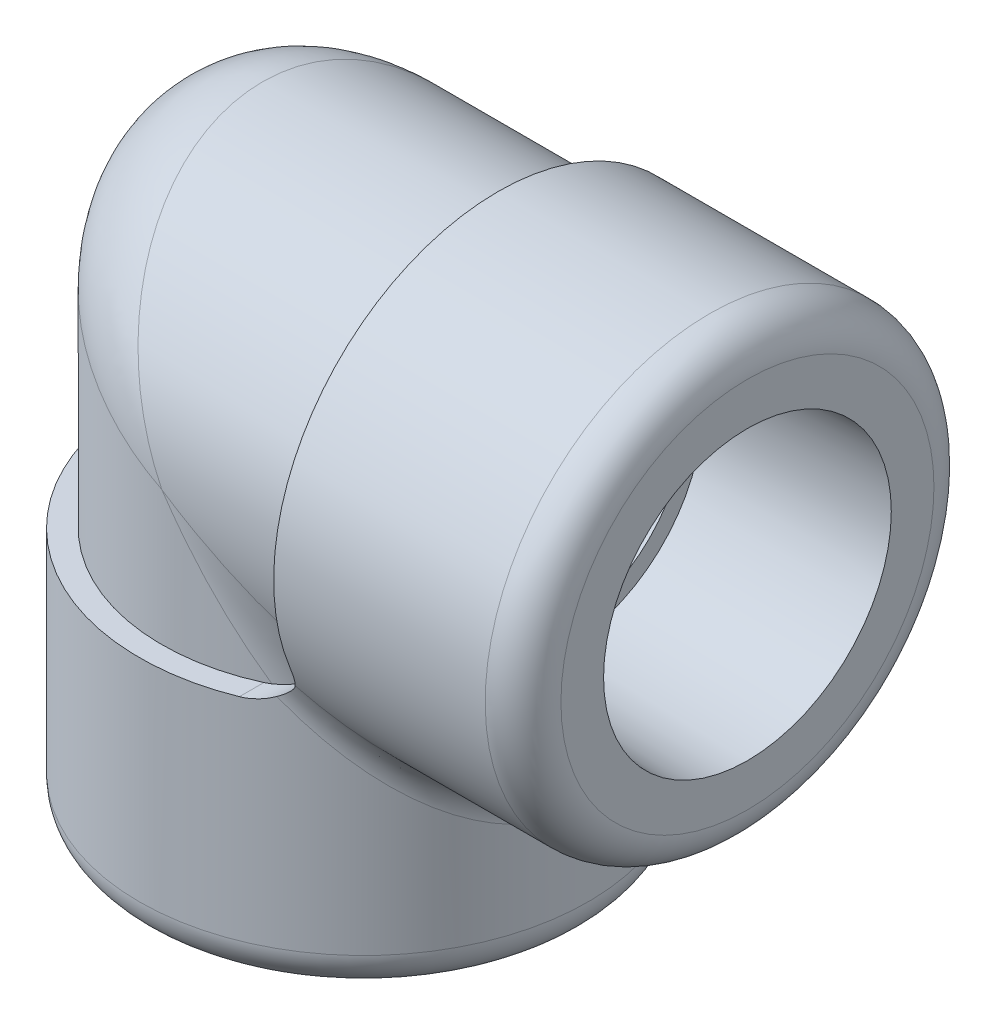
ISO-10303-21;
HEADER;
FILE_DESCRIPTION(('STEP AP214'),'2;1');
FILE_NAME('part.step','',(''),(''),'','','');
FILE_SCHEMA(('AUTOMOTIVE_DESIGN { 1 0 10303 214 1 1 1 1 }'));
ENDSEC;
DATA;
#1=APPLICATION_CONTEXT('core data for automotive mechanical design processes');
#2=APPLICATION_PROTOCOL_DEFINITION('international standard','automotive_design',2000,#1);
#3=PRODUCT_CONTEXT('',#1,'mechanical');
#4=PRODUCT('Part','Part','',(#3));
#5=PRODUCT_RELATED_PRODUCT_CATEGORY('part','',(#4));
#6=PRODUCT_DEFINITION_FORMATION('','',#4);
#7=PRODUCT_DEFINITION_CONTEXT('part definition',#1,'design');
#8=PRODUCT_DEFINITION('design','',#6,#7);
#9=PRODUCT_DEFINITION_SHAPE('','',#8);
#10=(LENGTH_UNIT() NAMED_UNIT(*) SI_UNIT(.MILLI.,.METRE.));
#11=(NAMED_UNIT(*) PLANE_ANGLE_UNIT() SI_UNIT($,.RADIAN.));
#12=(NAMED_UNIT(*) SI_UNIT($,.STERADIAN.) SOLID_ANGLE_UNIT());
#13=UNCERTAINTY_MEASURE_WITH_UNIT(LENGTH_MEASURE(1.E-05),#10,'distance_accuracy_value','');
#14=(GEOMETRIC_REPRESENTATION_CONTEXT(3) GLOBAL_UNCERTAINTY_ASSIGNED_CONTEXT((#13)) GLOBAL_UNIT_ASSIGNED_CONTEXT((#10,
#11,#12)) REPRESENTATION_CONTEXT('',''));
#15=CARTESIAN_POINT('',(0.,0.,0.));
#16=DIRECTION('',(0.,0.,1.));
#17=DIRECTION('',(1.,0.,0.));
#18=AXIS2_PLACEMENT_3D('',#15,#16,#17);
#19=CARTESIAN_POINT('',(0.,0.,0.));
#20=DIRECTION('',(1.,0.,0.));
#21=DIRECTION('',(0.,1.,0.));
#22=AXIS2_PLACEMENT_3D('',#19,#20,#21);
#23=CYLINDRICAL_SURFACE('',#22,14.9733);
#24=CARTESIAN_POINT('',(0.,0.,0.));
#25=DIRECTION('',(-0.554700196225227,-0.832050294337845,0.));
#26=DIRECTION('',(0.832050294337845,-0.554700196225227,0.));
#27=AXIS2_PLACEMENT_3D('',#24,#25,#26);
#28=ELLIPSE('',#27,26.9935004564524,14.9733);
#29=CARTESIAN_POINT('',(0.,0.,14.9733));
#30=VERTEX_POINT('',#29);
#31=CARTESIAN_POINT('',(9.93434279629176,-6.62289519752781,13.4289602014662));
#32=VERTEX_POINT('',#31);
#33=EDGE_CURVE('E141',#30,#32,#28,.F.);
#34=ORIENTED_EDGE('',*,*,#33,.T.);
#35=CARTESIAN_POINT('',(9.93434279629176,-6.62289519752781,13.4289602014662));
#36=CARTESIAN_POINT('',(9.94180093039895,-6.55531483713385,13.4622925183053));
#37=CARTESIAN_POINT('',(9.9474014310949,-6.48740630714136,13.4951479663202));
#38=CARTESIAN_POINT('',(9.95488716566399,-6.35093290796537,13.5599051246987));
#39=CARTESIAN_POINT('',(9.95677239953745,-6.28236803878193,13.5918068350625));
#40=CARTESIAN_POINT('',(9.9568,-6.21347500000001,13.6232316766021));
#41=B_SPLINE_CURVE_WITH_KNOTS('',3,(#35,#36,#37,#38,#39,#40),.UNSPECIFIED.,.F.,.F.,(4,2,4),(0.,
0.22693992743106,0.453879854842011),.UNSPECIFIED.);
#42=CARTESIAN_POINT('',(9.95679999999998,-6.21347500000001,13.6232316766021));
#43=VERTEX_POINT('',#42);
#44=EDGE_CURVE('E552',#32,#43,#41,.T.);
#45=ORIENTED_EDGE('',*,*,#44,.T.);
#46=CARTESIAN_POINT('',(9.9568,0.,0.));
#47=DIRECTION('',(1.,0.,0.));
#48=DIRECTION('',(0.,1.,0.));
#49=AXIS2_PLACEMENT_3D('',#46,#47,#48);
#50=CIRCLE('',#49,14.9733);
#51=CARTESIAN_POINT('',(9.95679999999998,-6.21347500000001,-13.6232316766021));
#52=VERTEX_POINT('',#51);
#53=EDGE_CURVE('E535',#43,#52,#50,.F.);
#54=ORIENTED_EDGE('',*,*,#53,.T.);
#55=CARTESIAN_POINT('',(9.95679999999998,-6.21347500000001,-13.6232316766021));
#56=CARTESIAN_POINT('',(9.95677239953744,-6.28236803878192,-13.5918068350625));
#57=CARTESIAN_POINT('',(9.95488716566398,-6.35093290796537,-13.5599051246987));
#58=CARTESIAN_POINT('',(9.94740143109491,-6.48740630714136,-13.4951479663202));
#59=CARTESIAN_POINT('',(9.94180093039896,-6.55531483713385,-13.4622925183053));
#60=CARTESIAN_POINT('',(9.93434279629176,-6.62289519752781,-13.4289602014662));
#61=B_SPLINE_CURVE_WITH_KNOTS('',3,(#55,#56,#57,#58,#59,#60),.UNSPECIFIED.,.F.,.F.,(4,2,4),(0.,
0.226939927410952,0.453879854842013),.UNSPECIFIED.);
#62=CARTESIAN_POINT('',(9.93434279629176,-6.62289519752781,-13.4289602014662));
#63=VERTEX_POINT('',#62);
#64=EDGE_CURVE('E120',#52,#63,#61,.T.);
#65=ORIENTED_EDGE('',*,*,#64,.T.);
#66=CARTESIAN_POINT('',(0.,0.,0.));
#67=DIRECTION('',(-0.554700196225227,-0.832050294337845,0.));
#68=DIRECTION('',(0.832050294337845,-0.554700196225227,0.));
#69=AXIS2_PLACEMENT_3D('',#66,#67,#68);
#70=ELLIPSE('',#69,26.9935004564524,14.9733);
#71=CARTESIAN_POINT('',(0.,0.,-14.9733));
#72=VERTEX_POINT('',#71);
#73=EDGE_CURVE('E113',#63,#72,#70,.F.);
#74=ORIENTED_EDGE('',*,*,#73,.T.);
#75=CARTESIAN_POINT('',(0.,0.,0.));
#76=DIRECTION('',(-0.894427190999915,-0.44721359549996,0.));
#77=DIRECTION('',(0.44721359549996,-0.894427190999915,0.));
#78=AXIS2_PLACEMENT_3D('',#75,#76,#77);
#79=ELLIPSE('',#78,16.7406583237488,14.9733);
#80=EDGE_CURVE('E117',#72,#30,#79,.F.);
#81=ORIENTED_EDGE('',*,*,#80,.T.);
#82=EDGE_LOOP('',(#34,#45,#54,#65,#74,#81));
#83=FACE_BOUND('',#82,.T.);
#84=ADVANCED_FACE('F33',(#83),#23,.T.);
#85=CARTESIAN_POINT('',(0.,-9.9568,0.));
#86=DIRECTION('',(0.,-1.,0.));
#87=DIRECTION('',(0.,0.,-1.));
#88=AXIS2_PLACEMENT_3D('',#85,#86,#87);
#89=CYLINDRICAL_SURFACE('',#88,16.637);
#90=CARTESIAN_POINT('',(0.,-25.64050625,0.));
#91=DIRECTION('',(0.,1.,0.));
#92=DIRECTION('',(0.,0.,1.));
#93=AXIS2_PLACEMENT_3D('',#90,#91,#92);
#94=CIRCLE('',#93,16.637);
#95=CARTESIAN_POINT('',(0.,-25.64050625,16.637));
#96=VERTEX_POINT('',#95);
#97=EDGE_CURVE('E241',#96,#96,#94,.T.);
#98=ORIENTED_EDGE('',*,*,#97,.T.);
#99=EDGE_LOOP('',(#98));
#100=FACE_BOUND('',#99,.T.);
#101=CARTESIAN_POINT('',(6.21347499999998,-9.9568,-15.4331622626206));
#102=CARTESIAN_POINT('',(6.32945788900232,-9.95680515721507,-15.3864812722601));
#103=CARTESIAN_POINT('',(6.44487631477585,-9.95141038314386,-15.3384799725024));
#104=CARTESIAN_POINT('',(6.67375118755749,-9.93016975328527,-15.2402820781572));
#105=CARTESIAN_POINT('',(6.78720840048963,-9.91432807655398,-15.1900863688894));
#106=CARTESIAN_POINT('',(7.01157895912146,-9.87251258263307,-15.0878353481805));
#107=CARTESIAN_POINT('',(7.12248851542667,-9.84652459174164,-15.0357775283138));
#108=CARTESIAN_POINT('',(7.34089633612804,-9.7847894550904,-14.9303629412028));
#109=CARTESIAN_POINT('',(7.44839438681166,-9.74904169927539,-14.8770060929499));
#110=CARTESIAN_POINT('',(7.7645162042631,-9.62780119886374,-14.7159010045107));
#111=CARTESIAN_POINT('',(7.96725965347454,-9.52821752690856,-14.6068922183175));
#112=CARTESIAN_POINT('',(8.35174427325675,-9.29418749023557,-14.3905074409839));
#113=CARTESIAN_POINT('',(8.53353944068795,-9.15983379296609,-14.2831279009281));
#114=CARTESIAN_POINT('',(8.7295858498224,-8.98529245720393,-14.1628074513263));
#115=CARTESIAN_POINT('',(8.75622026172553,-8.9608807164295,-14.1463543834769));
#116=CARTESIAN_POINT('',(8.80881451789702,-8.91125183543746,-14.1136638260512));
#117=CARTESIAN_POINT('',(8.83477489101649,-8.88603536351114,-14.0974261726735));
#118=CARTESIAN_POINT('',(8.86040549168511,-8.86040549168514,-14.0812990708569));
#119=B_SPLINE_CURVE_WITH_KNOTS('',3,(#101,#102,#103,#104,#105,#106,#107,#108,#109,#110,#111,
#112,#113,#114,#115,#116,#117,#118),.UNSPECIFIED.,.F.,.F.,(4,2,2,2,2,2,2,2,4),(0.,
0.374903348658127,0.749656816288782,1.1249356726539,1.50023799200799,2.24921433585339,
2.99621473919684,3.11530678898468,3.23430238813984),.UNSPECIFIED.);
#120=CARTESIAN_POINT('',(6.21347499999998,-9.9568,-15.4331622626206));
#121=VERTEX_POINT('',#120);
#122=CARTESIAN_POINT('',(8.08844935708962,-9.45337518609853,-14.5384578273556));
#123=VERTEX_POINT('',#122);
#124=EDGE_CURVE('E230',#121,#123,#119,.T.);
#125=ORIENTED_EDGE('',*,*,#124,.T.);
#126=CARTESIAN_POINT('',(0.,0.,0.));
#127=DIRECTION('',(0.759829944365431,0.650121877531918,0.));
#128=DIRECTION('',(0.650121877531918,-0.759829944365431,0.));
#129=AXIS2_PLACEMENT_3D('',#126,#127,#128);
#130=ELLIPSE('',#129,25.590586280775,16.637);
#131=CARTESIAN_POINT('',(8.08844935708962,-9.45337518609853,14.5384578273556));
#132=VERTEX_POINT('',#131);
#133=EDGE_CURVE('E507',#123,#132,#130,.F.);
#134=ORIENTED_EDGE('',*,*,#133,.T.);
#135=CARTESIAN_POINT('',(8.8604054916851,-8.86040549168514,14.0812990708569));
#136=CARTESIAN_POINT('',(8.77642303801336,-8.94437758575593,14.1341541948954));
#137=CARTESIAN_POINT('',(8.68884918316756,-9.02396923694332,14.1881997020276));
#138=CARTESIAN_POINT('',(8.50720763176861,-9.17407670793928,14.2978443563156));
#139=CARTESIAN_POINT('',(8.41314253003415,-9.24459612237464,14.3534428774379));
#140=CARTESIAN_POINT('',(8.22197444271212,-9.37438673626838,14.4637736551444));
#141=CARTESIAN_POINT('',(8.12504057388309,-9.43392642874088,14.5184837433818));
#142=CARTESIAN_POINT('',(7.92618360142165,-9.54394449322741,14.6279959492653));
#143=CARTESIAN_POINT('',(7.82425958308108,-9.59442119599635,14.6827980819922));
#144=CARTESIAN_POINT('',(7.60512948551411,-9.69076678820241,14.7975882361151));
#145=CARTESIAN_POINT('',(7.48743878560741,-9.73560466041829,14.8575204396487));
#146=CARTESIAN_POINT('',(7.24752664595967,-9.81335299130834,14.9760155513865));
#147=CARTESIAN_POINT('',(7.12530551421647,-9.84626425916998,15.0345785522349));
#148=CARTESIAN_POINT('',(6.87310528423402,-9.90055296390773,15.1515703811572));
#149=CARTESIAN_POINT('',(6.74300332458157,-9.92151174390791,15.2099303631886));
#150=CARTESIAN_POINT('',(6.48001299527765,-9.94964450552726,15.3238364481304));
#151=CARTESIAN_POINT('',(6.34712289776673,-9.95680966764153,15.3793807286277));
#152=CARTESIAN_POINT('',(6.21347499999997,-9.9568,15.4331622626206));
#153=B_SPLINE_CURVE_WITH_KNOTS('',3,(#135,#136,#137,#138,#139,#140,#141,#142,#143,#144,#145,
#146,#147,#148,#149,#150,#151,#152),.UNSPECIFIED.,.F.,.F.,(4,2,2,2,2,2,2,2,4),(0.,
0.3898133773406,0.779471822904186,1.15774279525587,1.53608336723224,1.95391764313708,
2.37172356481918,2.8033841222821,3.23532058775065),.UNSPECIFIED.);
#154=CARTESIAN_POINT('',(6.21347499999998,-9.9568,15.4331622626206));
#155=VERTEX_POINT('',#154);
#156=EDGE_CURVE('E259',#132,#155,#153,.T.);
#157=ORIENTED_EDGE('',*,*,#156,.T.);
#158=CARTESIAN_POINT('',(0.,-9.9568,0.));
#159=DIRECTION('',(0.,-1.,0.));
#160=DIRECTION('',(0.,0.,-1.));
#161=AXIS2_PLACEMENT_3D('',#158,#159,#160);
#162=CIRCLE('',#161,16.637);
#163=EDGE_CURVE('E520',#155,#121,#162,.T.);
#164=ORIENTED_EDGE('',*,*,#163,.T.);
#165=EDGE_LOOP('',(#125,#134,#157,#164));
#166=FACE_BOUND('',#165,.T.);
#167=ADVANCED_FACE('F263',(#100,#166),#89,.T.);
#168=CARTESIAN_POINT('',(0.,-9.9568,0.));
#169=DIRECTION('',(0.,-1.,0.));
#170=DIRECTION('',(0.,0.,-1.));
#171=AXIS2_PLACEMENT_3D('',#168,#169,#170);
#172=PLANE('',#171);
#173=ORIENTED_EDGE('',*,*,#163,.F.);
#174=DIRECTION('',(0.,0.,1.));
#175=VECTOR('',#174,1.);
#176=CARTESIAN_POINT('',(6.21347499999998,-9.9568,12.0759281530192));
#177=LINE('',#176,#175);
#178=CARTESIAN_POINT('',(6.21347499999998,-9.9568,13.6232316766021));
#179=VERTEX_POINT('',#178);
#180=EDGE_CURVE('E193',#155,#179,#177,.F.);
#181=ORIENTED_EDGE('',*,*,#180,.T.);
#182=CARTESIAN_POINT('',(0.,-9.9568,0.));
#183=DIRECTION('',(0.,-1.,0.));
#184=DIRECTION('',(0.,0.,-1.));
#185=AXIS2_PLACEMENT_3D('',#182,#183,#184);
#186=CIRCLE('',#185,14.9733);
#187=CARTESIAN_POINT('',(6.21347499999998,-9.9568,-13.6232316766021));
#188=VERTEX_POINT('',#187);
#189=EDGE_CURVE('E143',#179,#188,#186,.T.);
#190=ORIENTED_EDGE('',*,*,#189,.T.);
#191=DIRECTION('',(0.,0.,1.));
#192=VECTOR('',#191,1.);
#193=CARTESIAN_POINT('',(6.21347499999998,-9.9568,-13.3286121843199));
#194=LINE('',#193,#192);
#195=EDGE_CURVE('E545',#188,#121,#194,.F.);
#196=ORIENTED_EDGE('',*,*,#195,.T.);
#197=EDGE_LOOP('',(#173,#181,#190,#196));
#198=FACE_BOUND('',#197,.T.);
#199=ADVANCED_FACE('F170',(#198),#172,.F.);
#200=CARTESIAN_POINT('',(0.,42.3508878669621,0.));
#201=DIRECTION('',(0.,-1.,0.));
#202=DIRECTION('',(1.,0.,0.));
#203=AXIS2_PLACEMENT_3D('',#200,#201,#202);
#204=CYLINDRICAL_SURFACE('',#203,14.9733);
#205=ORIENTED_EDGE('',*,*,#189,.F.);
#206=CARTESIAN_POINT('',(6.21347499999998,-9.9568,13.6232316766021));
#207=CARTESIAN_POINT('',(6.28236803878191,-9.95677239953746,13.5918068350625));
#208=CARTESIAN_POINT('',(6.35093290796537,-9.954887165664,13.5599051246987));
#209=CARTESIAN_POINT('',(6.48740630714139,-9.94740143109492,13.4951479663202));
#210=CARTESIAN_POINT('',(6.5553148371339,-9.94180093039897,13.4622925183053));
#211=CARTESIAN_POINT('',(6.62289519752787,-9.93434279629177,13.4289602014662));
#212=B_SPLINE_CURVE_WITH_KNOTS('',3,(#206,#207,#208,#209,#210,#211),.UNSPECIFIED.,.F.,.F.,(4,2,
4),(0.,0.226939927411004,0.453879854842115),.UNSPECIFIED.);
#213=CARTESIAN_POINT('',(6.62289519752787,-9.93434279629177,13.4289602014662));
#214=VERTEX_POINT('',#213);
#215=EDGE_CURVE('E192',#179,#214,#212,.T.);
#216=ORIENTED_EDGE('',*,*,#215,.T.);
#217=CARTESIAN_POINT('',(0.,0.,0.));
#218=DIRECTION('',(-0.832050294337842,-0.554700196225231,0.));
#219=DIRECTION('',(0.554700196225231,-0.832050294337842,0.));
#220=AXIS2_PLACEMENT_3D('',#217,#218,#219);
#221=ELLIPSE('',#220,26.9935004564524,14.9733);
#222=EDGE_CURVE('E137',#214,#30,#221,.T.);
#223=ORIENTED_EDGE('',*,*,#222,.T.);
#224=CARTESIAN_POINT('',(0.,0.,0.));
#225=DIRECTION('',(-0.447213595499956,-0.894427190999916,0.));
#226=DIRECTION('',(0.894427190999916,-0.447213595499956,0.));
#227=AXIS2_PLACEMENT_3D('',#224,#225,#226);
#228=ELLIPSE('',#227,16.7406583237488,14.9733);
#229=EDGE_CURVE('E131',#30,#72,#228,.T.);
#230=ORIENTED_EDGE('',*,*,#229,.T.);
#231=CARTESIAN_POINT('',(0.,0.,0.));
#232=DIRECTION('',(-0.832050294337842,-0.554700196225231,0.));
#233=DIRECTION('',(0.554700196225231,-0.832050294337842,0.));
#234=AXIS2_PLACEMENT_3D('',#231,#232,#233);
#235=ELLIPSE('',#234,26.9935004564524,14.9733);
#236=CARTESIAN_POINT('',(6.62289519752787,-9.93434279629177,-13.4289602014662));
#237=VERTEX_POINT('',#236);
#238=EDGE_CURVE('E123',#72,#237,#235,.T.);
#239=ORIENTED_EDGE('',*,*,#238,.T.);
#240=CARTESIAN_POINT('',(6.62289519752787,-9.93434279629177,-13.4289602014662));
#241=CARTESIAN_POINT('',(6.5553148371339,-9.94180093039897,-13.4622925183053));
#242=CARTESIAN_POINT('',(6.48740630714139,-9.94740143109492,-13.4951479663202));
#243=CARTESIAN_POINT('',(6.35093290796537,-9.95488716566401,-13.5599051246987));
#244=CARTESIAN_POINT('',(6.28236803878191,-9.95677239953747,-13.5918068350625));
#245=CARTESIAN_POINT('',(6.21347499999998,-9.95680000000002,-13.6232316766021));
#246=B_SPLINE_CURVE_WITH_KNOTS('',3,(#240,#241,#242,#243,#244,#245),.UNSPECIFIED.,.F.,.F.,(4,2,
4),(0.,0.226939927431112,0.453879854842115),.UNSPECIFIED.);
#247=EDGE_CURVE('E186',#237,#188,#246,.T.);
#248=ORIENTED_EDGE('',*,*,#247,.T.);
#249=EDGE_LOOP('',(#205,#216,#223,#230,#239,#248));
#250=FACE_BOUND('',#249,.T.);
#251=ADVANCED_FACE('F135',(#250),#204,.T.);
#252=CARTESIAN_POINT('',(0.,0.,0.));
#253=DIRECTION('',(1.,0.,0.));
#254=DIRECTION('',(0.,1.,0.));
#255=AXIS2_PLACEMENT_3D('',#252,#253,#254);
#256=CYLINDRICAL_SURFACE('',#255,8.9281);
#257=CARTESIAN_POINT('',(0.,0.,0.));
#258=DIRECTION('',(0.894427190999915,0.44721359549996,0.));
#259=DIRECTION('',(0.44721359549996,-0.894427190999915,0.));
#260=AXIS2_PLACEMENT_3D('',#257,#258,#259);
#261=ELLIPSE('',#260,9.98191925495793,8.9281);
#262=CARTESIAN_POINT('',(0.,0.,8.9281));
#263=VERTEX_POINT('',#262);
#264=CARTESIAN_POINT('',(0.,0.,-8.9281));
#265=VERTEX_POINT('',#264);
#266=EDGE_CURVE('E46',#263,#265,#261,.F.);
#267=ORIENTED_EDGE('',*,*,#266,.T.);
#268=CARTESIAN_POINT('',(0.,0.,0.));
#269=DIRECTION('',(0.554700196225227,0.832050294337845,0.));
#270=DIRECTION('',(0.832050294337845,-0.554700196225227,0.));
#271=AXIS2_PLACEMENT_3D('',#268,#269,#270);
#272=ELLIPSE('',#271,16.095361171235,8.9281);
#273=EDGE_CURVE('E12',#265,#263,#272,.F.);
#274=ORIENTED_EDGE('',*,*,#273,.T.);
#275=EDGE_LOOP('',(#267,#274));
#276=FACE_BOUND('',#275,.T.);
#277=CARTESIAN_POINT('',(14.87678,0.,0.));
#278=DIRECTION('',(-1.,0.,0.));
#279=DIRECTION('',(0.,-1.,0.));
#280=AXIS2_PLACEMENT_3D('',#277,#278,#279);
#281=CIRCLE('',#280,8.92809999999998);
#282=CARTESIAN_POINT('',(14.87678,-8.92810000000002,0.));
#283=VERTEX_POINT('',#282);
#284=EDGE_CURVE('E566',#283,#283,#281,.T.);
#285=ORIENTED_EDGE('',*,*,#284,.F.);
#286=EDGE_LOOP('',(#285));
#287=FACE_BOUND('',#286,.T.);
#288=ADVANCED_FACE('F169',(#276,#287),#256,.F.);
#289=CARTESIAN_POINT('',(0.,42.3508878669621,0.));
#290=DIRECTION('',(0.,-1.,0.));
#291=DIRECTION('',(1.,0.,0.));
#292=AXIS2_PLACEMENT_3D('',#289,#290,#291);
#293=CYLINDRICAL_SURFACE('',#292,8.9281);
#294=CARTESIAN_POINT('',(0.,0.,0.));
#295=DIRECTION('',(0.832050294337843,0.554700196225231,0.));
#296=DIRECTION('',(0.554700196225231,-0.832050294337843,0.));
#297=AXIS2_PLACEMENT_3D('',#294,#295,#296);
#298=ELLIPSE('',#297,16.095361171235,8.9281);
#299=EDGE_CURVE('E485',#263,#265,#298,.T.);
#300=ORIENTED_EDGE('',*,*,#299,.T.);
#301=CARTESIAN_POINT('',(0.,0.,0.));
#302=DIRECTION('',(0.447213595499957,0.894427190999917,0.));
#303=DIRECTION('',(0.894427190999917,-0.447213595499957,0.));
#304=AXIS2_PLACEMENT_3D('',#301,#302,#303);
#305=ELLIPSE('',#304,9.98191925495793,8.9281);
#306=EDGE_CURVE('E482',#265,#263,#305,.T.);
#307=ORIENTED_EDGE('',*,*,#306,.T.);
#308=EDGE_LOOP('',(#300,#307));
#309=FACE_BOUND('',#308,.T.);
#310=CARTESIAN_POINT('',(0.,-14.87678,0.));
#311=DIRECTION('',(0.,-1.,0.));
#312=DIRECTION('',(1.,0.,0.));
#313=AXIS2_PLACEMENT_3D('',#310,#311,#312);
#314=CIRCLE('',#313,8.92809999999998);
#315=CARTESIAN_POINT('',(8.92809999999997,-14.87678,0.));
#316=VERTEX_POINT('',#315);
#317=EDGE_CURVE('E536',#316,#316,#314,.T.);
#318=ORIENTED_EDGE('',*,*,#317,.T.);
#319=EDGE_LOOP('',(#318));
#320=FACE_BOUND('',#319,.T.);
#321=ADVANCED_FACE('F171',(#309,#320),#293,.F.);
#322=CARTESIAN_POINT('',(0.,-28.448,0.));
#323=DIRECTION('',(0.,1.,0.));
#324=DIRECTION('',(0.,0.,1.));
#325=AXIS2_PLACEMENT_3D('',#322,#323,#324);
#326=PLANE('',#325);
#327=CARTESIAN_POINT('',(0.,-28.448,0.));
#328=DIRECTION('',(0.,1.,0.));
#329=DIRECTION('',(0.,0.,1.));
#330=AXIS2_PLACEMENT_3D('',#327,#328,#329);
#331=CIRCLE('',#330,13.82950625);
#332=CARTESIAN_POINT('',(0.,-28.448,13.82950625));
#333=VERTEX_POINT('',#332);
#334=EDGE_CURVE('E501',#333,#333,#331,.F.);
#335=ORIENTED_EDGE('',*,*,#334,.T.);
#336=EDGE_LOOP('',(#335));
#337=FACE_BOUND('',#336,.T.);
#338=CARTESIAN_POINT('',(0.,-28.448,0.));
#339=DIRECTION('',(0.,-1.,0.));
#340=DIRECTION('',(1.,0.,0.));
#341=AXIS2_PLACEMENT_3D('',#338,#339,#340);
#342=CIRCLE('',#341,10.668);
#343=CARTESIAN_POINT('',(10.668,-28.448,0.));
#344=VERTEX_POINT('',#343);
#345=EDGE_CURVE('E563',#344,#344,#342,.T.);
#346=ORIENTED_EDGE('',*,*,#345,.F.);
#347=EDGE_LOOP('',(#346));
#348=FACE_BOUND('',#347,.T.);
#349=ADVANCED_FACE('F272',(#337,#348),#326,.F.);
#350=CARTESIAN_POINT('',(28.448,1.11022302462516E-13,0.));
#351=DIRECTION('',(1.,0.,0.));
#352=DIRECTION('',(0.,1.,0.));
#353=AXIS2_PLACEMENT_3D('',#350,#351,#352);
#354=PLANE('',#353);
#355=CARTESIAN_POINT('',(28.448,0.,0.));
#356=DIRECTION('',(1.,0.,0.));
#357=DIRECTION('',(0.,1.,0.));
#358=AXIS2_PLACEMENT_3D('',#355,#356,#357);
#359=CIRCLE('',#358,13.82950625);
#360=CARTESIAN_POINT('',(28.448,13.8295062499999,0.));
#361=VERTEX_POINT('',#360);
#362=EDGE_CURVE('E498',#361,#361,#359,.T.);
#363=ORIENTED_EDGE('',*,*,#362,.T.);
#364=EDGE_LOOP('',(#363));
#365=FACE_BOUND('',#364,.T.);
#366=CARTESIAN_POINT('',(28.448,0.,0.));
#367=DIRECTION('',(-1.,0.,0.));
#368=DIRECTION('',(0.,-1.,0.));
#369=AXIS2_PLACEMENT_3D('',#366,#367,#368);
#370=CIRCLE('',#369,10.668);
#371=CARTESIAN_POINT('',(28.448,-10.6680000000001,0.));
#372=VERTEX_POINT('',#371);
#373=EDGE_CURVE('E572',#372,#372,#370,.T.);
#374=ORIENTED_EDGE('',*,*,#373,.T.);
#375=EDGE_LOOP('',(#374));
#376=FACE_BOUND('',#375,.T.);
#377=ADVANCED_FACE('F268',(#365,#376),#354,.T.);
#378=CARTESIAN_POINT('',(9.9568,0.,0.));
#379=DIRECTION('',(1.,0.,0.));
#380=DIRECTION('',(0.,0.,-1.));
#381=AXIS2_PLACEMENT_3D('',#378,#379,#380);
#382=PLANE('',#381);
#383=ORIENTED_EDGE('',*,*,#53,.F.);
#384=DIRECTION('',(0.,0.,1.));
#385=VECTOR('',#384,1.);
#386=CARTESIAN_POINT('',(9.95679999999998,-6.21347500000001,13.3286121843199));
#387=LINE('',#386,#385);
#388=CARTESIAN_POINT('',(9.95679999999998,-6.21347500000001,15.4331622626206));
#389=VERTEX_POINT('',#388);
#390=EDGE_CURVE('E546',#43,#389,#387,.T.);
#391=ORIENTED_EDGE('',*,*,#390,.T.);
#392=CARTESIAN_POINT('',(9.9568,0.,0.));
#393=DIRECTION('',(-1.,0.,0.));
#394=DIRECTION('',(0.,0.,-1.));
#395=AXIS2_PLACEMENT_3D('',#392,#393,#394);
#396=CIRCLE('',#395,16.637);
#397=CARTESIAN_POINT('',(9.95679999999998,-6.21347500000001,-15.4331622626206));
#398=VERTEX_POINT('',#397);
#399=EDGE_CURVE('E532',#389,#398,#396,.T.);
#400=ORIENTED_EDGE('',*,*,#399,.T.);
#401=DIRECTION('',(0.,0.,1.));
#402=VECTOR('',#401,1.);
#403=CARTESIAN_POINT('',(9.95679999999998,-6.21347500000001,-12.0759281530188));
#404=LINE('',#403,#402);
#405=EDGE_CURVE('E148',#398,#52,#404,.T.);
#406=ORIENTED_EDGE('',*,*,#405,.T.);
#407=EDGE_LOOP('',(#383,#391,#400,#406));
#408=FACE_BOUND('',#407,.T.);
#409=ADVANCED_FACE('F249',(#408),#382,.F.);
#410=CARTESIAN_POINT('',(9.9568,0.,0.));
#411=DIRECTION('',(1.,0.,0.));
#412=DIRECTION('',(0.,1.,0.));
#413=AXIS2_PLACEMENT_3D('',#410,#411,#412);
#414=CYLINDRICAL_SURFACE('',#413,16.637);
#415=CARTESIAN_POINT('',(25.64050625,0.,0.));
#416=DIRECTION('',(1.,0.,0.));
#417=DIRECTION('',(0.,1.,0.));
#418=AXIS2_PLACEMENT_3D('',#415,#416,#417);
#419=CIRCLE('',#418,16.637);
#420=CARTESIAN_POINT('',(25.6405062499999,16.6369999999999,0.));
#421=VERTEX_POINT('',#420);
#422=EDGE_CURVE('E505',#421,#421,#419,.F.);
#423=ORIENTED_EDGE('',*,*,#422,.T.);
#424=EDGE_LOOP('',(#423));
#425=FACE_BOUND('',#424,.T.);
#426=CARTESIAN_POINT('',(9.95679999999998,-6.21347500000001,15.4331622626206));
#427=CARTESIAN_POINT('',(9.95680515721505,-6.32945788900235,15.3864812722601));
#428=CARTESIAN_POINT('',(9.95141038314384,-6.44487631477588,15.3384799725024));
#429=CARTESIAN_POINT('',(9.93016975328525,-6.67375118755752,15.2402820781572));
#430=CARTESIAN_POINT('',(9.91432807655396,-6.78720840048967,15.1900863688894));
#431=CARTESIAN_POINT('',(9.87251258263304,-7.01157895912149,15.0878353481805));
#432=CARTESIAN_POINT('',(9.84652459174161,-7.1224885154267,15.0357775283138));
#433=CARTESIAN_POINT('',(9.78478945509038,-7.34089633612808,14.9303629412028));
#434=CARTESIAN_POINT('',(9.74904169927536,-7.44839438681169,14.8770060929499));
#435=CARTESIAN_POINT('',(9.62780119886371,-7.76451620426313,14.7159010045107));
#436=CARTESIAN_POINT('',(9.52821752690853,-7.96725965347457,14.6068922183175));
#437=CARTESIAN_POINT('',(9.29418749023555,-8.35174427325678,14.3905074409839));
#438=CARTESIAN_POINT('',(9.15983379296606,-8.53353944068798,14.2831279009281));
#439=CARTESIAN_POINT('',(8.9852924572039,-8.72958584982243,14.1628074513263));
#440=CARTESIAN_POINT('',(8.96088071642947,-8.75622026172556,14.1463543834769));
#441=CARTESIAN_POINT('',(8.91125183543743,-8.80881451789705,14.1136638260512));
#442=CARTESIAN_POINT('',(8.8860353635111,-8.83477489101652,14.0974261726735));
#443=CARTESIAN_POINT('',(8.86040549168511,-8.86040549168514,14.0812990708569));
#444=B_SPLINE_CURVE_WITH_KNOTS('',3,(#426,#427,#428,#429,#430,#431,#432,#433,#434,#435,#436,
#437,#438,#439,#440,#441,#442,#443),.UNSPECIFIED.,.F.,.F.,(4,2,2,2,2,2,2,2,4),(0.,
0.374903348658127,0.749656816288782,1.1249356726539,1.50023799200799,2.24921433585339,
2.99621473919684,3.11530678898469,3.23430238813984),.UNSPECIFIED.);
#445=CARTESIAN_POINT('',(9.4533751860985,-8.08844935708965,14.5384578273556));
#446=VERTEX_POINT('',#445);
#447=EDGE_CURVE('E254',#389,#446,#444,.T.);
#448=ORIENTED_EDGE('',*,*,#447,.T.);
#449=CARTESIAN_POINT('',(0.,0.,0.));
#450=DIRECTION('',(0.65012187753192,0.759829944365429,0.));
#451=DIRECTION('',(0.759829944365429,-0.65012187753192,0.));
#452=AXIS2_PLACEMENT_3D('',#449,#450,#451);
#453=ELLIPSE('',#452,25.590586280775,16.637);
#454=CARTESIAN_POINT('',(9.4533751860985,-8.08844935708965,-14.5384578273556));
#455=VERTEX_POINT('',#454);
#456=EDGE_CURVE('E503',#446,#455,#453,.T.);
#457=ORIENTED_EDGE('',*,*,#456,.T.);
#458=CARTESIAN_POINT('',(8.8604054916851,-8.86040549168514,-14.0812990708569));
#459=CARTESIAN_POINT('',(8.9443775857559,-8.77642303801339,-14.1341541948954));
#460=CARTESIAN_POINT('',(9.02396923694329,-8.6888491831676,-14.1881997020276));
#461=CARTESIAN_POINT('',(9.17407670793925,-8.50720763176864,-14.2978443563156));
#462=CARTESIAN_POINT('',(9.24459612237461,-8.41314253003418,-14.3534428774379));
#463=CARTESIAN_POINT('',(9.37438673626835,-8.22197444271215,-14.4637736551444));
#464=CARTESIAN_POINT('',(9.43392642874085,-8.12504057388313,-14.5184837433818));
#465=CARTESIAN_POINT('',(9.54394449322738,-7.92618360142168,-14.6279959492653));
#466=CARTESIAN_POINT('',(9.59442119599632,-7.82425958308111,-14.6827980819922));
#467=CARTESIAN_POINT('',(9.69076678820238,-7.60512948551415,-14.7975882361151));
#468=CARTESIAN_POINT('',(9.73560466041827,-7.48743878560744,-14.8575204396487));
#469=CARTESIAN_POINT('',(9.81335299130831,-7.2475266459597,-14.9760155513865));
#470=CARTESIAN_POINT('',(9.84626425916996,-7.12530551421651,-15.0345785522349));
#471=CARTESIAN_POINT('',(9.90055296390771,-6.87310528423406,-15.1515703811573));
#472=CARTESIAN_POINT('',(9.92151174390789,-6.74300332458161,-15.2099303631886));
#473=CARTESIAN_POINT('',(9.94964450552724,-6.48001299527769,-15.3238364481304));
#474=CARTESIAN_POINT('',(9.95680966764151,-6.34712289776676,-15.3793807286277));
#475=CARTESIAN_POINT('',(9.95679999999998,-6.21347500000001,-15.4331622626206));
#476=B_SPLINE_CURVE_WITH_KNOTS('',3,(#458,#459,#460,#461,#462,#463,#464,#465,#466,#467,#468,
#469,#470,#471,#472,#473,#474,#475),.UNSPECIFIED.,.F.,.F.,(4,2,2,2,2,2,2,2,4),(0.,
0.3898133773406,0.779471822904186,1.15774279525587,1.53608336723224,1.95391764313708,
2.37172356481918,2.8033841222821,3.23532058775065),.UNSPECIFIED.);
#477=EDGE_CURVE('E236',#455,#398,#476,.T.);
#478=ORIENTED_EDGE('',*,*,#477,.T.);
#479=ORIENTED_EDGE('',*,*,#399,.F.);
#480=EDGE_LOOP('',(#448,#457,#478,#479));
#481=FACE_BOUND('',#480,.T.);
#482=ADVANCED_FACE('F243',(#425,#481),#414,.T.);
#483=CARTESIAN_POINT('',(8.92809999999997,-14.87678,0.));
#484=DIRECTION('',(0.,1.,0.));
#485=DIRECTION('',(-1.,0.,0.));
#486=AXIS2_PLACEMENT_3D('',#483,#484,#485);
#487=PLANE('',#486);
#488=ORIENTED_EDGE('',*,*,#317,.F.);
#489=EDGE_LOOP('',(#488));
#490=FACE_BOUND('',#489,.T.);
#491=CARTESIAN_POINT('',(0.,-14.87678,0.));
#492=DIRECTION('',(0.,-1.,0.));
#493=DIRECTION('',(1.,0.,0.));
#494=AXIS2_PLACEMENT_3D('',#491,#492,#493);
#495=CIRCLE('',#494,10.2581033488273);
#496=CARTESIAN_POINT('',(10.2581033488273,-14.87678,0.));
#497=VERTEX_POINT('',#496);
#498=EDGE_CURVE('E540',#497,#497,#495,.T.);
#499=ORIENTED_EDGE('',*,*,#498,.T.);
#500=EDGE_LOOP('',(#499));
#501=FACE_BOUND('',#500,.T.);
#502=ADVANCED_FACE('F248',(#490,#501),#487,.F.);
#503=CARTESIAN_POINT('',(0.,-28.448,0.));
#504=DIRECTION('',(0.,-1.,0.));
#505=DIRECTION('',(1.,0.,0.));
#506=AXIS2_PLACEMENT_3D('',#503,#504,#505);
#507=CONICAL_SURFACE('',#506,10.668,0.030194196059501);
#508=ORIENTED_EDGE('',*,*,#498,.F.);
#509=EDGE_LOOP('',(#508));
#510=FACE_BOUND('',#509,.T.);
#511=ORIENTED_EDGE('',*,*,#345,.T.);
#512=EDGE_LOOP('',(#511));
#513=FACE_BOUND('',#512,.T.);
#514=ADVANCED_FACE('F376',(#510,#513),#507,.F.);
#515=CARTESIAN_POINT('',(14.87678,-8.92810000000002,0.));
#516=DIRECTION('',(-1.,0.,0.));
#517=DIRECTION('',(0.,1.,0.));
#518=AXIS2_PLACEMENT_3D('',#515,#516,#517);
#519=PLANE('',#518);
#520=ORIENTED_EDGE('',*,*,#284,.T.);
#521=EDGE_LOOP('',(#520));
#522=FACE_BOUND('',#521,.T.);
#523=CARTESIAN_POINT('',(14.87678,0.,0.));
#524=DIRECTION('',(-1.,0.,0.));
#525=DIRECTION('',(0.,-1.,0.));
#526=AXIS2_PLACEMENT_3D('',#523,#524,#525);
#527=CIRCLE('',#526,10.2581033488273);
#528=CARTESIAN_POINT('',(14.87678,-10.2581033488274,0.));
#529=VERTEX_POINT('',#528);
#530=EDGE_CURVE('E569',#529,#529,#527,.T.);
#531=ORIENTED_EDGE('',*,*,#530,.F.);
#532=EDGE_LOOP('',(#531));
#533=FACE_BOUND('',#532,.T.);
#534=ADVANCED_FACE('F367',(#522,#533),#519,.F.);
#535=CARTESIAN_POINT('',(28.448,0.,0.));
#536=DIRECTION('',(1.,0.,0.));
#537=DIRECTION('',(0.,-1.,0.));
#538=AXIS2_PLACEMENT_3D('',#535,#536,#537);
#539=CONICAL_SURFACE('',#538,10.668,0.030194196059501);
#540=ORIENTED_EDGE('',*,*,#530,.T.);
#541=EDGE_LOOP('',(#540));
#542=FACE_BOUND('',#541,.T.);
#543=ORIENTED_EDGE('',*,*,#373,.F.);
#544=EDGE_LOOP('',(#543));
#545=FACE_BOUND('',#544,.T.);
#546=ADVANCED_FACE('F161',(#542,#545),#539,.F.);
#547=CARTESIAN_POINT('',(0.,0.,14.9733));
#548=CARTESIAN_POINT('',(0.,0.,14.9733));
#549=CARTESIAN_POINT('',(0.,0.,14.9733));
#550=CARTESIAN_POINT('',(0.489280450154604,-0.326186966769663,14.9732831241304));
#551=CARTESIAN_POINT('',(0.407737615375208,-0.407737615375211,14.9733715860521));
#552=CARTESIAN_POINT('',(0.326186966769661,-0.489280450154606,14.9732831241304));
#553=CARTESIAN_POINT('',(0.978563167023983,-0.652375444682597,14.9626403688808));
#554=CARTESIAN_POINT('',(0.815760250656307,-0.815760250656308,14.9573076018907));
#555=CARTESIAN_POINT('',(0.652375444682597,-0.978563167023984,14.9626403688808));
#556=CARTESIAN_POINT('',(1.95611888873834,-1.30407925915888,14.9199822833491));
#557=CARTESIAN_POINT('',(1.62934171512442,-1.62934171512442,14.8933150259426));
#558=CARTESIAN_POINT('',(1.30407925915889,-1.95611888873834,14.9199822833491));
#559=CARTESIAN_POINT('',(2.44439180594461,-1.62959453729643,14.8879651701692));
#560=CARTESIAN_POINT('',(2.0354768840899,-2.03547688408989,14.8452926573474));
#561=CARTESIAN_POINT('',(1.62959453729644,-2.4443918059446,14.8879651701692));
#562=CARTESIAN_POINT('',(3.41468013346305,-2.27645342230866,14.802801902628));
#563=CARTESIAN_POINT('',(2.83984882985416,-2.83984882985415,14.7179278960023));
#564=CARTESIAN_POINT('',(2.27645342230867,-3.41468013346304,14.802801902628));
#565=CARTESIAN_POINT('',(3.89671341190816,-2.59780894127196,14.7498381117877));
#566=CARTESIAN_POINT('',(3.23868560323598,-3.23868560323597,14.6386756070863));
#567=CARTESIAN_POINT('',(2.59780894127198,-3.89671341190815,14.7498381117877));
#568=CARTESIAN_POINT('',(4.85754610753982,-3.23836407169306,14.6225628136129));
#569=CARTESIAN_POINT('',(4.0299678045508,-4.02996780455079,14.449028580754));
#570=CARTESIAN_POINT('',(3.23836407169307,-4.85754610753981,14.6225628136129));
#571=CARTESIAN_POINT('',(5.33634559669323,-3.55756373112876,14.5482517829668));
#572=CARTESIAN_POINT('',(4.42294164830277,-4.42294164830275,14.3383684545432));
#573=CARTESIAN_POINT('',(3.55756373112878,-5.33634559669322,14.5482517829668));
#574=CARTESIAN_POINT('',(6.75025490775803,-4.50016993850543,14.2956892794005));
#575=CARTESIAN_POINT('',(5.5793014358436,-5.57930143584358,13.9629317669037));
#576=CARTESIAN_POINT('',(4.50016993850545,-6.75025490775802,14.2956892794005));
#577=CARTESIAN_POINT('',(7.67939927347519,-5.11959951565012,14.0863723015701));
#578=CARTESIAN_POINT('',(6.33045662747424,-6.33045662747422,13.6524486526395));
#579=CARTESIAN_POINT('',(5.11959951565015,-7.67939927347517,14.0863723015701));
#580=CARTESIAN_POINT('',(9.48814572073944,-6.32543048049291,13.586907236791));
#581=CARTESIAN_POINT('',(7.76231232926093,-7.7623123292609,12.9246617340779));
#582=CARTESIAN_POINT('',(6.32543048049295,-9.48814572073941,13.586907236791));
#583=CARTESIAN_POINT('',(10.3684043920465,-6.91226959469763,13.2988773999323));
#584=CARTESIAN_POINT('',(8.44743248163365,-8.44743248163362,12.506289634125));
#585=CARTESIAN_POINT('',(6.91226959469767,-10.3684043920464,13.2988773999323));
#586=CARTESIAN_POINT('',(12.0641217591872,-8.04274783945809,12.6461944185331));
#587=CARTESIAN_POINT('',(9.72753317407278,-9.72753317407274,11.5807491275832));
#588=CARTESIAN_POINT('',(8.04274783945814,-12.0641217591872,12.6461944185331));
#589=CARTESIAN_POINT('',(12.8807512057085,-8.58716747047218,12.2842720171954));
#590=CARTESIAN_POINT('',(10.3266642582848,-10.3266642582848,11.0722236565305));
#591=CARTESIAN_POINT('',(8.58716747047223,-12.8807512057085,12.2842720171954));
#592=CARTESIAN_POINT('',(14.4346604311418,-9.62310695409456,11.4893563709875));
#593=CARTESIAN_POINT('',(11.4176533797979,-11.4176533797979,9.99120943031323));
#594=CARTESIAN_POINT('',(9.62310695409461,-14.4346604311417,11.4893563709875));
#595=CARTESIAN_POINT('',(15.1737761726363,-10.1158507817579,11.0595857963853));
#596=CARTESIAN_POINT('',(11.9132297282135,-11.9132297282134,9.41720524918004));
#597=CARTESIAN_POINT('',(10.1158507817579,-15.1737761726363,11.0595857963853));
#598=CARTESIAN_POINT('',(16.559235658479,-11.0394904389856,10.1359605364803));
#599=CARTESIAN_POINT('',(12.7851493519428,-12.7851493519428,8.23752915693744));
#600=CARTESIAN_POINT('',(11.0394904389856,-16.5592356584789,10.1359605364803));
#601=CARTESIAN_POINT('',(17.2081902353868,-11.4721268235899,9.64561597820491));
#602=CARTESIAN_POINT('',(13.1645838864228,-13.1645838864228,7.63042853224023));
#603=CARTESIAN_POINT('',(11.4721268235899,-17.2081902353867,9.64561597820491));
#604=CARTESIAN_POINT('',(18.4017223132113,-12.2678148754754,8.60856165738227));
#605=CARTESIAN_POINT('',(13.8007695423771,-13.800769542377,6.42318907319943));
#606=CARTESIAN_POINT('',(12.2678148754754,-18.4017223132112,8.60856165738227));
#607=CARTESIAN_POINT('',(18.9496802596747,-12.6331201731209,8.06537605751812));
#608=CARTESIAN_POINT('',(14.0598311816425,-14.0598311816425,5.82205610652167));
#609=CARTESIAN_POINT('',(12.6331201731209,-18.9496802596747,8.06537605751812));
#610=CARTESIAN_POINT('',(19.6906558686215,-13.1271039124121,7.20979765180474));
#611=CARTESIAN_POINT('',(14.3638956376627,-14.3638956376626,4.95611942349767));
#612=CARTESIAN_POINT('',(13.1271039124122,-19.6906558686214,7.20979765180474));
#613=CARTESIAN_POINT('',(19.9197255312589,-13.2798170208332,6.92481188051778));
#614=CARTESIAN_POINT('',(14.450620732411,-14.4506207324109,4.67640495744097));
#615=CARTESIAN_POINT('',(13.2798170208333,-19.9197255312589,6.92481188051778));
#616=CARTESIAN_POINT('',(20.3537800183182,-13.5691866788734,6.33904321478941));
#617=CARTESIAN_POINT('',(14.6011206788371,-14.601120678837,4.1268433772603));
#618=CARTESIAN_POINT('',(13.5691866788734,-20.3537800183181,6.33904321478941));
#619=CARTESIAN_POINT('',(20.5587755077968,-13.7058503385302,6.03826740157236));
#620=CARTESIAN_POINT('',(14.664507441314,-14.6645074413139,3.85736067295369));
#621=CARTESIAN_POINT('',(13.7058503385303,-20.5587755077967,6.03826740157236));
#622=CARTESIAN_POINT('',(20.9343302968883,-13.9562201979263,5.43382366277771));
#623=CARTESIAN_POINT('',(14.7682669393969,-14.7682669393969,3.34334037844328));
#624=CARTESIAN_POINT('',(13.9562201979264,-20.9343302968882,5.43382366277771));
#625=CARTESIAN_POINT('',(21.1059209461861,-14.0706139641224,5.13072620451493));
#626=CARTESIAN_POINT('',(14.8091421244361,-14.809142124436,3.09859629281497));
#627=CARTESIAN_POINT('',(14.0706139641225,-21.1059209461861,5.13072620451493));
#628=CARTESIAN_POINT('',(21.4215675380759,-14.2810450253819,4.51200598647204));
#629=CARTESIAN_POINT('',(14.8746211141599,-14.8746211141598,2.62577995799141));
#630=CARTESIAN_POINT('',(14.2810450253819,-21.4215675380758,4.51200598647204));
#631=CARTESIAN_POINT('',(21.5656249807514,-14.377083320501,4.19638391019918));
#632=CARTESIAN_POINT('',(14.8989738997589,-14.8989738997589,2.39829614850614));
#633=CARTESIAN_POINT('',(14.3770833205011,-21.5656249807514,4.19638391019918));
#634=CARTESIAN_POINT('',(21.8198129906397,-14.5465419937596,3.56395429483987));
#635=CARTESIAN_POINT('',(14.9348781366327,-14.9348781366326,1.9680041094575));
#636=CARTESIAN_POINT('',(14.5465419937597,-21.8198129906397,3.56395429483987));
#637=CARTESIAN_POINT('',(21.9308283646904,-14.6205522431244,3.24746372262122));
#638=CARTESIAN_POINT('',(14.9466407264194,-14.9466407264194,1.76519800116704));
#639=CARTESIAN_POINT('',(14.6205522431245,-21.9308283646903,3.24746372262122));
#640=CARTESIAN_POINT('',(22.1224950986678,-14.7483300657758,2.60639000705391));
#641=CARTESIAN_POINT('',(14.9627627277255,-14.9627627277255,1.37560785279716));
#642=CARTESIAN_POINT('',(14.7483300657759,-22.1224950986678,2.60639000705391));
#643=CARTESIAN_POINT('',(22.2031478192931,-14.8020985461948,2.28180722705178));
#644=CARTESIAN_POINT('',(14.9670432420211,-14.9670432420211,1.18941496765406));
#645=CARTESIAN_POINT('',(14.8020985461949,-22.203147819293,2.28180722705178));
#646=CARTESIAN_POINT('',(22.3314017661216,-14.8876011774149,1.63234798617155));
#647=CARTESIAN_POINT('',(14.9720145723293,-14.9720145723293,0.832413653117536));
#648=CARTESIAN_POINT('',(14.887601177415,-22.3314017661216,1.63234798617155));
#649=CARTESIAN_POINT('',(22.3795205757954,-14.9196803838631,1.30756264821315));
#650=CARTESIAN_POINT('',(14.972737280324,-14.972737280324,0.661921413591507));
#651=CARTESIAN_POINT('',(14.9196803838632,-22.3795205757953,1.30756264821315));
#652=CARTESIAN_POINT('',(22.4437944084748,-14.9625296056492,0.65518484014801));
#653=CARTESIAN_POINT('',(14.9733815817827,-14.9733815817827,0.327372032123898));
#654=CARTESIAN_POINT('',(14.9625296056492,-22.4437944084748,0.65518484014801));
#655=CARTESIAN_POINT('',(22.45995,-14.9732999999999,0.327592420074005));
#656=CARTESIAN_POINT('',(14.9733,-14.9732999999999,0.16380401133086));
#657=CARTESIAN_POINT('',(14.9733,-22.4599499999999,0.327592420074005));
#658=CARTESIAN_POINT('',(22.45995,-14.9732999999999,-0.327592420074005));
#659=CARTESIAN_POINT('',(14.9733,-14.9732999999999,-0.16380401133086));
#660=CARTESIAN_POINT('',(14.9733,-22.4599499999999,-0.327592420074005));
#661=CARTESIAN_POINT('',(22.4437944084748,-14.9625296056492,-0.655184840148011));
#662=CARTESIAN_POINT('',(14.9733815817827,-14.9733815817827,-0.327372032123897));
#663=CARTESIAN_POINT('',(14.9625296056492,-22.4437944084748,-0.65518484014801));
#664=CARTESIAN_POINT('',(22.3795205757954,-14.9196803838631,-1.30756264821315));
#665=CARTESIAN_POINT('',(14.972737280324,-14.972737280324,-0.661921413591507));
#666=CARTESIAN_POINT('',(14.9196803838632,-22.3795205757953,-1.30756264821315));
#667=CARTESIAN_POINT('',(22.3314017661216,-14.8876011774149,-1.63234798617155));
#668=CARTESIAN_POINT('',(14.9720145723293,-14.9720145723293,-0.832413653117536));
#669=CARTESIAN_POINT('',(14.887601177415,-22.3314017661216,-1.63234798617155));
#670=CARTESIAN_POINT('',(22.2031478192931,-14.8020985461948,-2.28180722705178));
#671=CARTESIAN_POINT('',(14.9670432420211,-14.9670432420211,-1.18941496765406));
#672=CARTESIAN_POINT('',(14.8020985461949,-22.203147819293,-2.28180722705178));
#673=CARTESIAN_POINT('',(22.1224950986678,-14.7483300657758,-2.6063900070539));
#674=CARTESIAN_POINT('',(14.9627627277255,-14.9627627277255,-1.37560785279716));
#675=CARTESIAN_POINT('',(14.7483300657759,-22.1224950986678,-2.6063900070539));
#676=CARTESIAN_POINT('',(21.9308283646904,-14.6205522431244,-3.24746372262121));
#677=CARTESIAN_POINT('',(14.9466407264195,-14.9466407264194,-1.76519800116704));
#678=CARTESIAN_POINT('',(14.6205522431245,-21.9308283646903,-3.24746372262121));
#679=CARTESIAN_POINT('',(21.8198129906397,-14.5465419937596,-3.56395429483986));
#680=CARTESIAN_POINT('',(14.9348781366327,-14.9348781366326,-1.96800410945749));
#681=CARTESIAN_POINT('',(14.5465419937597,-21.8198129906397,-3.56395429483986));
#682=CARTESIAN_POINT('',(21.5656249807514,-14.3770833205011,-4.19638391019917));
#683=CARTESIAN_POINT('',(14.8989738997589,-14.8989738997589,-2.39829614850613));
#684=CARTESIAN_POINT('',(14.3770833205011,-21.5656249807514,-4.19638391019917));
#685=CARTESIAN_POINT('',(21.4215675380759,-14.2810450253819,-4.51200598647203));
#686=CARTESIAN_POINT('',(14.8746211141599,-14.8746211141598,-2.6257799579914));
#687=CARTESIAN_POINT('',(14.2810450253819,-21.4215675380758,-4.51200598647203));
#688=CARTESIAN_POINT('',(21.1059209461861,-14.0706139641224,-5.13072620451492));
#689=CARTESIAN_POINT('',(14.8091421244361,-14.809142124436,-3.09859629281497));
#690=CARTESIAN_POINT('',(14.0706139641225,-21.1059209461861,-5.13072620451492));
#691=CARTESIAN_POINT('',(20.9343302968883,-13.9562201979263,-5.43382366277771));
#692=CARTESIAN_POINT('',(14.7682669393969,-14.7682669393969,-3.34334037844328));
#693=CARTESIAN_POINT('',(13.9562201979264,-20.9343302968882,-5.43382366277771));
#694=CARTESIAN_POINT('',(20.5587755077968,-13.7058503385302,-6.03826740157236));
#695=CARTESIAN_POINT('',(14.664507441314,-14.6645074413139,-3.85736067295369));
#696=CARTESIAN_POINT('',(13.7058503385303,-20.5587755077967,-6.03826740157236));
#697=CARTESIAN_POINT('',(20.3537800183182,-13.5691866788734,-6.33904321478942));
#698=CARTESIAN_POINT('',(14.6011206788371,-14.601120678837,-4.1268433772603));
#699=CARTESIAN_POINT('',(13.5691866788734,-20.3537800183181,-6.33904321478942));
#700=CARTESIAN_POINT('',(19.9197255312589,-13.2798170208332,-6.92481188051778));
#701=CARTESIAN_POINT('',(14.450620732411,-14.4506207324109,-4.67640495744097));
#702=CARTESIAN_POINT('',(13.2798170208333,-19.9197255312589,-6.92481188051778));
#703=CARTESIAN_POINT('',(19.6906558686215,-13.1271039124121,-7.20979765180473));
#704=CARTESIAN_POINT('',(14.3638956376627,-14.3638956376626,-4.95611942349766));
#705=CARTESIAN_POINT('',(13.1271039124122,-19.6906558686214,-7.20979765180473));
#706=CARTESIAN_POINT('',(18.9496802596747,-12.6331201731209,-8.06537605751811));
#707=CARTESIAN_POINT('',(14.0598311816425,-14.0598311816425,-5.82205610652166));
#708=CARTESIAN_POINT('',(12.6331201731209,-18.9496802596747,-8.06537605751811));
#709=CARTESIAN_POINT('',(18.4017223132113,-12.2678148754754,-8.60856165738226));
#710=CARTESIAN_POINT('',(13.8007695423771,-13.800769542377,-6.42318907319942));
#711=CARTESIAN_POINT('',(12.2678148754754,-18.4017223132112,-8.60856165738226));
#712=CARTESIAN_POINT('',(17.2081902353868,-11.4721268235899,-9.64561597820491));
#713=CARTESIAN_POINT('',(13.1645838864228,-13.1645838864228,-7.63042853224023));
#714=CARTESIAN_POINT('',(11.4721268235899,-17.2081902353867,-9.64561597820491));
#715=CARTESIAN_POINT('',(16.559235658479,-11.0394904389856,-10.1359605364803));
#716=CARTESIAN_POINT('',(12.7851493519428,-12.7851493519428,-8.23752915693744));
#717=CARTESIAN_POINT('',(11.0394904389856,-16.5592356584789,-10.1359605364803));
#718=CARTESIAN_POINT('',(15.1737761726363,-10.1158507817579,-11.0595857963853));
#719=CARTESIAN_POINT('',(11.9132297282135,-11.9132297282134,-9.41720524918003));
#720=CARTESIAN_POINT('',(10.1158507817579,-15.1737761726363,-11.0595857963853));
#721=CARTESIAN_POINT('',(14.4346604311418,-9.62310695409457,-11.4893563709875));
#722=CARTESIAN_POINT('',(11.4176533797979,-11.4176533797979,-9.99120943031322));
#723=CARTESIAN_POINT('',(9.62310695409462,-14.4346604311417,-11.4893563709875));
#724=CARTESIAN_POINT('',(12.8807512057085,-8.58716747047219,-12.2842720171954));
#725=CARTESIAN_POINT('',(10.3266642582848,-10.3266642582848,-11.0722236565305));
#726=CARTESIAN_POINT('',(8.58716747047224,-12.8807512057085,-12.2842720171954));
#727=CARTESIAN_POINT('',(12.0641217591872,-8.04274783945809,-12.6461944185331));
#728=CARTESIAN_POINT('',(9.72753317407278,-9.72753317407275,-11.5807491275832));
#729=CARTESIAN_POINT('',(8.04274783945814,-12.0641217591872,-12.6461944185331));
#730=CARTESIAN_POINT('',(10.3684043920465,-6.91226959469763,-13.2988773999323));
#731=CARTESIAN_POINT('',(8.44743248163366,-8.44743248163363,-12.506289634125));
#732=CARTESIAN_POINT('',(6.91226959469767,-10.3684043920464,-13.2988773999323));
#733=CARTESIAN_POINT('',(9.48814572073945,-6.32543048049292,-13.586907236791));
#734=CARTESIAN_POINT('',(7.76231232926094,-7.76231232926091,-12.9246617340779));
#735=CARTESIAN_POINT('',(6.32543048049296,-9.48814572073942,-13.586907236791));
#736=CARTESIAN_POINT('',(7.67939927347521,-5.11959951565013,-14.0863723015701));
#737=CARTESIAN_POINT('',(6.33045662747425,-6.33045662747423,-13.6524486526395));
#738=CARTESIAN_POINT('',(5.11959951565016,-7.67939927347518,-14.0863723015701));
#739=CARTESIAN_POINT('',(6.75025490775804,-4.50016993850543,-14.2956892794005));
#740=CARTESIAN_POINT('',(5.57930143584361,-5.57930143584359,-13.9629317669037));
#741=CARTESIAN_POINT('',(4.50016993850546,-6.75025490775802,-14.2956892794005));
#742=CARTESIAN_POINT('',(5.33634559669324,-3.55756373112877,-14.5482517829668));
#743=CARTESIAN_POINT('',(4.42294164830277,-4.42294164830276,-14.3383684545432));
#744=CARTESIAN_POINT('',(3.55756373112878,-5.33634559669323,-14.5482517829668));
#745=CARTESIAN_POINT('',(4.85754610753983,-3.23836407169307,-14.6225628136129));
#746=CARTESIAN_POINT('',(4.02996780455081,-4.02996780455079,-14.449028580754));
#747=CARTESIAN_POINT('',(3.23836407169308,-4.85754610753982,-14.6225628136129));
#748=CARTESIAN_POINT('',(3.89671341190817,-2.59780894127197,-14.7498381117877));
#749=CARTESIAN_POINT('',(3.23868560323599,-3.23868560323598,-14.6386756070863));
#750=CARTESIAN_POINT('',(2.59780894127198,-3.89671341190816,-14.7498381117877));
#751=CARTESIAN_POINT('',(3.41468013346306,-2.27645342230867,-14.802801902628));
#752=CARTESIAN_POINT('',(2.83984882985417,-2.83984882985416,-14.7179278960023));
#753=CARTESIAN_POINT('',(2.27645342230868,-3.41468013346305,-14.802801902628));
#754=CARTESIAN_POINT('',(2.44439180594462,-1.62959453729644,-14.8879651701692));
#755=CARTESIAN_POINT('',(2.03547688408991,-2.0354768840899,-14.8452926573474));
#756=CARTESIAN_POINT('',(1.62959453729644,-2.44439180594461,-14.8879651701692));
#757=CARTESIAN_POINT('',(1.95611888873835,-1.30407925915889,-14.9199822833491));
#758=CARTESIAN_POINT('',(1.62934171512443,-1.62934171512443,-14.8933150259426));
#759=CARTESIAN_POINT('',(1.3040792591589,-1.95611888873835,-14.9199822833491));
#760=CARTESIAN_POINT('',(0.978563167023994,-0.652375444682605,-14.9626403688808));
#761=CARTESIAN_POINT('',(0.815760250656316,-0.815760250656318,-14.9573076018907));
#762=CARTESIAN_POINT('',(0.652375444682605,-0.978563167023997,-14.9626403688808));
#763=CARTESIAN_POINT('',(0.489280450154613,-0.32618696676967,-14.9732831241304));
#764=CARTESIAN_POINT('',(0.407737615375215,-0.407737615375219,-14.9733715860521));
#765=CARTESIAN_POINT('',(0.326186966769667,-0.489280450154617,-14.9732831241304));
#766=CARTESIAN_POINT('',(0.,0.,-14.9733));
#767=CARTESIAN_POINT('',(0.,0.,-14.9733));
#768=CARTESIAN_POINT('',(0.,0.,-14.9733));
#769=(BOUNDED_SURFACE() B_SPLINE_SURFACE(3,2,((#547,#548,#549),(#550,#551,#552),(#553,#554,
#555),(#556,#557,#558),(#559,#560,#561),(#562,#563,#564),(#565,#566,#567),(#568,#569,#570),
(#571,#572,#573),(#574,#575,#576),(#577,#578,#579),(#580,#581,#582),(#583,#584,#585),(#586,#587,
#588),(#589,#590,#591),(#592,#593,#594),(#595,#596,#597),(#598,#599,#600),(#601,#602,#603),
(#604,#605,#606),(#607,#608,#609),(#610,#611,#612),(#613,#614,#615),(#616,#617,#618),(#619,#620,
#621),(#622,#623,#624),(#625,#626,#627),(#628,#629,#630),(#631,#632,#633),(#634,#635,#636),
(#637,#638,#639),(#640,#641,#642),(#643,#644,#645),(#646,#647,#648),(#649,#650,#651),(#652,#653,
#654),(#655,#656,#657),(#658,#659,#660),(#661,#662,#663),(#664,#665,#666),(#667,#668,#669),
(#670,#671,#672),(#673,#674,#675),(#676,#677,#678),(#679,#680,#681),(#682,#683,#684),(#685,#686,
#687),(#688,#689,#690),(#691,#692,#693),(#694,#695,#696),(#697,#698,#699),(#700,#701,#702),
(#703,#704,#705),(#706,#707,#708),(#709,#710,#711),(#712,#713,#714),(#715,#716,#717),(#718,#719,
#720),(#721,#722,#723),(#724,#725,#726),(#727,#728,#729),(#730,#731,#732),(#733,#734,#735),
(#736,#737,#738),(#739,#740,#741),(#742,#743,#744),(#745,#746,#747),(#748,#749,#750),(#751,#752,
#753),(#754,#755,#756),(#757,#758,#759),(#760,#761,#762),(#763,#764,#765),(#766,#767,#768)),
.UNSPECIFIED.,.F.,.F.,.F.) B_SPLINE_SURFACE_WITH_KNOTS((4,2,2,2,2,2,2,2,2,2,2,2,2,2,2,2,2,2,2,2,
2,2,2,2,2,2,2,2,2,2,2,2,2,2,2,2,4),(3,3),(0.,2.07565940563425,4.15149196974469,6.20963652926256,
8.26773513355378,12.3138104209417,16.2602130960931,20.0810015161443,23.756624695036,
27.27565853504,30.6365186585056,32.244294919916,33.8513562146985,35.3957302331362,
36.9400200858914,38.4381855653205,39.9362838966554,41.409949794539,42.8835894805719,
44.3572291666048,45.8308950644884,47.3289933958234,48.8271588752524,50.3714487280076,
51.9158227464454,53.5228840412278,55.1306603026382,58.4915204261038,62.0105542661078,
65.6861774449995,69.5069658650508,73.4533685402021,77.49944382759,79.5575424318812,
81.6156869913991,83.6915195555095,85.7671789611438),(0.,1.),
.UNSPECIFIED.) GEOMETRIC_REPRESENTATION_ITEM() RATIONAL_B_SPLINE_SURFACE(((1.,1.,1.),(1.,
1.00000025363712,1.),(1.,0.99964406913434,1.),(1.,0.998220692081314,1.),(1.,0.99715344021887,
1.),(1.,0.994321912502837,1.),(1.,0.992563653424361,1.),(1.,0.988355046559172,1.),(1.,
0.98590471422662,1.),(1.,0.977617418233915,1.),(1.,0.970795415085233,1.),(1.,0.954789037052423,
1.),(1.,0.945666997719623,1.),(1.,0.925488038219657,1.),(1.,0.914501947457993,1.),(1.,
0.891169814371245,1.),(1.,0.878891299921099,1.),(1.,0.85370762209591,1.),(1.,0.840851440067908,
1.),(1.,0.815385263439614,1.),(1.,0.802790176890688,1.),(1.,0.784723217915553,1.),(1.,
0.778962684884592,1.),(1.,0.767759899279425,1.),(1.,0.762317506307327,1.),(1.,0.752115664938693,
1.),(1.,0.747337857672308,1.),(1.,0.738382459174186,1.),(1.,0.734204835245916,1.),(1.,
0.726721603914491,1.),(1.,0.723393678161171,1.),(1.,0.717585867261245,1.),(1.,0.715105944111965,
1.),(1.,0.711136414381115,1.),(1.,0.709631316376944,1.),(1.,0.707616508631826,1.),(1.,
0.707106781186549,1.),(1.,0.707106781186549,1.),(1.,0.707616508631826,1.),(1.,0.709631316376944,
1.),(1.,0.711136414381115,1.),(1.,0.715105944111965,1.),(1.,0.717585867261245,1.),(1.,
0.723393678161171,1.),(1.,0.726721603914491,1.),(1.,0.734204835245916,1.),(1.,0.738382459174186,
1.),(1.,0.747337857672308,1.),(1.,0.752115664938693,1.),(1.,0.762317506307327,1.),(1.,
0.767759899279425,1.),(1.,0.778962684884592,1.),(1.,0.784723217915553,1.),(1.,0.802790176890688,
1.),(1.,0.815385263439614,1.),(1.,0.840851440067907,1.),(1.,0.85370762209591,1.),(1.,
0.878891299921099,1.),(1.,0.891169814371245,1.),(1.,0.914501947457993,1.),(1.,0.925488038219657,
1.),(1.,0.945666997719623,1.),(1.,0.954789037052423,1.),(1.,0.970795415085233,1.),(1.,
0.977617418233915,1.),(1.,0.985904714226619,1.),(1.,0.988355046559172,1.),(1.,0.992563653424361,
1.),(1.,0.994321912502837,1.),(1.,0.99715344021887,1.),(1.,0.998220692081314,1.),(1.,
0.99964406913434,1.),(1.,1.00000025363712,1.),(1.,1.,1.))) REPRESENTATION_ITEM('') SURFACE());
#770=ORIENTED_EDGE('',*,*,#73,.F.);
#771=CARTESIAN_POINT('',(9.93434279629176,-6.62289519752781,-13.4289602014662));
#772=CARTESIAN_POINT('',(9.91476929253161,-6.80085165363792,-13.3412150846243));
#773=CARTESIAN_POINT('',(9.88212512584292,-6.97987572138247,-13.2568477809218));
#774=CARTESIAN_POINT('',(9.78882109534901,-7.33769577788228,-13.1003892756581));
#775=CARTESIAN_POINT('',(9.72793568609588,-7.51647808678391,-13.0284034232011));
#776=CARTESIAN_POINT('',(9.58862443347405,-7.84034531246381,-12.9137964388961));
#777=CARTESIAN_POINT('',(9.51454943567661,-7.98625403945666,-12.8683222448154));
#778=CARTESIAN_POINT('',(9.3457208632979,-8.26983668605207,-12.7950279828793));
#779=CARTESIAN_POINT('',(9.25103732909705,-8.40753653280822,-12.7671493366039));
#780=CARTESIAN_POINT('',(9.04180783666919,-8.67142408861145,-12.7316612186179));
#781=CARTESIAN_POINT('',(8.92713929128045,-8.79753294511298,-12.7241818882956));
#782=CARTESIAN_POINT('',(8.68196217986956,-9.03267851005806,-12.730722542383));
#783=CARTESIAN_POINT('',(8.55145016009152,-9.14171148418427,-12.7447472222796));
#784=CARTESIAN_POINT('',(8.29072707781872,-9.3313843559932,-12.7907041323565));
#785=CARTESIAN_POINT('',(8.1613863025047,-9.41362789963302,-12.8210570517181));
#786=CARTESIAN_POINT('',(7.89665859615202,-9.56046485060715,-12.895944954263));
#787=CARTESIAN_POINT('',(7.76125939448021,-9.62502035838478,-12.9405099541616));
#788=CARTESIAN_POINT('',(7.45926409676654,-9.74792290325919,-13.0511304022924));
#789=CARTESIAN_POINT('',(7.29198862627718,-9.8022496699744,-13.1197218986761));
#790=CARTESIAN_POINT('',(6.95715169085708,-9.88621203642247,-13.2675782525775));
#791=CARTESIAN_POINT('',(6.78959810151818,-9.91599526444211,-13.3467759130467));
#792=CARTESIAN_POINT('',(6.62289519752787,-9.93434279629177,-13.4289602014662));
#793=B_SPLINE_CURVE_WITH_KNOTS('',3,(#771,#772,#773,#774,#775,#776,#777,#778,#779,#780,#781,
#782,#783,#784,#785,#786,#787,#788,#789,#790,#791,#792),.UNSPECIFIED.,.F.,.F.,(4,2,2,2,2,2,2,2,
2,2,4),(0.,0.598876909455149,1.20262128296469,1.7099997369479,2.21568001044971,2.72457890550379,
3.23358893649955,3.70044250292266,4.16828869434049,4.73253755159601,5.2933671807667),.UNSPECIFIED.);
#794=EDGE_CURVE('E128',#63,#237,#793,.T.);
#795=ORIENTED_EDGE('',*,*,#794,.T.);
#796=ORIENTED_EDGE('',*,*,#238,.F.);
#797=EDGE_LOOP('',(#770,#795,#796));
#798=FACE_BOUND('',#797,.T.);
#799=ADVANCED_FACE('F127',(#798),#769,.F.);
#800=CARTESIAN_POINT('',(0.,0.,-14.9733));
#801=CARTESIAN_POINT('',(0.,0.,-14.9733));
#802=CARTESIAN_POINT('',(0.,0.,-14.9733));
#803=CARTESIAN_POINT('',(-0.326219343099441,0.163109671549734,-14.97328121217));
#804=CARTESIAN_POINT('',(-0.244664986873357,0.244664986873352,-14.973291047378));
#805=CARTESIAN_POINT('',(-0.16310967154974,0.326219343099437,-14.97328121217));
#806=CARTESIAN_POINT('',(-0.6523916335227,0.326195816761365,-14.9626394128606));
#807=CARTESIAN_POINT('',(-0.489467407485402,0.489467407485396,-14.9679681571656));
#808=CARTESIAN_POINT('',(-0.326195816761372,0.652391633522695,-14.9626394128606));
#809=CARTESIAN_POINT('',(-1.30406306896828,0.652031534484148,-14.919983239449));
#810=CARTESIAN_POINT('',(-0.979268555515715,0.979268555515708,-14.9465937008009));
#811=CARTESIAN_POINT('',(-0.652031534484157,1.30406306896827,-14.919983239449));
#812=CARTESIAN_POINT('',(-1.62956215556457,0.814781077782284,-14.8879670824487));
#813=CARTESIAN_POINT('',(-1.22461679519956,1.22461679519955,-14.9305106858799));
#814=CARTESIAN_POINT('',(-0.814781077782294,1.62956215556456,-14.8879670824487));
#815=CARTESIAN_POINT('',(-2.59837676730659,1.29918838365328,-14.7604232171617));
#816=CARTESIAN_POINT('',(-1.95853306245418,1.95853306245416,-14.8660986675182));
#817=CARTESIAN_POINT('',(-1.29918838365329,2.59837676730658,-14.7604232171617));
#818=CARTESIAN_POINT('',(-3.23977790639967,1.61988895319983,-14.6334008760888));
#819=CARTESIAN_POINT('',(-2.44929924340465,2.44929924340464,-14.8014030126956));
#820=CARTESIAN_POINT('',(-1.61988895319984,3.23977790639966,-14.6334008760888));
#821=CARTESIAN_POINT('',(-4.50031166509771,2.25015583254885,-14.2956499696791));
#822=CARTESIAN_POINT('',(-3.42815066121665,3.42815066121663,-14.6264941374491));
#823=CARTESIAN_POINT('',(-2.25015583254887,4.5003116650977,-14.2956499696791));
#824=CARTESIAN_POINT('',(-5.11963734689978,2.55981867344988,-14.0863611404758));
#825=CARTESIAN_POINT('',(-3.91897459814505,3.91897459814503,-14.5160500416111));
#826=CARTESIAN_POINT('',(-2.5598186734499,5.11963734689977,-14.0863611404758));
#827=CARTESIAN_POINT('',(-6.32539358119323,3.1626967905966,-13.5869181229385));
#828=CARTESIAN_POINT('',(-4.89836380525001,4.89836380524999,-14.2450947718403));
#829=CARTESIAN_POINT('',(-3.16269679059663,6.32539358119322,-13.5869181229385));
#830=CARTESIAN_POINT('',(-6.91225864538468,3.45612932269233,-13.2988830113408));
#831=CARTESIAN_POINT('',(-5.38957332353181,5.38957332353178,-14.084270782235));
#832=CARTESIAN_POINT('',(-3.45612932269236,6.91225864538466,-13.2988830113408));
#833=CARTESIAN_POINT('',(-8.04275844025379,4.02137922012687,-12.6461889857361));
#834=CARTESIAN_POINT('',(-6.36987950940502,6.36987950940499,-13.7047562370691));
#835=CARTESIAN_POINT('',(-4.02137922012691,8.04275844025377,-12.6461889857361));
#836=CARTESIAN_POINT('',(-8.58717461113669,4.2935873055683,-12.2842608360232));
#837=CARTESIAN_POINT('',(-6.86144028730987,6.86144028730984,-13.4857382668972));
#838=CARTESIAN_POINT('',(-4.29358730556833,8.58717461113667,-12.2842608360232));
#839=CARTESIAN_POINT('',(-9.62310008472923,4.81155004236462,-11.4893671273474));
#840=CARTESIAN_POINT('',(-7.841564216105,7.84156421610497,-12.9775409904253));
#841=CARTESIAN_POINT('',(-4.81155004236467,9.62310008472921,-11.4893671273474));
#842=CARTESIAN_POINT('',(-10.1158336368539,5.05791681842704,-11.0596229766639));
#843=CARTESIAN_POINT('',(-8.33227755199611,8.33227755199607,-12.6881604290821));
#844=CARTESIAN_POINT('',(-5.05791681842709,10.1158336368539,-11.0596229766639));
#845=CARTESIAN_POINT('',(-11.0395068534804,5.51975342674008,-10.1359249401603));
#846=CARTESIAN_POINT('',(-9.30687852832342,9.30687852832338,-12.0213457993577));
#847=CARTESIAN_POINT('',(-5.51975342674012,11.0395068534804,-10.1359249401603));
#848=CARTESIAN_POINT('',(-11.4721847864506,5.7360923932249,-9.64548648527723));
#849=CARTESIAN_POINT('',(-9.79242018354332,9.79242018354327,-11.6441029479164));
#850=CARTESIAN_POINT('',(-5.73609239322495,11.4721847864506,-9.64548648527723));
#851=CARTESIAN_POINT('',(-12.2677595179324,6.13387975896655,-8.60868532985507));
#852=CARTESIAN_POINT('',(-10.7465791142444,10.7465791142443,-10.7787403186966));
#853=CARTESIAN_POINT('',(-6.1338797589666,12.2677595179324,-8.60868532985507));
#854=CARTESIAN_POINT('',(-12.6329186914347,6.31645934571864,-8.06582716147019));
#855=CARTESIAN_POINT('',(-11.2161430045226,11.2161430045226,-10.2916577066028));
#856=CARTESIAN_POINT('',(-6.31645934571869,12.6329186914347,-8.06582716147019));
#857=CARTESIAN_POINT('',(-13.2868318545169,6.64341592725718,-6.93305169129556));
#858=CARTESIAN_POINT('',(-12.1181927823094,12.1181927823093,-9.18191056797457));
#859=CARTESIAN_POINT('',(-6.64341592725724,13.2868318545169,-6.93305169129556));
#860=CARTESIAN_POINT('',(-13.578247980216,6.78912399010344,-6.34627154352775));
#861=CARTESIAN_POINT('',(-12.5507630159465,12.5507630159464,-8.56180517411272));
#862=CARTESIAN_POINT('',(-6.7891239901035,13.5782479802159,-6.34627154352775));
#863=CARTESIAN_POINT('',(-13.9562762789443,6.9781381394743,-5.4337141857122));
#864=CARTESIAN_POINT('',(-13.1458771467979,13.1458771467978,-7.5202436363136));
#865=CARTESIAN_POINT('',(-6.97813813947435,13.9562762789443,-5.4337141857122));
#866=CARTESIAN_POINT('',(-14.0706711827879,7.03533559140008,-5.1305833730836));
#867=CARTESIAN_POINT('',(-13.3334340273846,13.3334340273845,-7.15897608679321));
#868=CARTESIAN_POINT('',(-7.03533559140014,14.0706711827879,-5.1305833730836));
#869=CARTESIAN_POINT('',(-14.2810784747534,7.14053923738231,-4.51188223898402));
#870=CARTESIAN_POINT('',(-13.6888104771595,13.6888104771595,-6.394323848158));
#871=CARTESIAN_POINT('',(-7.14053923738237,14.2810784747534,-4.51188223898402));
#872=CARTESIAN_POINT('',(-14.3770997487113,7.18854987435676,-4.19631802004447));
#873=CARTESIAN_POINT('',(-13.8561111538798,13.8561111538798,-5.99106596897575));
#874=CARTESIAN_POINT('',(-7.18854987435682,14.3770997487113,-4.19631802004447));
#875=CARTESIAN_POINT('',(-14.5465440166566,7.27327200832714,-3.56395118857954));
#876=CARTESIAN_POINT('',(-14.1590563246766,14.1590563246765,-5.15674045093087));
#877=CARTESIAN_POINT('',(-7.2732720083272,14.5465440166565,-3.56395118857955));
#878=CARTESIAN_POINT('',(-14.6205527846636,7.31027639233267,-3.24746289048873));
#879=CARTESIAN_POINT('',(-14.2949749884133,14.2949749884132,-4.7271561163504));
#880=CARTESIAN_POINT('',(-7.31027639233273,14.6205527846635,-3.24746289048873));
#881=CARTESIAN_POINT('',(-14.7483295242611,7.37416476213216,-2.60639083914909));
#882=CARTESIAN_POINT('',(-14.5344162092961,14.534416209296,-3.83457777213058));
#883=CARTESIAN_POINT('',(-7.37416476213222,14.748329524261,-2.60639083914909));
#884=CARTESIAN_POINT('',(-14.8020984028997,7.40104920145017,-2.28180744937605));
#885=CARTESIAN_POINT('',(-14.6373933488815,14.6373933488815,-3.37237182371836));
#886=CARTESIAN_POINT('',(-7.40104920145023,14.8020984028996,-2.28180744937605));
#887=CARTESIAN_POINT('',(-14.8876013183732,7.4438006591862,-1.63234776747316));
#888=CARTESIAN_POINT('',(-14.8034242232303,14.8034242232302,-2.43049476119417));
#889=CARTESIAN_POINT('',(-7.44380065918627,14.8876013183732,-1.63234776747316));
#890=CARTESIAN_POINT('',(-14.9196804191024,7.45984020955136,-1.30756258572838));
#891=CARTESIAN_POINT('',(-14.8666832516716,14.8666832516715,-1.95228209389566));
#892=CARTESIAN_POINT('',(-7.45984020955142,14.9196804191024,-1.30756258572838));
#893=CARTESIAN_POINT('',(-14.9625295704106,7.48126478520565,-0.655184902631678));
#894=CARTESIAN_POINT('',(-14.9517397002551,14.951739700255,-0.982064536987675));
#895=CARTESIAN_POINT('',(-7.48126478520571,14.9625295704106,-0.655184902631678));
#896=CARTESIAN_POINT('',(-14.9733,7.48664999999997,-0.32759245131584));
#897=CARTESIAN_POINT('',(-14.9733,14.9732999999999,-0.491386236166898));
#898=CARTESIAN_POINT('',(-7.48665000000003,14.9733,-0.32759245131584));
#899=CARTESIAN_POINT('',(-14.9733,7.48664999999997,0.327592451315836));
#900=CARTESIAN_POINT('',(-14.9733,14.9732999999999,0.491386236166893));
#901=CARTESIAN_POINT('',(-7.48665000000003,14.9733,0.327592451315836));
#902=CARTESIAN_POINT('',(-14.9625295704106,7.48126478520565,0.655184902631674));
#903=CARTESIAN_POINT('',(-14.9517397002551,14.951739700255,0.982064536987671));
#904=CARTESIAN_POINT('',(-7.48126478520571,14.9625295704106,0.655184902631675));
#905=CARTESIAN_POINT('',(-14.9196804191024,7.45984020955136,1.30756258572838));
#906=CARTESIAN_POINT('',(-14.8666832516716,14.8666832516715,1.95228209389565));
#907=CARTESIAN_POINT('',(-7.45984020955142,14.9196804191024,1.30756258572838));
#908=CARTESIAN_POINT('',(-14.8876013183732,7.4438006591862,1.63234776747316));
#909=CARTESIAN_POINT('',(-14.8034242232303,14.8034242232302,2.43049476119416));
#910=CARTESIAN_POINT('',(-7.44380065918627,14.8876013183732,1.63234776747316));
#911=CARTESIAN_POINT('',(-14.8020984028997,7.40104920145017,2.28180744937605));
#912=CARTESIAN_POINT('',(-14.6373933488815,14.6373933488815,3.37237182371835));
#913=CARTESIAN_POINT('',(-7.40104920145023,14.8020984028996,2.28180744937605));
#914=CARTESIAN_POINT('',(-14.7483295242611,7.37416476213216,2.60639083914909));
#915=CARTESIAN_POINT('',(-14.5344162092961,14.5344162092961,3.83457777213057));
#916=CARTESIAN_POINT('',(-7.37416476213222,14.748329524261,2.60639083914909));
#917=CARTESIAN_POINT('',(-14.6205527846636,7.31027639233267,3.24746289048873));
#918=CARTESIAN_POINT('',(-14.2949749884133,14.2949749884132,4.7271561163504));
#919=CARTESIAN_POINT('',(-7.31027639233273,14.6205527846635,3.24746289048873));
#920=CARTESIAN_POINT('',(-14.5465440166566,7.27327200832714,3.56395118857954));
#921=CARTESIAN_POINT('',(-14.1590563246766,14.1590563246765,5.15674045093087));
#922=CARTESIAN_POINT('',(-7.2732720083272,14.5465440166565,3.56395118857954));
#923=CARTESIAN_POINT('',(-14.3770997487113,7.18854987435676,4.19631802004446));
#924=CARTESIAN_POINT('',(-13.8561111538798,13.8561111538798,5.99106596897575));
#925=CARTESIAN_POINT('',(-7.18854987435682,14.3770997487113,4.19631802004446));
#926=CARTESIAN_POINT('',(-14.2810784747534,7.14053923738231,4.51188223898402));
#927=CARTESIAN_POINT('',(-13.6888104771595,13.6888104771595,6.394323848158));
#928=CARTESIAN_POINT('',(-7.14053923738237,14.2810784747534,4.51188223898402));
#929=CARTESIAN_POINT('',(-14.0706711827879,7.03533559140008,5.1305833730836));
#930=CARTESIAN_POINT('',(-13.3334340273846,13.3334340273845,7.15897608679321));
#931=CARTESIAN_POINT('',(-7.03533559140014,14.0706711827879,5.1305833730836));
#932=CARTESIAN_POINT('',(-13.9562762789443,6.9781381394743,5.43371418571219));
#933=CARTESIAN_POINT('',(-13.1458771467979,13.1458771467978,7.52024363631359));
#934=CARTESIAN_POINT('',(-6.97813813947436,13.9562762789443,5.43371418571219));
#935=CARTESIAN_POINT('',(-13.578247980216,6.78912399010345,6.34627154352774));
#936=CARTESIAN_POINT('',(-12.5507630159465,12.5507630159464,8.56180517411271));
#937=CARTESIAN_POINT('',(-6.78912399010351,13.5782479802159,6.34627154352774));
#938=CARTESIAN_POINT('',(-13.2868318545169,6.64341592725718,6.93305169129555));
#939=CARTESIAN_POINT('',(-12.1181927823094,12.1181927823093,9.18191056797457));
#940=CARTESIAN_POINT('',(-6.64341592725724,13.2868318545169,6.93305169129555));
#941=CARTESIAN_POINT('',(-12.6329186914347,6.31645934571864,8.06582716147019));
#942=CARTESIAN_POINT('',(-11.2161430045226,11.2161430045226,10.2916577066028));
#943=CARTESIAN_POINT('',(-6.31645934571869,12.6329186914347,8.06582716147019));
#944=CARTESIAN_POINT('',(-12.2677595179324,6.13387975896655,8.60868532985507));
#945=CARTESIAN_POINT('',(-10.7465791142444,10.7465791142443,10.7787403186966));
#946=CARTESIAN_POINT('',(-6.1338797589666,12.2677595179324,8.60868532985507));
#947=CARTESIAN_POINT('',(-11.4721847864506,5.7360923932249,9.64548648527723));
#948=CARTESIAN_POINT('',(-9.79242018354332,9.79242018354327,11.6441029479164));
#949=CARTESIAN_POINT('',(-5.73609239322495,11.4721847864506,9.64548648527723));
#950=CARTESIAN_POINT('',(-11.0395068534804,5.51975342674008,10.1359249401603));
#951=CARTESIAN_POINT('',(-9.30687852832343,9.30687852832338,12.0213457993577));
#952=CARTESIAN_POINT('',(-5.51975342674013,11.0395068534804,10.1359249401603));
#953=CARTESIAN_POINT('',(-10.1158336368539,5.05791681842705,11.0596229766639));
#954=CARTESIAN_POINT('',(-8.33227755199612,8.33227755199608,12.6881604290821));
#955=CARTESIAN_POINT('',(-5.05791681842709,10.1158336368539,11.0596229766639));
#956=CARTESIAN_POINT('',(-9.62310008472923,4.81155004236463,11.4893671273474));
#957=CARTESIAN_POINT('',(-7.84156421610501,7.84156421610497,12.9775409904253));
#958=CARTESIAN_POINT('',(-4.81155004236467,9.62310008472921,11.4893671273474));
#959=CARTESIAN_POINT('',(-8.5871746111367,4.2935873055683,12.2842608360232));
#960=CARTESIAN_POINT('',(-6.86144028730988,6.86144028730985,13.4857382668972));
#961=CARTESIAN_POINT('',(-4.29358730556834,8.58717461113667,12.2842608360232));
#962=CARTESIAN_POINT('',(-8.0427584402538,4.02137922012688,12.6461889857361));
#963=CARTESIAN_POINT('',(-6.36987950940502,6.36987950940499,13.7047562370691));
#964=CARTESIAN_POINT('',(-4.02137922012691,8.04275844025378,12.6461889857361));
#965=CARTESIAN_POINT('',(-6.91225864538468,3.45612932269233,13.2988830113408));
#966=CARTESIAN_POINT('',(-5.38957332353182,5.38957332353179,14.084270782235));
#967=CARTESIAN_POINT('',(-3.45612932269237,6.91225864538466,13.2988830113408));
#968=CARTESIAN_POINT('',(-6.32539358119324,3.16269679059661,13.5869181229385));
#969=CARTESIAN_POINT('',(-4.89836380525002,4.89836380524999,14.2450947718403));
#970=CARTESIAN_POINT('',(-3.16269679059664,6.32539358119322,13.5869181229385));
#971=CARTESIAN_POINT('',(-5.11963734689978,2.55981867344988,14.0863611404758));
#972=CARTESIAN_POINT('',(-3.91897459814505,3.91897459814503,14.5160500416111));
#973=CARTESIAN_POINT('',(-2.5598186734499,5.11963734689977,14.0863611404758));
#974=CARTESIAN_POINT('',(-4.50031166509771,2.25015583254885,14.2956499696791));
#975=CARTESIAN_POINT('',(-3.42815066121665,3.42815066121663,14.6264941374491));
#976=CARTESIAN_POINT('',(-2.25015583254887,4.5003116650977,14.2956499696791));
#977=CARTESIAN_POINT('',(-3.23977790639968,1.61988895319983,14.6334008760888));
#978=CARTESIAN_POINT('',(-2.44929924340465,2.44929924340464,14.8014030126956));
#979=CARTESIAN_POINT('',(-1.61988895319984,3.23977790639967,14.6334008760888));
#980=CARTESIAN_POINT('',(-2.59837676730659,1.29918838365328,14.7604232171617));
#981=CARTESIAN_POINT('',(-1.95853306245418,1.95853306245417,14.8660986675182));
#982=CARTESIAN_POINT('',(-1.29918838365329,2.59837676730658,14.7604232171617));
#983=CARTESIAN_POINT('',(-1.62956215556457,0.814781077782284,14.8879670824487));
#984=CARTESIAN_POINT('',(-1.22461679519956,1.22461679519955,14.9305106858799));
#985=CARTESIAN_POINT('',(-0.814781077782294,1.62956215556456,14.8879670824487));
#986=CARTESIAN_POINT('',(-1.30406306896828,0.652031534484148,14.919983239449));
#987=CARTESIAN_POINT('',(-0.979268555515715,0.979268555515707,14.9465937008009));
#988=CARTESIAN_POINT('',(-0.652031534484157,1.30406306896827,14.919983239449));
#989=CARTESIAN_POINT('',(-0.652391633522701,0.326195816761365,14.9626394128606));
#990=CARTESIAN_POINT('',(-0.489467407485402,0.489467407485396,14.9679681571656));
#991=CARTESIAN_POINT('',(-0.326195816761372,0.652391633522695,14.9626394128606));
#992=CARTESIAN_POINT('',(-0.326219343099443,0.163109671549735,14.97328121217));
#993=CARTESIAN_POINT('',(-0.244664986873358,0.244664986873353,14.973291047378));
#994=CARTESIAN_POINT('',(-0.16310967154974,0.326219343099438,14.97328121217));
#995=CARTESIAN_POINT('',(0.,0.,14.9733));
#996=CARTESIAN_POINT('',(0.,0.,14.9733));
#997=CARTESIAN_POINT('',(0.,0.,14.9733));
#998=(BOUNDED_SURFACE() B_SPLINE_SURFACE(3,2,((#800,#801,#802),(#803,#804,#805),(#806,#807,
#808),(#809,#810,#811),(#812,#813,#814),(#815,#816,#817),(#818,#819,#820),(#821,#822,#823),
(#824,#825,#826),(#827,#828,#829),(#830,#831,#832),(#833,#834,#835),(#836,#837,#838),(#839,#840,
#841),(#842,#843,#844),(#845,#846,#847),(#848,#849,#850),(#851,#852,#853),(#854,#855,#856),
(#857,#858,#859),(#860,#861,#862),(#863,#864,#865),(#866,#867,#868),(#869,#870,#871),(#872,#873,
#874),(#875,#876,#877),(#878,#879,#880),(#881,#882,#883),(#884,#885,#886),(#887,#888,#889),
(#890,#891,#892),(#893,#894,#895),(#896,#897,#898),(#899,#900,#901),(#902,#903,#904),(#905,#906,
#907),(#908,#909,#910),(#911,#912,#913),(#914,#915,#916),(#917,#918,#919),(#920,#921,#922),
(#923,#924,#925),(#926,#927,#928),(#929,#930,#931),(#932,#933,#934),(#935,#936,#937),(#938,#939,
#940),(#941,#942,#943),(#944,#945,#946),(#947,#948,#949),(#950,#951,#952),(#953,#954,#955),
(#956,#957,#958),(#959,#960,#961),(#962,#963,#964),(#965,#966,#967),(#968,#969,#970),(#971,#972,
#973),(#974,#975,#976),(#977,#978,#979),(#980,#981,#982),(#983,#984,#985),(#986,#987,#988),
(#989,#990,#991),(#992,#993,#994),(#995,#996,#997)),.UNSPECIFIED.,.F.,.F.,
.F.) B_SPLINE_SURFACE_WITH_KNOTS((4,2,2,2,2,2,2,2,2,2,2,2,2,2,2,2,2,2,2,2,2,2,2,2,2,2,2,2,2,2,2,
2,4),(3,3),(0.,0.691886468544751,1.38383065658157,2.75552986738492,4.10422162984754,
5.41968918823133,6.69328532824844,7.91849305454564,9.09150433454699,10.2117910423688,
11.2826012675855,11.797503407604,12.312155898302,12.811544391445,13.31091050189,
13.8021324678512,14.2933456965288,14.7845589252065,15.2757808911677,15.7751470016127,
16.2745354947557,16.7891879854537,17.3040901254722,18.3749003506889,19.4951870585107,
20.668198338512,21.8934060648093,23.1670022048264,24.4824697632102,25.8311615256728,
27.2028607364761,27.8948049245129,28.5866913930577),(0.,1.),
.UNSPECIFIED.) GEOMETRIC_REPRESENTATION_ITEM() RATIONAL_B_SPLINE_SURFACE(((1.,1.,1.),(1.,
0.999999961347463,1.),(1.,0.999643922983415,1.),(1.,0.998220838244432,1.),(1.,0.9971537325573,
1.),(1.,0.992912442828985,1.),(1.,0.988698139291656,1.),(1.,0.977616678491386,1.),(1.,
0.97079520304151,1.),(1.,0.954789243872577,1.),(1.,0.945667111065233,1.),(1.,0.925487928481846,
1.),(1.,0.914501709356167,1.),(1.,0.891170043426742,1.),(1.,0.878892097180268,1.),(1.,
0.853706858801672,1.),(1.,0.840848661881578,1.),(1.,0.815387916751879,1.),(1.,0.802799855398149,
1.),(1.,0.778879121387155,1.),(1.,0.767515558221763,1.),(1.,0.752114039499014,1.),(1.,
0.7473356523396,1.),(1.,0.738380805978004,1.),(1.,0.734204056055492,1.),(1.,0.726721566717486,
1.),(1.,0.723393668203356,1.),(1.,0.717585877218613,1.),(1.,0.715105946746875,1.),(1.,
0.711136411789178,1.),(1.,0.709631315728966,1.),(1.,0.707616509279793,1.),(1.,0.707106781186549,
1.),(1.,0.707106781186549,1.),(1.,0.707616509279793,1.),(1.,0.709631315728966,1.),(1.,
0.711136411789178,1.),(1.,0.715105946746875,1.),(1.,0.717585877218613,1.),(1.,0.723393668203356,
1.),(1.,0.726721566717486,1.),(1.,0.734204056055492,1.),(1.,0.738380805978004,1.),(1.,
0.7473356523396,1.),(1.,0.752114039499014,1.),(1.,0.767515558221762,1.),(1.,0.778879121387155,
1.),(1.,0.802799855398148,1.),(1.,0.815387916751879,1.),(1.,0.840848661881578,1.),(1.,
0.853706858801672,1.),(1.,0.878892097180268,1.),(1.,0.891170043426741,1.),(1.,0.914501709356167,
1.),(1.,0.925487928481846,1.),(1.,0.945667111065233,1.),(1.,0.954789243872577,1.),(1.,
0.97079520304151,1.),(1.,0.977616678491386,1.),(1.,0.988698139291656,1.),(1.,0.992912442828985,
1.),(1.,0.9971537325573,1.),(1.,0.998220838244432,1.),(1.,0.999643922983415,1.),(1.,
0.999999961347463,1.),(1.,1.,1.))) REPRESENTATION_ITEM('') SURFACE());
#999=ORIENTED_EDGE('',*,*,#80,.F.);
#1000=ORIENTED_EDGE('',*,*,#229,.F.);
#1001=EDGE_LOOP('',(#999,#1000));
#1002=FACE_BOUND('',#1001,.T.);
#1003=ADVANCED_FACE('F140',(#1002),#998,.T.);
#1004=CARTESIAN_POINT('',(0.,0.,14.9733));
#1005=CARTESIAN_POINT('',(0.,0.,14.9733));
#1006=CARTESIAN_POINT('',(0.,0.,14.9733));
#1007=CARTESIAN_POINT('',(0.489280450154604,-0.326186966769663,14.9732831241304));
#1008=CARTESIAN_POINT('',(0.407737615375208,-0.407737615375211,14.9733715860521));
#1009=CARTESIAN_POINT('',(0.326186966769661,-0.489280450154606,14.9732831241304));
#1010=CARTESIAN_POINT('',(0.978563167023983,-0.652375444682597,14.9626403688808));
#1011=CARTESIAN_POINT('',(0.815760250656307,-0.815760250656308,14.9573076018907));
#1012=CARTESIAN_POINT('',(0.652375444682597,-0.978563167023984,14.9626403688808));
#1013=CARTESIAN_POINT('',(1.95611888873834,-1.30407925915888,14.9199822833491));
#1014=CARTESIAN_POINT('',(1.62934171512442,-1.62934171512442,14.8933150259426));
#1015=CARTESIAN_POINT('',(1.30407925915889,-1.95611888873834,14.9199822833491));
#1016=CARTESIAN_POINT('',(2.44439180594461,-1.62959453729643,14.8879651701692));
#1017=CARTESIAN_POINT('',(2.0354768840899,-2.03547688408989,14.8452926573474));
#1018=CARTESIAN_POINT('',(1.62959453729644,-2.4443918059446,14.8879651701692));
#1019=CARTESIAN_POINT('',(3.41468013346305,-2.27645342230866,14.802801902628));
#1020=CARTESIAN_POINT('',(2.83984882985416,-2.83984882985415,14.7179278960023));
#1021=CARTESIAN_POINT('',(2.27645342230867,-3.41468013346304,14.802801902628));
#1022=CARTESIAN_POINT('',(3.89671341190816,-2.59780894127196,14.7498381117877));
#1023=CARTESIAN_POINT('',(3.23868560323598,-3.23868560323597,14.6386756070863));
#1024=CARTESIAN_POINT('',(2.59780894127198,-3.89671341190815,14.7498381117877));
#1025=CARTESIAN_POINT('',(4.85754610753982,-3.23836407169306,14.6225628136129));
#1026=CARTESIAN_POINT('',(4.0299678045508,-4.02996780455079,14.449028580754));
#1027=CARTESIAN_POINT('',(3.23836407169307,-4.85754610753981,14.6225628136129));
#1028=CARTESIAN_POINT('',(5.33634559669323,-3.55756373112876,14.5482517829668));
#1029=CARTESIAN_POINT('',(4.42294164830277,-4.42294164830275,14.3383684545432));
#1030=CARTESIAN_POINT('',(3.55756373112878,-5.33634559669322,14.5482517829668));
#1031=CARTESIAN_POINT('',(6.75025490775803,-4.50016993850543,14.2956892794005));
#1032=CARTESIAN_POINT('',(5.5793014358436,-5.57930143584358,13.9629317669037));
#1033=CARTESIAN_POINT('',(4.50016993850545,-6.75025490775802,14.2956892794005));
#1034=CARTESIAN_POINT('',(7.67939927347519,-5.11959951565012,14.0863723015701));
#1035=CARTESIAN_POINT('',(6.33045662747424,-6.33045662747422,13.6524486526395));
#1036=CARTESIAN_POINT('',(5.11959951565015,-7.67939927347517,14.0863723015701));
#1037=CARTESIAN_POINT('',(9.48814572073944,-6.32543048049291,13.586907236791));
#1038=CARTESIAN_POINT('',(7.76231232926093,-7.7623123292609,12.9246617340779));
#1039=CARTESIAN_POINT('',(6.32543048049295,-9.48814572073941,13.586907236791));
#1040=CARTESIAN_POINT('',(10.3684043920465,-6.91226959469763,13.2988773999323));
#1041=CARTESIAN_POINT('',(8.44743248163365,-8.44743248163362,12.506289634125));
#1042=CARTESIAN_POINT('',(6.91226959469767,-10.3684043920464,13.2988773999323));
#1043=CARTESIAN_POINT('',(12.0641217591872,-8.04274783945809,12.6461944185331));
#1044=CARTESIAN_POINT('',(9.72753317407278,-9.72753317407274,11.5807491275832));
#1045=CARTESIAN_POINT('',(8.04274783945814,-12.0641217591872,12.6461944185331));
#1046=CARTESIAN_POINT('',(12.8807512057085,-8.58716747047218,12.2842720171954));
#1047=CARTESIAN_POINT('',(10.3266642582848,-10.3266642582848,11.0722236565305));
#1048=CARTESIAN_POINT('',(8.58716747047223,-12.8807512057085,12.2842720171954));
#1049=CARTESIAN_POINT('',(14.4346604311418,-9.62310695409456,11.4893563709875));
#1050=CARTESIAN_POINT('',(11.4176533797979,-11.4176533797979,9.99120943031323));
#1051=CARTESIAN_POINT('',(9.62310695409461,-14.4346604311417,11.4893563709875));
#1052=CARTESIAN_POINT('',(15.1737761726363,-10.1158507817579,11.0595857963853));
#1053=CARTESIAN_POINT('',(11.9132297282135,-11.9132297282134,9.41720524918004));
#1054=CARTESIAN_POINT('',(10.1158507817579,-15.1737761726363,11.0595857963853));
#1055=CARTESIAN_POINT('',(16.559235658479,-11.0394904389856,10.1359605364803));
#1056=CARTESIAN_POINT('',(12.7851493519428,-12.7851493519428,8.23752915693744));
#1057=CARTESIAN_POINT('',(11.0394904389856,-16.5592356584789,10.1359605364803));
#1058=CARTESIAN_POINT('',(17.2081902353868,-11.4721268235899,9.64561597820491));
#1059=CARTESIAN_POINT('',(13.1645838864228,-13.1645838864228,7.63042853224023));
#1060=CARTESIAN_POINT('',(11.4721268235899,-17.2081902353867,9.64561597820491));
#1061=CARTESIAN_POINT('',(18.4017223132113,-12.2678148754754,8.60856165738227));
#1062=CARTESIAN_POINT('',(13.8007695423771,-13.800769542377,6.42318907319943));
#1063=CARTESIAN_POINT('',(12.2678148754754,-18.4017223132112,8.60856165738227));
#1064=CARTESIAN_POINT('',(18.9496802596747,-12.6331201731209,8.06537605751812));
#1065=CARTESIAN_POINT('',(14.0598311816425,-14.0598311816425,5.82205610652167));
#1066=CARTESIAN_POINT('',(12.6331201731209,-18.9496802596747,8.06537605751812));
#1067=CARTESIAN_POINT('',(19.6906558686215,-13.1271039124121,7.20979765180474));
#1068=CARTESIAN_POINT('',(14.3638956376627,-14.3638956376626,4.95611942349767));
#1069=CARTESIAN_POINT('',(13.1271039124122,-19.6906558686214,7.20979765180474));
#1070=CARTESIAN_POINT('',(19.9197255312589,-13.2798170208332,6.92481188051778));
#1071=CARTESIAN_POINT('',(14.450620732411,-14.4506207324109,4.67640495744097));
#1072=CARTESIAN_POINT('',(13.2798170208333,-19.9197255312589,6.92481188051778));
#1073=CARTESIAN_POINT('',(20.3537800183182,-13.5691866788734,6.33904321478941));
#1074=CARTESIAN_POINT('',(14.6011206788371,-14.601120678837,4.1268433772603));
#1075=CARTESIAN_POINT('',(13.5691866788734,-20.3537800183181,6.33904321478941));
#1076=CARTESIAN_POINT('',(20.5587755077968,-13.7058503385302,6.03826740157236));
#1077=CARTESIAN_POINT('',(14.664507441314,-14.6645074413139,3.85736067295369));
#1078=CARTESIAN_POINT('',(13.7058503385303,-20.5587755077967,6.03826740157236));
#1079=CARTESIAN_POINT('',(20.9343302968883,-13.9562201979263,5.43382366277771));
#1080=CARTESIAN_POINT('',(14.7682669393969,-14.7682669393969,3.34334037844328));
#1081=CARTESIAN_POINT('',(13.9562201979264,-20.9343302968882,5.43382366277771));
#1082=CARTESIAN_POINT('',(21.1059209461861,-14.0706139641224,5.13072620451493));
#1083=CARTESIAN_POINT('',(14.8091421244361,-14.809142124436,3.09859629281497));
#1084=CARTESIAN_POINT('',(14.0706139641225,-21.1059209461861,5.13072620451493));
#1085=CARTESIAN_POINT('',(21.4215675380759,-14.2810450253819,4.51200598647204));
#1086=CARTESIAN_POINT('',(14.8746211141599,-14.8746211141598,2.62577995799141));
#1087=CARTESIAN_POINT('',(14.2810450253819,-21.4215675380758,4.51200598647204));
#1088=CARTESIAN_POINT('',(21.5656249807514,-14.377083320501,4.19638391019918));
#1089=CARTESIAN_POINT('',(14.8989738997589,-14.8989738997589,2.39829614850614));
#1090=CARTESIAN_POINT('',(14.3770833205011,-21.5656249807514,4.19638391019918));
#1091=CARTESIAN_POINT('',(21.8198129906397,-14.5465419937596,3.56395429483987));
#1092=CARTESIAN_POINT('',(14.9348781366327,-14.9348781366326,1.9680041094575));
#1093=CARTESIAN_POINT('',(14.5465419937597,-21.8198129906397,3.56395429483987));
#1094=CARTESIAN_POINT('',(21.9308283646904,-14.6205522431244,3.24746372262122));
#1095=CARTESIAN_POINT('',(14.9466407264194,-14.9466407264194,1.76519800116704));
#1096=CARTESIAN_POINT('',(14.6205522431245,-21.9308283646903,3.24746372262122));
#1097=CARTESIAN_POINT('',(22.1224950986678,-14.7483300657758,2.60639000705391));
#1098=CARTESIAN_POINT('',(14.9627627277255,-14.9627627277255,1.37560785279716));
#1099=CARTESIAN_POINT('',(14.7483300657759,-22.1224950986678,2.60639000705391));
#1100=CARTESIAN_POINT('',(22.2031478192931,-14.8020985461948,2.28180722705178));
#1101=CARTESIAN_POINT('',(14.9670432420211,-14.9670432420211,1.18941496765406));
#1102=CARTESIAN_POINT('',(14.8020985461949,-22.203147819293,2.28180722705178));
#1103=CARTESIAN_POINT('',(22.3314017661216,-14.8876011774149,1.63234798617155));
#1104=CARTESIAN_POINT('',(14.9720145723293,-14.9720145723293,0.832413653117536));
#1105=CARTESIAN_POINT('',(14.887601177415,-22.3314017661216,1.63234798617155));
#1106=CARTESIAN_POINT('',(22.3795205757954,-14.9196803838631,1.30756264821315));
#1107=CARTESIAN_POINT('',(14.972737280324,-14.972737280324,0.661921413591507));
#1108=CARTESIAN_POINT('',(14.9196803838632,-22.3795205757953,1.30756264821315));
#1109=CARTESIAN_POINT('',(22.4437944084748,-14.9625296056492,0.65518484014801));
#1110=CARTESIAN_POINT('',(14.9733815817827,-14.9733815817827,0.327372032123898));
#1111=CARTESIAN_POINT('',(14.9625296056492,-22.4437944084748,0.65518484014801));
#1112=CARTESIAN_POINT('',(22.45995,-14.9732999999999,0.327592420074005));
#1113=CARTESIAN_POINT('',(14.9733,-14.9732999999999,0.16380401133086));
#1114=CARTESIAN_POINT('',(14.9733,-22.4599499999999,0.327592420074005));
#1115=CARTESIAN_POINT('',(22.45995,-14.9732999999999,-0.327592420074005));
#1116=CARTESIAN_POINT('',(14.9733,-14.9732999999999,-0.16380401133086));
#1117=CARTESIAN_POINT('',(14.9733,-22.4599499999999,-0.327592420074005));
#1118=CARTESIAN_POINT('',(22.4437944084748,-14.9625296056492,-0.655184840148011));
#1119=CARTESIAN_POINT('',(14.9733815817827,-14.9733815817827,-0.327372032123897));
#1120=CARTESIAN_POINT('',(14.9625296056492,-22.4437944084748,-0.65518484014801));
#1121=CARTESIAN_POINT('',(22.3795205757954,-14.9196803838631,-1.30756264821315));
#1122=CARTESIAN_POINT('',(14.972737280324,-14.972737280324,-0.661921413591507));
#1123=CARTESIAN_POINT('',(14.9196803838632,-22.3795205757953,-1.30756264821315));
#1124=CARTESIAN_POINT('',(22.3314017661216,-14.8876011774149,-1.63234798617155));
#1125=CARTESIAN_POINT('',(14.9720145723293,-14.9720145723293,-0.832413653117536));
#1126=CARTESIAN_POINT('',(14.887601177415,-22.3314017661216,-1.63234798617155));
#1127=CARTESIAN_POINT('',(22.2031478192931,-14.8020985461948,-2.28180722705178));
#1128=CARTESIAN_POINT('',(14.9670432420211,-14.9670432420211,-1.18941496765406));
#1129=CARTESIAN_POINT('',(14.8020985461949,-22.203147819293,-2.28180722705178));
#1130=CARTESIAN_POINT('',(22.1224950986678,-14.7483300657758,-2.6063900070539));
#1131=CARTESIAN_POINT('',(14.9627627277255,-14.9627627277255,-1.37560785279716));
#1132=CARTESIAN_POINT('',(14.7483300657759,-22.1224950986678,-2.6063900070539));
#1133=CARTESIAN_POINT('',(21.9308283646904,-14.6205522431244,-3.24746372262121));
#1134=CARTESIAN_POINT('',(14.9466407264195,-14.9466407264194,-1.76519800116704));
#1135=CARTESIAN_POINT('',(14.6205522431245,-21.9308283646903,-3.24746372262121));
#1136=CARTESIAN_POINT('',(21.8198129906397,-14.5465419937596,-3.56395429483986));
#1137=CARTESIAN_POINT('',(14.9348781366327,-14.9348781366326,-1.96800410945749));
#1138=CARTESIAN_POINT('',(14.5465419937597,-21.8198129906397,-3.56395429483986));
#1139=CARTESIAN_POINT('',(21.5656249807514,-14.3770833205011,-4.19638391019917));
#1140=CARTESIAN_POINT('',(14.8989738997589,-14.8989738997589,-2.39829614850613));
#1141=CARTESIAN_POINT('',(14.3770833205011,-21.5656249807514,-4.19638391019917));
#1142=CARTESIAN_POINT('',(21.4215675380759,-14.2810450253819,-4.51200598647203));
#1143=CARTESIAN_POINT('',(14.8746211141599,-14.8746211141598,-2.6257799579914));
#1144=CARTESIAN_POINT('',(14.2810450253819,-21.4215675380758,-4.51200598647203));
#1145=CARTESIAN_POINT('',(21.1059209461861,-14.0706139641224,-5.13072620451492));
#1146=CARTESIAN_POINT('',(14.8091421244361,-14.809142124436,-3.09859629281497));
#1147=CARTESIAN_POINT('',(14.0706139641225,-21.1059209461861,-5.13072620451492));
#1148=CARTESIAN_POINT('',(20.9343302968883,-13.9562201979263,-5.43382366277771));
#1149=CARTESIAN_POINT('',(14.7682669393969,-14.7682669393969,-3.34334037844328));
#1150=CARTESIAN_POINT('',(13.9562201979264,-20.9343302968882,-5.43382366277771));
#1151=CARTESIAN_POINT('',(20.5587755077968,-13.7058503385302,-6.03826740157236));
#1152=CARTESIAN_POINT('',(14.664507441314,-14.6645074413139,-3.85736067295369));
#1153=CARTESIAN_POINT('',(13.7058503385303,-20.5587755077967,-6.03826740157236));
#1154=CARTESIAN_POINT('',(20.3537800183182,-13.5691866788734,-6.33904321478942));
#1155=CARTESIAN_POINT('',(14.6011206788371,-14.601120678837,-4.1268433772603));
#1156=CARTESIAN_POINT('',(13.5691866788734,-20.3537800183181,-6.33904321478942));
#1157=CARTESIAN_POINT('',(19.9197255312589,-13.2798170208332,-6.92481188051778));
#1158=CARTESIAN_POINT('',(14.450620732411,-14.4506207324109,-4.67640495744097));
#1159=CARTESIAN_POINT('',(13.2798170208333,-19.9197255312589,-6.92481188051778));
#1160=CARTESIAN_POINT('',(19.6906558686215,-13.1271039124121,-7.20979765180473));
#1161=CARTESIAN_POINT('',(14.3638956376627,-14.3638956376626,-4.95611942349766));
#1162=CARTESIAN_POINT('',(13.1271039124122,-19.6906558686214,-7.20979765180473));
#1163=CARTESIAN_POINT('',(18.9496802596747,-12.6331201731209,-8.06537605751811));
#1164=CARTESIAN_POINT('',(14.0598311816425,-14.0598311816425,-5.82205610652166));
#1165=CARTESIAN_POINT('',(12.6331201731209,-18.9496802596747,-8.06537605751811));
#1166=CARTESIAN_POINT('',(18.4017223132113,-12.2678148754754,-8.60856165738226));
#1167=CARTESIAN_POINT('',(13.8007695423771,-13.800769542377,-6.42318907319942));
#1168=CARTESIAN_POINT('',(12.2678148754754,-18.4017223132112,-8.60856165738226));
#1169=CARTESIAN_POINT('',(17.2081902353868,-11.4721268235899,-9.64561597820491));
#1170=CARTESIAN_POINT('',(13.1645838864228,-13.1645838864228,-7.63042853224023));
#1171=CARTESIAN_POINT('',(11.4721268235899,-17.2081902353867,-9.64561597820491));
#1172=CARTESIAN_POINT('',(16.559235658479,-11.0394904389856,-10.1359605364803));
#1173=CARTESIAN_POINT('',(12.7851493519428,-12.7851493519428,-8.23752915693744));
#1174=CARTESIAN_POINT('',(11.0394904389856,-16.5592356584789,-10.1359605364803));
#1175=CARTESIAN_POINT('',(15.1737761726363,-10.1158507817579,-11.0595857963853));
#1176=CARTESIAN_POINT('',(11.9132297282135,-11.9132297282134,-9.41720524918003));
#1177=CARTESIAN_POINT('',(10.1158507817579,-15.1737761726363,-11.0595857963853));
#1178=CARTESIAN_POINT('',(14.4346604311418,-9.62310695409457,-11.4893563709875));
#1179=CARTESIAN_POINT('',(11.4176533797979,-11.4176533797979,-9.99120943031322));
#1180=CARTESIAN_POINT('',(9.62310695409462,-14.4346604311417,-11.4893563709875));
#1181=CARTESIAN_POINT('',(12.8807512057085,-8.58716747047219,-12.2842720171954));
#1182=CARTESIAN_POINT('',(10.3266642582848,-10.3266642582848,-11.0722236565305));
#1183=CARTESIAN_POINT('',(8.58716747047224,-12.8807512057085,-12.2842720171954));
#1184=CARTESIAN_POINT('',(12.0641217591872,-8.04274783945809,-12.6461944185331));
#1185=CARTESIAN_POINT('',(9.72753317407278,-9.72753317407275,-11.5807491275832));
#1186=CARTESIAN_POINT('',(8.04274783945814,-12.0641217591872,-12.6461944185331));
#1187=CARTESIAN_POINT('',(10.3684043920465,-6.91226959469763,-13.2988773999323));
#1188=CARTESIAN_POINT('',(8.44743248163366,-8.44743248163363,-12.506289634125));
#1189=CARTESIAN_POINT('',(6.91226959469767,-10.3684043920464,-13.2988773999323));
#1190=CARTESIAN_POINT('',(9.48814572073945,-6.32543048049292,-13.586907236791));
#1191=CARTESIAN_POINT('',(7.76231232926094,-7.76231232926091,-12.9246617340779));
#1192=CARTESIAN_POINT('',(6.32543048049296,-9.48814572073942,-13.586907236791));
#1193=CARTESIAN_POINT('',(7.67939927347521,-5.11959951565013,-14.0863723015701));
#1194=CARTESIAN_POINT('',(6.33045662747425,-6.33045662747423,-13.6524486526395));
#1195=CARTESIAN_POINT('',(5.11959951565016,-7.67939927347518,-14.0863723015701));
#1196=CARTESIAN_POINT('',(6.75025490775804,-4.50016993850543,-14.2956892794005));
#1197=CARTESIAN_POINT('',(5.57930143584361,-5.57930143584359,-13.9629317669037));
#1198=CARTESIAN_POINT('',(4.50016993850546,-6.75025490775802,-14.2956892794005));
#1199=CARTESIAN_POINT('',(5.33634559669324,-3.55756373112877,-14.5482517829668));
#1200=CARTESIAN_POINT('',(4.42294164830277,-4.42294164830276,-14.3383684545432));
#1201=CARTESIAN_POINT('',(3.55756373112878,-5.33634559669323,-14.5482517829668));
#1202=CARTESIAN_POINT('',(4.85754610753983,-3.23836407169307,-14.6225628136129));
#1203=CARTESIAN_POINT('',(4.02996780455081,-4.02996780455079,-14.449028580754));
#1204=CARTESIAN_POINT('',(3.23836407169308,-4.85754610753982,-14.6225628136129));
#1205=CARTESIAN_POINT('',(3.89671341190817,-2.59780894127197,-14.7498381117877));
#1206=CARTESIAN_POINT('',(3.23868560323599,-3.23868560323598,-14.6386756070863));
#1207=CARTESIAN_POINT('',(2.59780894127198,-3.89671341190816,-14.7498381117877));
#1208=CARTESIAN_POINT('',(3.41468013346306,-2.27645342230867,-14.802801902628));
#1209=CARTESIAN_POINT('',(2.83984882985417,-2.83984882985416,-14.7179278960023));
#1210=CARTESIAN_POINT('',(2.27645342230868,-3.41468013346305,-14.802801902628));
#1211=CARTESIAN_POINT('',(2.44439180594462,-1.62959453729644,-14.8879651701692));
#1212=CARTESIAN_POINT('',(2.03547688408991,-2.0354768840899,-14.8452926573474));
#1213=CARTESIAN_POINT('',(1.62959453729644,-2.44439180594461,-14.8879651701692));
#1214=CARTESIAN_POINT('',(1.95611888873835,-1.30407925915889,-14.9199822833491));
#1215=CARTESIAN_POINT('',(1.62934171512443,-1.62934171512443,-14.8933150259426));
#1216=CARTESIAN_POINT('',(1.3040792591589,-1.95611888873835,-14.9199822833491));
#1217=CARTESIAN_POINT('',(0.978563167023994,-0.652375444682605,-14.9626403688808));
#1218=CARTESIAN_POINT('',(0.815760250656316,-0.815760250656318,-14.9573076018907));
#1219=CARTESIAN_POINT('',(0.652375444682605,-0.978563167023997,-14.9626403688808));
#1220=CARTESIAN_POINT('',(0.489280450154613,-0.32618696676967,-14.9732831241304));
#1221=CARTESIAN_POINT('',(0.407737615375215,-0.407737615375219,-14.9733715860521));
#1222=CARTESIAN_POINT('',(0.326186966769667,-0.489280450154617,-14.9732831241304));
#1223=CARTESIAN_POINT('',(0.,0.,-14.9733));
#1224=CARTESIAN_POINT('',(0.,0.,-14.9733));
#1225=CARTESIAN_POINT('',(0.,0.,-14.9733));
#1226=(BOUNDED_SURFACE() B_SPLINE_SURFACE(3,2,((#1004,#1005,#1006),(#1007,#1008,#1009),(#1010,
#1011,#1012),(#1013,#1014,#1015),(#1016,#1017,#1018),(#1019,#1020,#1021),(#1022,#1023,#1024),
(#1025,#1026,#1027),(#1028,#1029,#1030),(#1031,#1032,#1033),(#1034,#1035,#1036),(#1037,#1038,
#1039),(#1040,#1041,#1042),(#1043,#1044,#1045),(#1046,#1047,#1048),(#1049,#1050,#1051),(#1052,
#1053,#1054),(#1055,#1056,#1057),(#1058,#1059,#1060),(#1061,#1062,#1063),(#1064,#1065,#1066),
(#1067,#1068,#1069),(#1070,#1071,#1072),(#1073,#1074,#1075),(#1076,#1077,#1078),(#1079,#1080,
#1081),(#1082,#1083,#1084),(#1085,#1086,#1087),(#1088,#1089,#1090),(#1091,#1092,#1093),(#1094,
#1095,#1096),(#1097,#1098,#1099),(#1100,#1101,#1102),(#1103,#1104,#1105),(#1106,#1107,#1108),
(#1109,#1110,#1111),(#1112,#1113,#1114),(#1115,#1116,#1117),(#1118,#1119,#1120),(#1121,#1122,
#1123),(#1124,#1125,#1126),(#1127,#1128,#1129),(#1130,#1131,#1132),(#1133,#1134,#1135),(#1136,
#1137,#1138),(#1139,#1140,#1141),(#1142,#1143,#1144),(#1145,#1146,#1147),(#1148,#1149,#1150),
(#1151,#1152,#1153),(#1154,#1155,#1156),(#1157,#1158,#1159),(#1160,#1161,#1162),(#1163,#1164,
#1165),(#1166,#1167,#1168),(#1169,#1170,#1171),(#1172,#1173,#1174),(#1175,#1176,#1177),(#1178,
#1179,#1180),(#1181,#1182,#1183),(#1184,#1185,#1186),(#1187,#1188,#1189),(#1190,#1191,#1192),
(#1193,#1194,#1195),(#1196,#1197,#1198),(#1199,#1200,#1201),(#1202,#1203,#1204),(#1205,#1206,
#1207),(#1208,#1209,#1210),(#1211,#1212,#1213),(#1214,#1215,#1216),(#1217,#1218,#1219),(#1220,
#1221,#1222),(#1223,#1224,#1225)),.UNSPECIFIED.,.F.,.F.,.F.) B_SPLINE_SURFACE_WITH_KNOTS((4,2,2,
2,2,2,2,2,2,2,2,2,2,2,2,2,2,2,2,2,2,2,2,2,2,2,2,2,2,2,2,2,2,2,2,2,4),(3,3),(0.,2.07565940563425,
4.15149196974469,6.20963652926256,8.26773513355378,12.3138104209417,16.2602130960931,
20.0810015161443,23.756624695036,27.27565853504,30.6365186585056,32.244294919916,
33.8513562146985,35.3957302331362,36.9400200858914,38.4381855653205,39.9362838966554,
41.409949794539,42.8835894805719,44.3572291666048,45.8308950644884,47.3289933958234,
48.8271588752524,50.3714487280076,51.9158227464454,53.5228840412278,55.1306603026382,
58.4915204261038,62.0105542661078,65.6861774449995,69.5069658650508,73.4533685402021,
77.49944382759,79.5575424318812,81.6156869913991,83.6915195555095,85.7671789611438),(0.,1.),
.UNSPECIFIED.) GEOMETRIC_REPRESENTATION_ITEM() RATIONAL_B_SPLINE_SURFACE(((1.,1.,1.),(1.,
1.00000025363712,1.),(1.,0.99964406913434,1.),(1.,0.998220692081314,1.),(1.,0.99715344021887,
1.),(1.,0.994321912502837,1.),(1.,0.992563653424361,1.),(1.,0.988355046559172,1.),(1.,
0.98590471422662,1.),(1.,0.977617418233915,1.),(1.,0.970795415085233,1.),(1.,0.954789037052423,
1.),(1.,0.945666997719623,1.),(1.,0.925488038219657,1.),(1.,0.914501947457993,1.),(1.,
0.891169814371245,1.),(1.,0.878891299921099,1.),(1.,0.85370762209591,1.),(1.,0.840851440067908,
1.),(1.,0.815385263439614,1.),(1.,0.802790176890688,1.),(1.,0.784723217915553,1.),(1.,
0.778962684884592,1.),(1.,0.767759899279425,1.),(1.,0.762317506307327,1.),(1.,0.752115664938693,
1.),(1.,0.747337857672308,1.),(1.,0.738382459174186,1.),(1.,0.734204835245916,1.),(1.,
0.726721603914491,1.),(1.,0.723393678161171,1.),(1.,0.717585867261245,1.),(1.,0.715105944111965,
1.),(1.,0.711136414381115,1.),(1.,0.709631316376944,1.),(1.,0.707616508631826,1.),(1.,
0.707106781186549,1.),(1.,0.707106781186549,1.),(1.,0.707616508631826,1.),(1.,0.709631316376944,
1.),(1.,0.711136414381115,1.),(1.,0.715105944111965,1.),(1.,0.717585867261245,1.),(1.,
0.723393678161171,1.),(1.,0.726721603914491,1.),(1.,0.734204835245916,1.),(1.,0.738382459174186,
1.),(1.,0.747337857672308,1.),(1.,0.752115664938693,1.),(1.,0.762317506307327,1.),(1.,
0.767759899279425,1.),(1.,0.778962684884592,1.),(1.,0.784723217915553,1.),(1.,0.802790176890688,
1.),(1.,0.815385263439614,1.),(1.,0.840851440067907,1.),(1.,0.85370762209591,1.),(1.,
0.878891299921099,1.),(1.,0.891169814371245,1.),(1.,0.914501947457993,1.),(1.,0.925488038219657,
1.),(1.,0.945666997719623,1.),(1.,0.954789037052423,1.),(1.,0.970795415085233,1.),(1.,
0.977617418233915,1.),(1.,0.985904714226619,1.),(1.,0.988355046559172,1.),(1.,0.992563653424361,
1.),(1.,0.994321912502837,1.),(1.,0.99715344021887,1.),(1.,0.998220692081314,1.),(1.,
0.99964406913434,1.),(1.,1.00000025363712,1.),(1.,1.,1.))) REPRESENTATION_ITEM('') SURFACE());
#1227=ORIENTED_EDGE('',*,*,#222,.F.);
#1228=CARTESIAN_POINT('',(6.62289519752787,-9.93434279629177,13.4289602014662));
#1229=CARTESIAN_POINT('',(6.80085165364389,-9.91476929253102,13.3412150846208));
#1230=CARTESIAN_POINT('',(6.97987572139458,-9.88212512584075,13.2568477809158));
#1231=CARTESIAN_POINT('',(7.33769577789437,-9.7888210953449,13.1003892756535));
#1232=CARTESIAN_POINT('',(7.51647808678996,-9.72793568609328,13.0284034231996));
#1233=CARTESIAN_POINT('',(7.84034531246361,-9.58862443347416,12.9137964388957));
#1234=CARTESIAN_POINT('',(7.98625403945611,-9.51454943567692,12.868322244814));
#1235=CARTESIAN_POINT('',(8.26983668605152,-9.34572086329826,12.7950279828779));
#1236=CARTESIAN_POINT('',(8.40753653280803,-9.25103732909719,12.7671493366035));
#1237=CARTESIAN_POINT('',(8.67142408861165,-9.04180783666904,12.7316612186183));
#1238=CARTESIAN_POINT('',(8.79753294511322,-8.92713929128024,12.7241818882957));
#1239=CARTESIAN_POINT('',(9.03267851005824,-8.68196217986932,12.7307225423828));
#1240=CARTESIAN_POINT('',(9.14171148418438,-8.55145016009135,12.7447472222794));
#1241=CARTESIAN_POINT('',(9.33138435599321,-8.2907270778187,12.7907041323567));
#1242=CARTESIAN_POINT('',(9.41362789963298,-8.16138630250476,12.8210570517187));
#1243=CARTESIAN_POINT('',(9.56046485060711,-7.89665859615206,12.8959449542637));
#1244=CARTESIAN_POINT('',(9.62502035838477,-7.76125939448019,12.9405099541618));
#1245=CARTESIAN_POINT('',(9.74792290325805,-7.45926409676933,13.0511304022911));
#1246=CARTESIAN_POINT('',(9.80224966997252,-7.29198862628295,13.1197218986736));
#1247=CARTESIAN_POINT('',(9.8862120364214,-6.95715169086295,13.2675782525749));
#1248=CARTESIAN_POINT('',(9.91599526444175,-6.78959810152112,13.3467759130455));
#1249=CARTESIAN_POINT('',(9.93434279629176,-6.62289519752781,13.4289602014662));
#1250=B_SPLINE_CURVE_WITH_KNOTS('',3,(#1228,#1229,#1230,#1231,#1232,#1233,#1234,#1235,#1236,
#1237,#1238,#1239,#1240,#1241,#1242,#1243,#1244,#1245,#1246,#1247,#1248,#1249),.UNSPECIFIED.,
.F.,.F.,(4,2,2,2,2,2,2,2,2,2,4),(0.,0.598876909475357,1.2026212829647,1.70999973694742,
2.21568001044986,2.72457890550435,3.2335889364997,3.70044250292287,4.16828869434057,
4.73253755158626,5.29336718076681),.UNSPECIFIED.);
#1251=EDGE_CURVE('E554',#214,#32,#1250,.T.);
#1252=ORIENTED_EDGE('',*,*,#1251,.T.);
#1253=ORIENTED_EDGE('',*,*,#33,.F.);
#1254=EDGE_LOOP('',(#1227,#1252,#1253));
#1255=FACE_BOUND('',#1254,.T.);
#1256=ADVANCED_FACE('F180',(#1255),#1226,.F.);
#1257=CARTESIAN_POINT('',(6.21347499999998,-6.213475,0.));
#1258=DIRECTION('',(0.,0.,-1.));
#1259=DIRECTION('',(-1.,0.,0.));
#1260=AXIS2_PLACEMENT_3D('',#1257,#1258,#1259);
#1261=CYLINDRICAL_SURFACE('',#1260,3.743325);
#1262=ORIENTED_EDGE('',*,*,#215,.F.);
#1263=ORIENTED_EDGE('',*,*,#180,.F.);
#1264=ORIENTED_EDGE('',*,*,#156,.F.);
#1265=CARTESIAN_POINT('',(0.,0.,-16.637));
#1266=CARTESIAN_POINT('',(0.,0.,-16.637));
#1267=CARTESIAN_POINT('',(0.,0.,-16.637));
#1268=CARTESIAN_POINT('',(0.362429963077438,-0.423590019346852,-16.6369812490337));
#1269=CARTESIAN_POINT('',(0.39301382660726,-0.393013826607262,-16.6370499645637));
#1270=CARTESIAN_POINT('',(0.423590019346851,-0.362429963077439,-16.6369812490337));
#1271=CARTESIAN_POINT('',(0.724861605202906,-0.847182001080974,-16.625155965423));
#1272=CARTESIAN_POINT('',(0.786302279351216,-0.786302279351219,-16.6231543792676));
#1273=CARTESIAN_POINT('',(0.847182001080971,-0.724861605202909,-16.625155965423));
#1274=CARTESIAN_POINT('',(1.44897695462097,-1.69349181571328,-16.5777580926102));
#1275=CARTESIAN_POINT('',(1.5711207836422,-1.57112078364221,-16.5677372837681));
#1276=CARTESIAN_POINT('',(1.69349181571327,-1.44897695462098,-16.5777580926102));
#1277=CARTESIAN_POINT('',(1.81066059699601,-2.11620957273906,-16.5421835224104));
#1278=CARTESIAN_POINT('',(1.96320773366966,-1.96320773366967,-16.5261345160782));
#1279=CARTESIAN_POINT('',(2.11620957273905,-1.81066059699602,-16.5421835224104));
#1280=CARTESIAN_POINT('',(2.52939269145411,-2.95622770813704,-16.4475576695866));
#1281=CARTESIAN_POINT('',(2.74100173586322,-2.74100173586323,-16.4156875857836));
#1282=CARTESIAN_POINT('',(2.95622770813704,-2.52939269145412,-16.4475576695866));
#1283=CARTESIAN_POINT('',(2.8864543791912,-3.37354355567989,-16.388709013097));
#1284=CARTESIAN_POINT('',(3.12728181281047,-3.12728181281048,-16.3469220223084));
#1285=CARTESIAN_POINT('',(3.37354355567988,-2.88645437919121,-16.388709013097));
#1286=CARTESIAN_POINT('',(3.59818230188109,-4.20537556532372,-16.2472920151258));
#1287=CARTESIAN_POINT('',(3.89553680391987,-3.89553680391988,-16.1821186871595));
#1288=CARTESIAN_POINT('',(4.20537556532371,-3.5981823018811,-16.2472920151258));
#1289=CARTESIAN_POINT('',(3.95284859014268,-4.61989178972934,-16.1647242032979));
#1290=CARTESIAN_POINT('',(4.27803282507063,-4.27803282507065,-16.0858494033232));
#1291=CARTESIAN_POINT('',(4.61989178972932,-3.9528485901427,-16.1647242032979));
#1292=CARTESIAN_POINT('',(5.00018882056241,-5.84397068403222,-15.8840991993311));
#1293=CARTESIAN_POINT('',(5.40743846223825,-5.40743846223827,-15.758604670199));
#1294=CARTESIAN_POINT('',(5.8439706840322,-5.00018882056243,-15.8840991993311));
#1295=CARTESIAN_POINT('',(5.68844390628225,-6.64836881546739,-15.6515247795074));
#1296=CARTESIAN_POINT('',(6.14626989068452,-6.14626989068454,-15.4872430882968));
#1297=CARTESIAN_POINT('',(6.64836881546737,-5.68844390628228,-15.6515247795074));
#1298=CARTESIAN_POINT('',(7.02825608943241,-8.21427430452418,-15.0965635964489));
#1299=CARTESIAN_POINT('',(7.57071074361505,-7.57071074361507,-14.8467255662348));
#1300=CARTESIAN_POINT('',(8.21427430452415,-7.02825608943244,-15.0965635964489));
#1301=CARTESIAN_POINT('',(7.68029954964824,-8.97635009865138,-14.7765304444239));
#1302=CARTESIAN_POINT('',(8.26057759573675,-8.26057759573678,-14.4766606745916));
#1303=CARTESIAN_POINT('',(8.97635009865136,-7.68029954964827,-14.7765304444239));
#1304=CARTESIAN_POINT('',(8.93638648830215,-10.4444017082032,-14.0513271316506));
#1305=CARTESIAN_POINT('',(9.57256354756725,-9.57256354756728,-13.6492530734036));
#1306=CARTESIAN_POINT('',(10.4444017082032,-8.93638648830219,-14.0513271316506));
#1307=CARTESIAN_POINT('',(9.54129718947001,-11.1513910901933,-13.6491911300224));
#1308=CARTESIAN_POINT('',(10.1986735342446,-10.1986735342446,-13.1907814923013));
#1309=CARTESIAN_POINT('',(11.1513910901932,-9.54129718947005,-13.6491911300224));
#1310=CARTESIAN_POINT('',(10.6923410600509,-12.4966736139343,-12.7659515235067));
#1311=CARTESIAN_POINT('',(11.37008503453,-11.37008503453,-12.2004764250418));
#1312=CARTESIAN_POINT('',(12.4966736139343,-10.6923410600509,-12.7659515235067));
#1313=CARTESIAN_POINT('',(11.2398342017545,-13.1365562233,-12.2884286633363));
#1314=CARTESIAN_POINT('',(11.9189410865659,-11.9189410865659,-11.6674427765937));
#1315=CARTESIAN_POINT('',(13.1365562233,-11.2398342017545,-12.2884286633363));
#1316=CARTESIAN_POINT('',(12.2661004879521,-14.3360049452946,-11.2621783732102));
#1317=CARTESIAN_POINT('',(12.9255158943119,-12.925515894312,-10.5454767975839));
#1318=CARTESIAN_POINT('',(14.3360049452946,-12.2661004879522,-11.2621783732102));
#1319=CARTESIAN_POINT('',(12.7468075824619,-14.8978313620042,-10.7173510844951));
#1320=CARTESIAN_POINT('',(13.3861396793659,-13.386139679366,-9.95555349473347));
#1321=CARTESIAN_POINT('',(14.8978313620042,-12.7468075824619,-10.7173510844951));
#1322=CARTESIAN_POINT('',(13.6309054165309,-15.9311207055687,-9.5650685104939));
#1323=CARTESIAN_POINT('',(14.2101094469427,-14.2101094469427,-8.73991681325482));
#1324=CARTESIAN_POINT('',(15.9311207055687,-13.6309054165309,-9.5650685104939));
#1325=CARTESIAN_POINT('',(14.0368001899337,-16.4055102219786,-8.96152896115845));
#1326=CARTESIAN_POINT('',(14.5755229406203,-14.5755229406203,-8.11384490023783));
#1327=CARTESIAN_POINT('',(16.4055102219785,-14.0368001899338,-8.96152896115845));
#1328=CARTESIAN_POINT('',(14.585671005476,-17.0470029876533,-8.01088629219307));
#1329=CARTESIAN_POINT('',(15.0503631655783,-15.0503631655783,-7.16421619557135));
#1330=CARTESIAN_POINT('',(17.0470029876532,-14.5856710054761,-8.01088629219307));
#1331=CARTESIAN_POINT('',(14.7553522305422,-17.2453179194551,-7.69423544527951));
#1332=CARTESIAN_POINT('',(15.1951748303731,-15.1951748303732,-6.84952408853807));
#1333=CARTESIAN_POINT('',(17.245317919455,-14.7553522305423,-7.6942354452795));
#1334=CARTESIAN_POINT('',(15.0768740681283,-17.621096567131,-7.04338139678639));
#1335=CARTESIAN_POINT('',(15.4646209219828,-15.4646209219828,-6.21224209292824));
#1336=CARTESIAN_POINT('',(17.621096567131,-15.0768740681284,-7.04338139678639));
#1337=CARTESIAN_POINT('',(15.2287225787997,-17.7985695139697,-6.70918606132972));
#1338=CARTESIAN_POINT('',(15.5888582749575,-15.5888582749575,-5.88979941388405));
#1339=CARTESIAN_POINT('',(17.7985695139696,-15.2287225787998,-6.70918606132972));
#1340=CARTESIAN_POINT('',(15.5069406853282,-18.1237369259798,-6.03751096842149));
#1341=CARTESIAN_POINT('',(15.812055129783,-15.8120551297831,-5.25213127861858));
#1342=CARTESIAN_POINT('',(18.1237369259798,-15.5069406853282,-6.03751096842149));
#1343=CARTESIAN_POINT('',(15.6340702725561,-18.2723196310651,-5.70066177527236));
#1344=CARTESIAN_POINT('',(15.911470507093,-15.9114705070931,-4.93725592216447));
#1345=CARTESIAN_POINT('',(18.272319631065,-15.6340702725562,-5.70066177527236));
#1346=CARTESIAN_POINT('',(15.8678737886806,-18.545577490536,-5.01318890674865));
#1347=CARTESIAN_POINT('',(16.0909228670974,-16.0909228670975,-4.30448960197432));
#1348=CARTESIAN_POINT('',(18.5455774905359,-15.8678737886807,-5.01318890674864));
#1349=CARTESIAN_POINT('',(15.9745576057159,-18.6702642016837,-4.66257198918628));
#1350=CARTESIAN_POINT('',(16.1705875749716,-16.1705875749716,-3.98707651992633));
#1351=CARTESIAN_POINT('',(18.6702642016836,-15.9745576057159,-4.66257198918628));
#1352=CARTESIAN_POINT('',(16.1628244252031,-18.8903010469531,-3.9599492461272));
#1353=CARTESIAN_POINT('',(16.3087628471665,-16.3087628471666,-3.36030464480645));
#1354=CARTESIAN_POINT('',(18.8903010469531,-16.1628244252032,-3.9599492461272));
#1355=CARTESIAN_POINT('',(16.2450580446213,-18.9864115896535,-3.60829303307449));
#1356=CARTESIAN_POINT('',(16.3675292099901,-16.3675292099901,-3.05149660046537));
#1357=CARTESIAN_POINT('',(18.9864115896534,-16.2450580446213,-3.60829303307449));
#1358=CARTESIAN_POINT('',(16.3870334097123,-19.1523452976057,-2.89598888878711));
#1359=CARTESIAN_POINT('',(16.4676367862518,-16.4676367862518,-2.43349035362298));
#1360=CARTESIAN_POINT('',(19.1523452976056,-16.3870334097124,-2.89598888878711));
#1361=CARTESIAN_POINT('',(16.4467761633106,-19.2221696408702,-2.53534136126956));
#1362=CARTESIAN_POINT('',(16.5087186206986,-16.5087186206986,-2.12502148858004));
#1363=CARTESIAN_POINT('',(19.2221696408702,-16.4467761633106,-2.53534136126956));
#1364=CARTESIAN_POINT('',(16.541779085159,-19.3332043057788,-1.81371998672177));
#1365=CARTESIAN_POINT('',(16.5735210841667,-16.5735210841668,-1.51308678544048));
#1366=CARTESIAN_POINT('',(19.3332043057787,-16.5417790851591,-1.81371998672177));
#1367=CARTESIAN_POINT('',(16.5774226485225,-19.3748627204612,-1.4528473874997));
#1368=CARTESIAN_POINT('',(16.5973409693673,-16.5973409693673,-1.21039268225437));
#1369=CARTESIAN_POINT('',(19.3748627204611,-16.5774226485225,-1.4528473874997));
#1370=CARTESIAN_POINT('',(16.6250328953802,-19.4305071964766,-0.727983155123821));
#1371=CARTESIAN_POINT('',(16.6291252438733,-16.6291252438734,-0.604709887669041));
#1372=CARTESIAN_POINT('',(19.4305071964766,-16.6250328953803,-0.727983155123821));
#1373=CARTESIAN_POINT('',(16.637,-19.4444937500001,-0.36399157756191));
#1374=CARTESIAN_POINT('',(16.637,-16.6370000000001,-0.302572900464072));
#1375=CARTESIAN_POINT('',(19.44449375,-16.6370000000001,-0.36399157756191));
#1376=CARTESIAN_POINT('',(16.637,-19.4444937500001,0.36399157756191));
#1377=CARTESIAN_POINT('',(16.637,-16.6370000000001,0.302572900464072));
#1378=CARTESIAN_POINT('',(19.44449375,-16.6370000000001,0.36399157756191));
#1379=CARTESIAN_POINT('',(16.6250328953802,-19.4305071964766,0.727983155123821));
#1380=CARTESIAN_POINT('',(16.6291252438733,-16.6291252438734,0.604709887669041));
#1381=CARTESIAN_POINT('',(19.4305071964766,-16.6250328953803,0.727983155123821));
#1382=CARTESIAN_POINT('',(16.5774226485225,-19.3748627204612,1.4528473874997));
#1383=CARTESIAN_POINT('',(16.5973409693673,-16.5973409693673,1.21039268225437));
#1384=CARTESIAN_POINT('',(19.3748627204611,-16.5774226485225,1.4528473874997));
#1385=CARTESIAN_POINT('',(16.541779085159,-19.3332043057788,1.81371998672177));
#1386=CARTESIAN_POINT('',(16.5735210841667,-16.5735210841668,1.51308678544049));
#1387=CARTESIAN_POINT('',(19.3332043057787,-16.5417790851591,1.81371998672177));
#1388=CARTESIAN_POINT('',(16.4467761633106,-19.2221696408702,2.53534136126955));
#1389=CARTESIAN_POINT('',(16.5087186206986,-16.5087186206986,2.12502148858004));
#1390=CARTESIAN_POINT('',(19.2221696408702,-16.4467761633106,2.53534136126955));
#1391=CARTESIAN_POINT('',(16.3870334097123,-19.1523452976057,2.8959888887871));
#1392=CARTESIAN_POINT('',(16.4676367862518,-16.4676367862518,2.43349035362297));
#1393=CARTESIAN_POINT('',(19.1523452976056,-16.3870334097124,2.8959888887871));
#1394=CARTESIAN_POINT('',(16.2450580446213,-18.9864115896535,3.60829303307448));
#1395=CARTESIAN_POINT('',(16.3675292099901,-16.3675292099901,3.05149660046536));
#1396=CARTESIAN_POINT('',(18.9864115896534,-16.2450580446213,3.60829303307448));
#1397=CARTESIAN_POINT('',(16.1628244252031,-18.8903010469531,3.95994924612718));
#1398=CARTESIAN_POINT('',(16.3087628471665,-16.3087628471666,3.36030464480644));
#1399=CARTESIAN_POINT('',(18.8903010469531,-16.1628244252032,3.95994924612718));
#1400=CARTESIAN_POINT('',(15.9745576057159,-18.6702642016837,4.66257198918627));
#1401=CARTESIAN_POINT('',(16.1705875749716,-16.1705875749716,3.98707651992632));
#1402=CARTESIAN_POINT('',(18.6702642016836,-15.9745576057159,4.66257198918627));
#1403=CARTESIAN_POINT('',(15.8678737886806,-18.545577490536,5.01318890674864));
#1404=CARTESIAN_POINT('',(16.0909228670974,-16.0909228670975,4.30448960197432));
#1405=CARTESIAN_POINT('',(18.5455774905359,-15.8678737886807,5.01318890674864));
#1406=CARTESIAN_POINT('',(15.6340702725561,-18.2723196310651,5.70066177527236));
#1407=CARTESIAN_POINT('',(15.911470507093,-15.911470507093,4.93725592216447));
#1408=CARTESIAN_POINT('',(18.2723196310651,-15.6340702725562,5.70066177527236));
#1409=CARTESIAN_POINT('',(15.5069406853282,-18.1237369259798,6.03751096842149));
#1410=CARTESIAN_POINT('',(15.812055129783,-15.8120551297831,5.25213127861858));
#1411=CARTESIAN_POINT('',(18.1237369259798,-15.5069406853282,6.03751096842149));
#1412=CARTESIAN_POINT('',(15.2287225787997,-17.7985695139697,6.70918606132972));
#1413=CARTESIAN_POINT('',(15.5888582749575,-15.5888582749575,5.88979941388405));
#1414=CARTESIAN_POINT('',(17.7985695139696,-15.2287225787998,6.70918606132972));
#1415=CARTESIAN_POINT('',(15.0768740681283,-17.621096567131,7.04338139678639));
#1416=CARTESIAN_POINT('',(15.4646209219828,-15.4646209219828,6.21224209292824));
#1417=CARTESIAN_POINT('',(17.621096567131,-15.0768740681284,7.04338139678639));
#1418=CARTESIAN_POINT('',(14.7553522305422,-17.2453179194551,7.6942354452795));
#1419=CARTESIAN_POINT('',(15.1951748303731,-15.1951748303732,6.84952408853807));
#1420=CARTESIAN_POINT('',(17.245317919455,-14.7553522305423,7.6942354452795));
#1421=CARTESIAN_POINT('',(14.585671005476,-17.0470029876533,8.01088629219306));
#1422=CARTESIAN_POINT('',(15.0503631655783,-15.0503631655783,7.16421619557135));
#1423=CARTESIAN_POINT('',(17.0470029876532,-14.5856710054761,8.01088629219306));
#1424=CARTESIAN_POINT('',(14.0368001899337,-16.4055102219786,8.96152896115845));
#1425=CARTESIAN_POINT('',(14.5755229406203,-14.5755229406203,8.11384490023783));
#1426=CARTESIAN_POINT('',(16.4055102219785,-14.0368001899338,8.96152896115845));
#1427=CARTESIAN_POINT('',(13.6309054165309,-15.9311207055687,9.5650685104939));
#1428=CARTESIAN_POINT('',(14.2101094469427,-14.2101094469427,8.73991681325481));
#1429=CARTESIAN_POINT('',(15.9311207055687,-13.6309054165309,9.5650685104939));
#1430=CARTESIAN_POINT('',(12.7468075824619,-14.8978313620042,10.7173510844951));
#1431=CARTESIAN_POINT('',(13.3861396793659,-13.386139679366,9.95555349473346));
#1432=CARTESIAN_POINT('',(14.8978313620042,-12.7468075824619,10.7173510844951));
#1433=CARTESIAN_POINT('',(12.2661004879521,-14.3360049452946,11.2621783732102));
#1434=CARTESIAN_POINT('',(12.925515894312,-12.925515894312,10.5454767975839));
#1435=CARTESIAN_POINT('',(14.3360049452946,-12.2661004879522,11.2621783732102));
#1436=CARTESIAN_POINT('',(11.2398342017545,-13.1365562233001,12.2884286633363));
#1437=CARTESIAN_POINT('',(11.9189410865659,-11.9189410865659,11.6674427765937));
#1438=CARTESIAN_POINT('',(13.1365562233,-11.2398342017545,12.2884286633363));
#1439=CARTESIAN_POINT('',(10.6923410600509,-12.4966736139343,12.7659515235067));
#1440=CARTESIAN_POINT('',(11.37008503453,-11.37008503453,12.2004764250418));
#1441=CARTESIAN_POINT('',(12.4966736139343,-10.6923410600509,12.7659515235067));
#1442=CARTESIAN_POINT('',(9.54129718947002,-11.1513910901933,13.6491911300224));
#1443=CARTESIAN_POINT('',(10.1986735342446,-10.1986735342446,13.1907814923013));
#1444=CARTESIAN_POINT('',(11.1513910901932,-9.54129718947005,13.6491911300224));
#1445=CARTESIAN_POINT('',(8.93638648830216,-10.4444017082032,14.0513271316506));
#1446=CARTESIAN_POINT('',(9.57256354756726,-9.57256354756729,13.6492530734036));
#1447=CARTESIAN_POINT('',(10.4444017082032,-8.93638648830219,14.0513271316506));
#1448=CARTESIAN_POINT('',(7.68029954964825,-8.97635009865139,14.7765304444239));
#1449=CARTESIAN_POINT('',(8.26057759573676,-8.26057759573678,14.4766606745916));
#1450=CARTESIAN_POINT('',(8.97635009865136,-7.68029954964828,14.7765304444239));
#1451=CARTESIAN_POINT('',(7.02825608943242,-8.21427430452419,15.0965635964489));
#1452=CARTESIAN_POINT('',(7.57071074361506,-7.57071074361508,14.8467255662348));
#1453=CARTESIAN_POINT('',(8.21427430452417,-7.02825608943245,15.0965635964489));
#1454=CARTESIAN_POINT('',(5.68844390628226,-6.6483688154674,15.6515247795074));
#1455=CARTESIAN_POINT('',(6.14626989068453,-6.14626989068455,15.4872430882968));
#1456=CARTESIAN_POINT('',(6.64836881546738,-5.68844390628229,15.6515247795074));
#1457=CARTESIAN_POINT('',(5.00018882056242,-5.84397068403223,15.8840991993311));
#1458=CARTESIAN_POINT('',(5.40743846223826,-5.40743846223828,15.758604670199));
#1459=CARTESIAN_POINT('',(5.84397068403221,-5.00018882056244,15.8840991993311));
#1460=CARTESIAN_POINT('',(3.95284859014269,-4.61989178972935,16.1647242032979));
#1461=CARTESIAN_POINT('',(4.27803282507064,-4.27803282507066,16.0858494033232));
#1462=CARTESIAN_POINT('',(4.61989178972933,-3.9528485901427,16.1647242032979));
#1463=CARTESIAN_POINT('',(3.5981823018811,-4.20537556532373,16.2472920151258));
#1464=CARTESIAN_POINT('',(3.89553680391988,-3.89553680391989,16.1821186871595));
#1465=CARTESIAN_POINT('',(4.20537556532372,-3.59818230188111,16.2472920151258));
#1466=CARTESIAN_POINT('',(2.88645437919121,-3.3735435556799,16.388709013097));
#1467=CARTESIAN_POINT('',(3.12728181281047,-3.12728181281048,16.3469220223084));
#1468=CARTESIAN_POINT('',(3.37354355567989,-2.88645437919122,16.388709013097));
#1469=CARTESIAN_POINT('',(2.52939269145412,-2.95622770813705,16.4475576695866));
#1470=CARTESIAN_POINT('',(2.74100173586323,-2.74100173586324,16.4156875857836));
#1471=CARTESIAN_POINT('',(2.95622770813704,-2.52939269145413,16.4475576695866));
#1472=CARTESIAN_POINT('',(1.81066059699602,-2.11620957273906,16.5421835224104));
#1473=CARTESIAN_POINT('',(1.96320773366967,-1.96320773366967,16.5261345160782));
#1474=CARTESIAN_POINT('',(2.11620957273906,-1.81066059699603,16.5421835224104));
#1475=CARTESIAN_POINT('',(1.44897695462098,-1.69349181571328,16.5777580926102));
#1476=CARTESIAN_POINT('',(1.57112078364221,-1.57112078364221,16.5677372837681));
#1477=CARTESIAN_POINT('',(1.69349181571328,-1.44897695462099,16.5777580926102));
#1478=CARTESIAN_POINT('',(0.724861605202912,-0.84718200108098,16.625155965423));
#1479=CARTESIAN_POINT('',(0.786302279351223,-0.786302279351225,16.6231543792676));
#1480=CARTESIAN_POINT('',(0.847182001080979,-0.724861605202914,16.625155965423));
#1481=CARTESIAN_POINT('',(0.362429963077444,-0.423590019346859,16.6369812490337));
#1482=CARTESIAN_POINT('',(0.393013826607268,-0.393013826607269,16.6370499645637));
#1483=CARTESIAN_POINT('',(0.423590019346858,-0.362429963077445,16.6369812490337));
#1484=CARTESIAN_POINT('',(0.,0.,16.637));
#1485=CARTESIAN_POINT('',(0.,0.,16.637));
#1486=CARTESIAN_POINT('',(0.,0.,16.637));
#1487=(BOUNDED_SURFACE() B_SPLINE_SURFACE(3,2,((#1265,#1266,#1267),(#1268,#1269,#1270),(#1271,
#1272,#1273),(#1274,#1275,#1276),(#1277,#1278,#1279),(#1280,#1281,#1282),(#1283,#1284,#1285),
(#1286,#1287,#1288),(#1289,#1290,#1291),(#1292,#1293,#1294),(#1295,#1296,#1297),(#1298,#1299,
#1300),(#1301,#1302,#1303),(#1304,#1305,#1306),(#1307,#1308,#1309),(#1310,#1311,#1312),(#1313,
#1314,#1315),(#1316,#1317,#1318),(#1319,#1320,#1321),(#1322,#1323,#1324),(#1325,#1326,#1327),
(#1328,#1329,#1330),(#1331,#1332,#1333),(#1334,#1335,#1336),(#1337,#1338,#1339),(#1340,#1341,
#1342),(#1343,#1344,#1345),(#1346,#1347,#1348),(#1349,#1350,#1351),(#1352,#1353,#1354),(#1355,
#1356,#1357),(#1358,#1359,#1360),(#1361,#1362,#1363),(#1364,#1365,#1366),(#1367,#1368,#1369),
(#1370,#1371,#1372),(#1373,#1374,#1375),(#1376,#1377,#1378),(#1379,#1380,#1381),(#1382,#1383,
#1384),(#1385,#1386,#1387),(#1388,#1389,#1390),(#1391,#1392,#1393),(#1394,#1395,#1396),(#1397,
#1398,#1399),(#1400,#1401,#1402),(#1403,#1404,#1405),(#1406,#1407,#1408),(#1409,#1410,#1411),
(#1412,#1413,#1414),(#1415,#1416,#1417),(#1418,#1419,#1420),(#1421,#1422,#1423),(#1424,#1425,
#1426),(#1427,#1428,#1429),(#1430,#1431,#1432),(#1433,#1434,#1435),(#1436,#1437,#1438),(#1439,
#1440,#1441),(#1442,#1443,#1444),(#1445,#1446,#1447),(#1448,#1449,#1450),(#1451,#1452,#1453),
(#1454,#1455,#1456),(#1457,#1458,#1459),(#1460,#1461,#1462),(#1463,#1464,#1465),(#1466,#1467,
#1468),(#1469,#1470,#1471),(#1472,#1473,#1474),(#1475,#1476,#1477),(#1478,#1479,#1480),(#1481,
#1482,#1483),(#1484,#1485,#1486)),.UNSPECIFIED.,.F.,.F.,.F.) B_SPLINE_SURFACE_WITH_KNOTS((4,2,2,
2,2,2,2,2,2,2,2,2,2,2,2,2,2,2,2,2,2,2,2,2,2,2,2,2,2,2,2,2,2,2,2,2,4),(3,3),(0.,1.79698291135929,
3.59411573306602,5.37593532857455,7.15771513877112,10.6605673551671,14.0771289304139,
17.3849411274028,20.5670778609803,23.6136488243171,26.5232823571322,27.9151996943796,
29.306498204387,30.6438134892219,31.980480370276,33.2775032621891,34.5744680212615,
35.8502806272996,37.1260705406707,38.4018604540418,39.6776730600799,40.9746378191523,
42.2716607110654,43.6083275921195,44.9456428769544,46.3369413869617,47.7288587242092,
50.6384922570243,53.6850632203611,56.8671999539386,60.1750121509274,63.5915737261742,
67.0944259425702,68.8762057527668,70.6580253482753,72.4551581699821,74.2521410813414),(0.,1.),
.UNSPECIFIED.) GEOMETRIC_REPRESENTATION_ITEM() RATIONAL_B_SPLINE_SURFACE(((1.,1.,1.),(1.,
1.00000025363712,1.),(1.,0.99964406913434,1.),(1.,0.998220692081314,1.),(1.,0.997153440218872,
1.),(1.,0.994321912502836,1.),(1.,0.992563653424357,1.),(1.,0.988355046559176,1.),(1.,
0.985904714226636,1.),(1.,0.977617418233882,1.),(1.,0.970795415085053,1.),(1.,0.954789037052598,
1.),(1.,0.945666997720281,1.),(1.,0.925488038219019,1.),(1.,0.914501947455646,1.),(1.,
0.8911698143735,1.),(1.,0.878891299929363,1.),(1.,0.853707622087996,1.),(1.,0.840851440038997,
1.),(1.,0.815385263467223,1.),(1.,0.802790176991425,1.),(1.,0.784723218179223,1.),(1.,
0.778962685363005,1.),(1.,0.767759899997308,1.),(1.,0.762317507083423,1.),(1.,0.752114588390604,
1.),(1.,0.74733579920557,1.),(1.,0.738380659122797,1.),(1.,0.734204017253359,1.),(1.,
0.726721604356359,1.),(1.,0.723393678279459,1.),(1.,0.717585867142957,1.),(1.,0.715105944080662,
1.),(1.,0.711136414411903,1.),(1.,0.709631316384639,1.),(1.,0.707616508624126,1.),(1.,
0.707106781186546,1.),(1.,0.707106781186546,1.),(1.,0.707616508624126,1.),(1.,0.709631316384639,
1.),(1.,0.711136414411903,1.),(1.,0.715105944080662,1.),(1.,0.717585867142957,1.),(1.,
0.723393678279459,1.),(1.,0.726721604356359,1.),(1.,0.734204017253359,1.),(1.,0.738380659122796,
1.),(1.,0.74733579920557,1.),(1.,0.752114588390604,1.),(1.,0.762317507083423,1.),(1.,
0.767759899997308,1.),(1.,0.778962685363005,1.),(1.,0.784723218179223,1.),(1.,0.802790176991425,
1.),(1.,0.815385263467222,1.),(1.,0.840851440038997,1.),(1.,0.853707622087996,1.),(1.,
0.878891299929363,1.),(1.,0.8911698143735,1.),(1.,0.914501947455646,1.),(1.,0.925488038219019,
1.),(1.,0.945666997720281,1.),(1.,0.954789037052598,1.),(1.,0.970795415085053,1.),(1.,
0.977617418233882,1.),(1.,0.985904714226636,1.),(1.,0.988355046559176,1.),(1.,0.992563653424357,
1.),(1.,0.994321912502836,1.),(1.,0.997153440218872,1.),(1.,0.998220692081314,1.),(1.,
0.99964406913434,1.),(1.,1.00000025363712,1.),(1.,1.,1.))) REPRESENTATION_ITEM('') SURFACE());
#1488=CARTESIAN_POINT('',(8.08844935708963,-9.45337518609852,14.5384578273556));
#1489=CARTESIAN_POINT('',(8.13156039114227,-9.42842526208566,14.5144774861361));
#1490=CARTESIAN_POINT('',(8.17479613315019,-9.40225482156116,14.4920066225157));
#1491=CARTESIAN_POINT('',(8.26133257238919,-9.34738561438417,14.450393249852));
#1492=CARTESIAN_POINT('',(8.3046332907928,-9.31868428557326,14.4312541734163));
#1493=CARTESIAN_POINT('',(8.43432120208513,-9.22866452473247,14.3793297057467));
#1494=CARTESIAN_POINT('',(8.52039430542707,-9.16348721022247,14.3520935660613));
#1495=CARTESIAN_POINT('',(8.68916503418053,-9.02337393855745,14.3147770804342));
#1496=CARTESIAN_POINT('',(8.77183942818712,-8.94838202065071,14.3048001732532));
#1497=CARTESIAN_POINT('',(8.9300322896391,-8.79130072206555,14.3033549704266));
#1498=CARTESIAN_POINT('',(9.00556470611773,-8.70922580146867,14.311849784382));
#1499=CARTESIAN_POINT('',(9.14105197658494,-8.54839988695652,14.3448371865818));
#1500=CARTESIAN_POINT('',(9.20179303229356,-8.46999344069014,14.3678538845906));
#1501=CARTESIAN_POINT('',(9.31480041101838,-8.3119733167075,14.426705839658));
#1502=CARTESIAN_POINT('',(9.3670685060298,-8.23235989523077,14.4625384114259));
#1503=CARTESIAN_POINT('',(9.42817344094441,-8.13150510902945,14.5148963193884));
#1504=CARTESIAN_POINT('',(9.44093114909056,-8.10995538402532,14.5264908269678));
#1505=CARTESIAN_POINT('',(9.4533751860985,-8.08844935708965,14.5384578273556));
#1506=B_SPLINE_CURVE_WITH_KNOTS('',3,(#1488,#1489,#1490,#1491,#1492,#1493,#1494,#1495,#1496,
#1497,#1498,#1499,#1500,#1501,#1502,#1503,#1504,#1505),.UNSPECIFIED.,.F.,.F.,(4,2,2,2,2,2,2,2,
4),(0.,0.165786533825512,0.331742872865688,0.664035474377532,0.998312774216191,1.33192309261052,
1.63613179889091,1.94027680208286,2.02304305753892),.UNSPECIFIED.);
#1507=EDGE_CURVE('E493',#132,#446,#1506,.T.);
#1508=ORIENTED_EDGE('',*,*,#1507,.T.);
#1509=ORIENTED_EDGE('',*,*,#447,.F.);
#1510=ORIENTED_EDGE('',*,*,#390,.F.);
#1511=ORIENTED_EDGE('',*,*,#44,.F.);
#1512=ORIENTED_EDGE('',*,*,#1251,.F.);
#1513=EDGE_LOOP('',(#1262,#1263,#1264,#1508,#1509,#1510,#1511,#1512));
#1514=FACE_BOUND('',#1513,.T.);
#1515=ADVANCED_FACE('F204',(#1514),#1261,.F.);
#1516=CARTESIAN_POINT('',(6.21347499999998,-6.213475,0.));
#1517=DIRECTION('',(0.,0.,-1.));
#1518=DIRECTION('',(-1.,0.,0.));
#1519=AXIS2_PLACEMENT_3D('',#1516,#1517,#1518);
#1520=CYLINDRICAL_SURFACE('',#1519,3.743325);
#1521=ORIENTED_EDGE('',*,*,#124,.F.);
#1522=ORIENTED_EDGE('',*,*,#195,.F.);
#1523=ORIENTED_EDGE('',*,*,#247,.F.);
#1524=ORIENTED_EDGE('',*,*,#794,.F.);
#1525=ORIENTED_EDGE('',*,*,#64,.F.);
#1526=ORIENTED_EDGE('',*,*,#405,.F.);
#1527=ORIENTED_EDGE('',*,*,#477,.F.);
#1528=CARTESIAN_POINT('',(9.4533751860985,-8.08844935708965,-14.5384578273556));
#1529=CARTESIAN_POINT('',(9.42842526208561,-8.13156039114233,-14.5144774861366));
#1530=CARTESIAN_POINT('',(9.40225482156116,-8.17479613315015,-14.4920066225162));
#1531=CARTESIAN_POINT('',(9.3473856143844,-8.26133257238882,-14.4503932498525));
#1532=CARTESIAN_POINT('',(9.31868428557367,-8.30463329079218,-14.4312541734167));
#1533=CARTESIAN_POINT('',(9.22866452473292,-8.43432120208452,-14.3793297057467));
#1534=CARTESIAN_POINT('',(9.16348721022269,-8.5203943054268,-14.3520935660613));
#1535=CARTESIAN_POINT('',(9.02337393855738,-8.68916503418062,-14.3147770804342));
#1536=CARTESIAN_POINT('',(8.9483820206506,-8.77183942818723,-14.3048001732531));
#1537=CARTESIAN_POINT('',(8.79130072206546,-8.93003228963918,-14.3033549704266));
#1538=CARTESIAN_POINT('',(8.70922580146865,-9.00556470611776,-14.3118497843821));
#1539=CARTESIAN_POINT('',(8.54839988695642,-9.14105197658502,-14.3448371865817));
#1540=CARTESIAN_POINT('',(8.46999344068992,-9.20179303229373,-14.3678538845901));
#1541=CARTESIAN_POINT('',(8.3119733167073,-9.31480041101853,-14.4267058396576));
#1542=CARTESIAN_POINT('',(8.23235989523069,-9.36706850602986,-14.4625384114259));
#1543=CARTESIAN_POINT('',(8.13150510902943,-9.42817344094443,-14.5148963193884));
#1544=CARTESIAN_POINT('',(8.1099553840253,-9.44093114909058,-14.5264908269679));
#1545=CARTESIAN_POINT('',(8.08844935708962,-9.45337518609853,-14.5384578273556));
#1546=B_SPLINE_CURVE_WITH_KNOTS('',3,(#1528,#1529,#1530,#1531,#1532,#1533,#1534,#1535,#1536,
#1537,#1538,#1539,#1540,#1541,#1542,#1543,#1544,#1545),.UNSPECIFIED.,.F.,.F.,(4,2,2,2,2,2,2,2,
4),(0.,0.165786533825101,0.331742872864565,0.664035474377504,0.998312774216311,1.33192309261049,
1.63613179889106,1.94027680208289,2.02304305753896),.UNSPECIFIED.);
#1547=EDGE_CURVE('E487',#455,#123,#1546,.T.);
#1548=ORIENTED_EDGE('',*,*,#1547,.T.);
#1549=EDGE_LOOP('',(#1521,#1522,#1523,#1524,#1525,#1526,#1527,#1548));
#1550=FACE_BOUND('',#1549,.T.);
#1551=ADVANCED_FACE('F199',(#1550),#1520,.F.);
#1552=ORIENTED_EDGE('',*,*,#1547,.F.);
#1553=ORIENTED_EDGE('',*,*,#456,.F.);
#1554=ORIENTED_EDGE('',*,*,#1507,.F.);
#1555=ORIENTED_EDGE('',*,*,#133,.F.);
#1556=EDGE_LOOP('',(#1552,#1553,#1554,#1555));
#1557=FACE_BOUND('',#1556,.T.);
#1558=ADVANCED_FACE('F203',(#1557),#1487,.F.);
#1559=CARTESIAN_POINT('',(0.,-25.64050625,0.));
#1560=DIRECTION('',(0.,1.,0.));
#1561=DIRECTION('',(0.,0.,1.));
#1562=AXIS2_PLACEMENT_3D('',#1559,#1560,#1561);
#1563=TOROIDAL_SURFACE('',#1562,13.82950625,2.80749375);
#1564=ORIENTED_EDGE('',*,*,#97,.F.);
#1565=EDGE_LOOP('',(#1564));
#1566=FACE_BOUND('',#1565,.T.);
#1567=ORIENTED_EDGE('',*,*,#334,.F.);
#1568=EDGE_LOOP('',(#1567));
#1569=FACE_BOUND('',#1568,.T.);
#1570=ADVANCED_FACE('F452',(#1566,#1569),#1563,.T.);
#1571=CARTESIAN_POINT('',(25.64050625,0.,0.));
#1572=DIRECTION('',(1.,0.,0.));
#1573=DIRECTION('',(0.,1.,0.));
#1574=AXIS2_PLACEMENT_3D('',#1571,#1572,#1573);
#1575=TOROIDAL_SURFACE('',#1574,13.82950625,2.80749375);
#1576=ORIENTED_EDGE('',*,*,#362,.F.);
#1577=EDGE_LOOP('',(#1576));
#1578=FACE_BOUND('',#1577,.T.);
#1579=ORIENTED_EDGE('',*,*,#422,.F.);
#1580=EDGE_LOOP('',(#1579));
#1581=FACE_BOUND('',#1580,.T.);
#1582=ADVANCED_FACE('F324',(#1578,#1581),#1575,.T.);
#1583=CARTESIAN_POINT('',(0.,0.,8.9281));
#1584=CARTESIAN_POINT('',(0.,0.,8.9281));
#1585=CARTESIAN_POINT('',(0.,0.,8.9281));
#1586=CARTESIAN_POINT('',(-0.0972570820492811,0.194514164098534,8.92808879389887));
#1587=CARTESIAN_POINT('',(-0.145885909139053,0.145885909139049,8.92809465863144));
#1588=CARTESIAN_POINT('',(-0.194514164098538,0.0972570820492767,8.92808879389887));
#1589=CARTESIAN_POINT('',(-0.194500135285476,0.38900027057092,8.92174343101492));
#1590=CARTESIAN_POINT('',(-0.291853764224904,0.2918537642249,8.92492079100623));
#1591=CARTESIAN_POINT('',(-0.389000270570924,0.194500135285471,8.92174343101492));
#1592=CARTESIAN_POINT('',(-0.388785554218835,0.777571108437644,8.89630892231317));
#1593=CARTESIAN_POINT('',(-0.583906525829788,0.583906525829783,8.91217588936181));
#1594=CARTESIAN_POINT('',(-0.777571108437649,0.388785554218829,8.89630892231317));
#1595=CARTESIAN_POINT('',(-0.485827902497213,0.971655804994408,8.87721871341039));
#1596=CARTESIAN_POINT('',(-0.730199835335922,0.730199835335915,8.9025861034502));
#1597=CARTESIAN_POINT('',(-0.971655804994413,0.485827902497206,8.87721871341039));
#1598=CARTESIAN_POINT('',(-0.774664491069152,1.5493289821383,8.80116837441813));
#1599=CARTESIAN_POINT('',(-1.16781064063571,1.1678106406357,8.86417926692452));
#1600=CARTESIAN_POINT('',(-1.5493289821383,0.774664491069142,8.80116837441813));
#1601=CARTESIAN_POINT('',(-0.965887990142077,1.93177598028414,8.72542898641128));
#1602=CARTESIAN_POINT('',(-1.46043882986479,1.46043882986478,8.82560329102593));
#1603=CARTESIAN_POINT('',(-1.93177598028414,0.965887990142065,8.72542898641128));
#1604=CARTESIAN_POINT('',(-1.34169596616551,2.683391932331,8.52403898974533));
#1605=CARTESIAN_POINT('',(-2.04409660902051,2.0440966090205,8.72131078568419));
#1606=CARTESIAN_POINT('',(-2.68339193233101,1.3416959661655,8.52403898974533));
#1607=CARTESIAN_POINT('',(-1.52633800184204,3.05267600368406,8.39924684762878));
#1608=CARTESIAN_POINT('',(-2.33675919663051,2.33675919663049,8.65545659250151));
#1609=CARTESIAN_POINT('',(-3.05267600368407,1.52633800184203,8.39924684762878));
#1610=CARTESIAN_POINT('',(-1.88581498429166,3.77162996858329,8.10144469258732));
#1611=CARTESIAN_POINT('',(-2.92073774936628,2.92073774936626,8.49389438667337));
#1612=CARTESIAN_POINT('',(-3.77162996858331,1.88581498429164,8.10144469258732));
#1613=CARTESIAN_POINT('',(-2.06077947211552,4.12155894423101,7.92969822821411));
#1614=CARTESIAN_POINT('',(-3.21363040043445,3.21363040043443,8.39799985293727));
#1615=CARTESIAN_POINT('',(-4.12155894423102,2.0607794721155,7.92969822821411));
#1616=CARTESIAN_POINT('',(-2.39781977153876,4.79563954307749,7.54051856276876));
#1617=CARTESIAN_POINT('',(-3.79815529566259,3.79815529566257,8.17170836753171));
#1618=CARTESIAN_POINT('',(-4.7956395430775,2.39781977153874,7.54051856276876));
#1619=CARTESIAN_POINT('',(-2.56012856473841,5.12025712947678,7.32471357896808));
#1620=CARTESIAN_POINT('',(-4.09125679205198,4.09125679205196,8.04111618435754));
#1621=CARTESIAN_POINT('',(-5.12025712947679,2.56012856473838,7.32471357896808));
#1622=CARTESIAN_POINT('',(-2.86897367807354,5.73794735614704,6.85074064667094));
#1623=CARTESIAN_POINT('',(-4.67567466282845,4.67567466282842,7.73809104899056));
#1624=CARTESIAN_POINT('',(-5.73794735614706,2.86897367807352,6.85074064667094));
#1625=CARTESIAN_POINT('',(-3.0158749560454,6.03174991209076,6.59449373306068));
#1626=CARTESIAN_POINT('',(-4.96827318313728,4.96827318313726,7.56553811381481));
#1627=CARTESIAN_POINT('',(-6.03174991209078,3.01587495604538,6.59449373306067));
#1628=CARTESIAN_POINT('',(-3.29125161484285,6.58250322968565,6.04373348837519));
#1629=CARTESIAN_POINT('',(-5.54939149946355,5.54939149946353,7.16795030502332));
#1630=CARTESIAN_POINT('',(-6.58250322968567,3.29125161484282,6.04373348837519));
#1631=CARTESIAN_POINT('',(-3.42024536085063,6.8404907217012,5.75131546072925));
#1632=CARTESIAN_POINT('',(-5.83889733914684,5.83889733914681,6.94302938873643));
#1633=CARTESIAN_POINT('',(-6.84049072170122,3.42024536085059,5.75131546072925));
#1634=CARTESIAN_POINT('',(-3.65743933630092,7.3148786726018,5.13306440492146));
#1635=CARTESIAN_POINT('',(-6.40785135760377,6.40785135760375,6.42699511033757));
#1636=CARTESIAN_POINT('',(-7.31487867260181,3.65743933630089,5.13306440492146));
#1637=CARTESIAN_POINT('',(-3.76631358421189,7.53262716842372,4.80932409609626));
#1638=CARTESIAN_POINT('',(-6.68786457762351,6.68786457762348,6.13650026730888));
#1639=CARTESIAN_POINT('',(-7.53262716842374,3.76631358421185,4.80932409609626));
#1640=CARTESIAN_POINT('',(-3.96124611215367,7.92249222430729,4.13402463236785));
#1641=CARTESIAN_POINT('',(-7.22565314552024,7.22565314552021,5.47496589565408));
#1642=CARTESIAN_POINT('',(-7.92249222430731,3.96124611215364,4.13402463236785));
#1643=CARTESIAN_POINT('',(-4.04809968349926,8.09619936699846,3.78432551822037));
#1644=CARTESIAN_POINT('',(-7.48347699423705,7.48347699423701,5.10545284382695));
#1645=CARTESIAN_POINT('',(-8.09619936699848,4.04809968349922,3.78432551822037));
#1646=CARTESIAN_POINT('',(-4.19739114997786,8.39478229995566,3.06342330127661));
#1647=CARTESIAN_POINT('',(-7.95671270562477,7.95671270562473,4.27705391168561));
#1648=CARTESIAN_POINT('',(-8.39478229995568,4.19739114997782,3.06342330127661));
#1649=CARTESIAN_POINT('',(-4.26065571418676,8.52131142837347,2.69360897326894));
#1650=CARTESIAN_POINT('',(-8.17167824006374,8.1716782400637,3.82108279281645));
#1651=CARTESIAN_POINT('',(-8.52131142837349,4.26065571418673,2.69360897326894));
#1652=CARTESIAN_POINT('',(-4.36168673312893,8.7233734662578,1.93941119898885));
#1653=CARTESIAN_POINT('',(-8.53285754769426,8.53285754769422,2.82603456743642));
#1654=CARTESIAN_POINT('',(-8.72337346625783,4.36168673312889,1.93941119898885));
#1655=CARTESIAN_POINT('',(-4.40016176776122,8.80032353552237,1.55579863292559));
#1656=CARTESIAN_POINT('',(-8.6783652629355,8.67836526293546,2.29159696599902));
#1657=CARTESIAN_POINT('',(-8.80032353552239,4.40016176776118,1.55579863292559));
#1658=CARTESIAN_POINT('',(-4.45113548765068,8.9022709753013,0.781309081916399));
#1659=CARTESIAN_POINT('',(-8.87625539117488,8.87625539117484,1.16845383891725));
#1660=CARTESIAN_POINT('',(-8.90227097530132,4.45113548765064,0.781309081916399));
#1661=CARTESIAN_POINT('',(-4.46405000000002,8.92809999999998,0.3906545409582));
#1662=CARTESIAN_POINT('',(-8.92810000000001,8.92809999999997,0.585931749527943));
#1663=CARTESIAN_POINT('',(-8.9281,4.46404999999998,0.3906545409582));
#1664=CARTESIAN_POINT('',(-4.46405000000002,8.92809999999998,-0.390654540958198));
#1665=CARTESIAN_POINT('',(-8.92810000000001,8.92809999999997,-0.585931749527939));
#1666=CARTESIAN_POINT('',(-8.9281,4.46404999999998,-0.390654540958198));
#1667=CARTESIAN_POINT('',(-4.45113548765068,8.9022709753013,-0.781309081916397));
#1668=CARTESIAN_POINT('',(-8.87625539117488,8.87625539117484,-1.16845383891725));
#1669=CARTESIAN_POINT('',(-8.90227097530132,4.45113548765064,-0.781309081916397));
#1670=CARTESIAN_POINT('',(-4.40016176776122,8.80032353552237,-1.55579863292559));
#1671=CARTESIAN_POINT('',(-8.6783652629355,8.67836526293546,-2.29159696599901));
#1672=CARTESIAN_POINT('',(-8.80032353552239,4.40016176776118,-1.55579863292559));
#1673=CARTESIAN_POINT('',(-4.36168673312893,8.7233734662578,-1.93941119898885));
#1674=CARTESIAN_POINT('',(-8.53285754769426,8.53285754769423,-2.82603456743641));
#1675=CARTESIAN_POINT('',(-8.72337346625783,4.36168673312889,-1.93941119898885));
#1676=CARTESIAN_POINT('',(-4.26065571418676,8.52131142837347,-2.69360897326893));
#1677=CARTESIAN_POINT('',(-8.17167824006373,8.1716782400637,-3.82108279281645));
#1678=CARTESIAN_POINT('',(-8.52131142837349,4.26065571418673,-2.69360897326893));
#1679=CARTESIAN_POINT('',(-4.19739114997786,8.39478229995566,-3.06342330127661));
#1680=CARTESIAN_POINT('',(-7.95671270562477,7.95671270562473,-4.27705391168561));
#1681=CARTESIAN_POINT('',(-8.39478229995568,4.19739114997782,-3.06342330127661));
#1682=CARTESIAN_POINT('',(-4.04809968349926,8.09619936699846,-3.78432551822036));
#1683=CARTESIAN_POINT('',(-7.48347699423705,7.48347699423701,-5.10545284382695));
#1684=CARTESIAN_POINT('',(-8.09619936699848,4.04809968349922,-3.78432551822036));
#1685=CARTESIAN_POINT('',(-3.96124611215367,7.92249222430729,-4.13402463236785));
#1686=CARTESIAN_POINT('',(-7.22565314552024,7.22565314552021,-5.47496589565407));
#1687=CARTESIAN_POINT('',(-7.92249222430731,3.96124611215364,-4.13402463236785));
#1688=CARTESIAN_POINT('',(-3.76631358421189,7.53262716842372,-4.80932409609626));
#1689=CARTESIAN_POINT('',(-6.68786457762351,6.68786457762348,-6.13650026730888));
#1690=CARTESIAN_POINT('',(-7.53262716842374,3.76631358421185,-4.80932409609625));
#1691=CARTESIAN_POINT('',(-3.65743933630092,7.3148786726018,-5.13306440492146));
#1692=CARTESIAN_POINT('',(-6.40785135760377,6.40785135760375,-6.42699511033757));
#1693=CARTESIAN_POINT('',(-7.31487867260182,3.65743933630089,-5.13306440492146));
#1694=CARTESIAN_POINT('',(-3.42024536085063,6.8404907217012,-5.75131546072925));
#1695=CARTESIAN_POINT('',(-5.83889733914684,5.83889733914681,-6.94302938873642));
#1696=CARTESIAN_POINT('',(-6.84049072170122,3.4202453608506,-5.75131546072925));
#1697=CARTESIAN_POINT('',(-3.29125161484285,6.58250322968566,-6.04373348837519));
#1698=CARTESIAN_POINT('',(-5.54939149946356,5.54939149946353,-7.16795030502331));
#1699=CARTESIAN_POINT('',(-6.58250322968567,3.29125161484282,-6.04373348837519));
#1700=CARTESIAN_POINT('',(-3.01587495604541,6.03174991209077,-6.59449373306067));
#1701=CARTESIAN_POINT('',(-4.96827318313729,4.96827318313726,-7.56553811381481));
#1702=CARTESIAN_POINT('',(-6.03174991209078,3.01587495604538,-6.59449373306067));
#1703=CARTESIAN_POINT('',(-2.86897367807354,5.73794735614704,-6.85074064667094));
#1704=CARTESIAN_POINT('',(-4.67567466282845,4.67567466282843,-7.73809104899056));
#1705=CARTESIAN_POINT('',(-5.73794735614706,2.86897367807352,-6.85074064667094));
#1706=CARTESIAN_POINT('',(-2.56012856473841,5.12025712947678,-7.32471357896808));
#1707=CARTESIAN_POINT('',(-4.09125679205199,4.09125679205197,-8.04111618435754));
#1708=CARTESIAN_POINT('',(-5.12025712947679,2.56012856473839,-7.32471357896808));
#1709=CARTESIAN_POINT('',(-2.39781977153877,4.79563954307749,-7.54051856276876));
#1710=CARTESIAN_POINT('',(-3.79815529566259,3.79815529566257,-8.17170836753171));
#1711=CARTESIAN_POINT('',(-4.79563954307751,2.39781977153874,-7.54051856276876));
#1712=CARTESIAN_POINT('',(-2.06077947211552,4.12155894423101,-7.92969822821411));
#1713=CARTESIAN_POINT('',(-3.21363040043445,3.21363040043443,-8.39799985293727));
#1714=CARTESIAN_POINT('',(-4.12155894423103,2.0607794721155,-7.92969822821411));
#1715=CARTESIAN_POINT('',(-1.88581498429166,3.7716299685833,-8.10144469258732));
#1716=CARTESIAN_POINT('',(-2.92073774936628,2.92073774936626,-8.49389438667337));
#1717=CARTESIAN_POINT('',(-3.77162996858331,1.88581498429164,-8.10144469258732));
#1718=CARTESIAN_POINT('',(-1.52633800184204,3.05267600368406,-8.39924684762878));
#1719=CARTESIAN_POINT('',(-2.33675919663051,2.33675919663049,-8.65545659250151));
#1720=CARTESIAN_POINT('',(-3.05267600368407,1.52633800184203,-8.39924684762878));
#1721=CARTESIAN_POINT('',(-1.34169596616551,2.683391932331,-8.52403898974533));
#1722=CARTESIAN_POINT('',(-2.04409660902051,2.0440966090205,-8.72131078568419));
#1723=CARTESIAN_POINT('',(-2.68339193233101,1.3416959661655,-8.52403898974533));
#1724=CARTESIAN_POINT('',(-0.965887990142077,1.93177598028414,-8.72542898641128));
#1725=CARTESIAN_POINT('',(-1.46043882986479,1.46043882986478,-8.82560329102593));
#1726=CARTESIAN_POINT('',(-1.93177598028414,0.965887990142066,-8.72542898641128));
#1727=CARTESIAN_POINT('',(-0.774664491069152,1.5493289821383,-8.80116837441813));
#1728=CARTESIAN_POINT('',(-1.16781064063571,1.1678106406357,-8.86417926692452));
#1729=CARTESIAN_POINT('',(-1.5493289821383,0.774664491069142,-8.80116837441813));
#1730=CARTESIAN_POINT('',(-0.485827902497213,0.971655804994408,-8.87721871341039));
#1731=CARTESIAN_POINT('',(-0.730199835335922,0.730199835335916,-8.9025861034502));
#1732=CARTESIAN_POINT('',(-0.971655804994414,0.485827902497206,-8.87721871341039));
#1733=CARTESIAN_POINT('',(-0.388785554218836,0.777571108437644,-8.89630892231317));
#1734=CARTESIAN_POINT('',(-0.583906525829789,0.583906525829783,-8.91217588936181));
#1735=CARTESIAN_POINT('',(-0.77757110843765,0.388785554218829,-8.89630892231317));
#1736=CARTESIAN_POINT('',(-0.194500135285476,0.38900027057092,-8.92174343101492));
#1737=CARTESIAN_POINT('',(-0.291853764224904,0.291853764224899,-8.92492079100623));
#1738=CARTESIAN_POINT('',(-0.389000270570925,0.194500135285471,-8.92174343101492));
#1739=CARTESIAN_POINT('',(-0.0972570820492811,0.194514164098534,-8.92808879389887));
#1740=CARTESIAN_POINT('',(-0.145885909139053,0.145885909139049,-8.92809465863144));
#1741=CARTESIAN_POINT('',(-0.194514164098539,0.0972570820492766,-8.92808879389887));
#1742=CARTESIAN_POINT('',(0.,0.,-8.9281));
#1743=CARTESIAN_POINT('',(0.,0.,-8.9281));
#1744=CARTESIAN_POINT('',(0.,0.,-8.9281));
#1745=(BOUNDED_SURFACE() B_SPLINE_SURFACE(3,2,((#1583,#1584,#1585),(#1586,#1587,#1588),(#1589,
#1590,#1591),(#1592,#1593,#1594),(#1595,#1596,#1597),(#1598,#1599,#1600),(#1601,#1602,#1603),
(#1604,#1605,#1606),(#1607,#1608,#1609),(#1610,#1611,#1612),(#1613,#1614,#1615),(#1616,#1617,
#1618),(#1619,#1620,#1621),(#1622,#1623,#1624),(#1625,#1626,#1627),(#1628,#1629,#1630),(#1631,
#1632,#1633),(#1634,#1635,#1636),(#1637,#1638,#1639),(#1640,#1641,#1642),(#1643,#1644,#1645),
(#1646,#1647,#1648),(#1649,#1650,#1651),(#1652,#1653,#1654),(#1655,#1656,#1657),(#1658,#1659,
#1660),(#1661,#1662,#1663),(#1664,#1665,#1666),(#1667,#1668,#1669),(#1670,#1671,#1672),(#1673,
#1674,#1675),(#1676,#1677,#1678),(#1679,#1680,#1681),(#1682,#1683,#1684),(#1685,#1686,#1687),
(#1688,#1689,#1690),(#1691,#1692,#1693),(#1694,#1695,#1696),(#1697,#1698,#1699),(#1700,#1701,
#1702),(#1703,#1704,#1705),(#1706,#1707,#1708),(#1709,#1710,#1711),(#1712,#1713,#1714),(#1715,
#1716,#1717),(#1718,#1719,#1720),(#1721,#1722,#1723),(#1724,#1725,#1726),(#1727,#1728,#1729),
(#1730,#1731,#1732),(#1733,#1734,#1735),(#1736,#1737,#1738),(#1739,#1740,#1741),(#1742,#1743,
#1744)),.UNSPECIFIED.,.F.,.F.,.F.) B_SPLINE_SURFACE_WITH_KNOTS((4,2,2,2,2,2,2,2,2,2,2,2,2,2,2,2,
2,2,2,2,2,2,2,2,2,2,4),(3,3),(0.,0.412549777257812,0.825133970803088,1.64303434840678,
2.44721612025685,3.23158736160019,3.99099201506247,4.72154420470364,5.42097332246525,
6.0889644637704,6.72745436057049,7.34080521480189,7.93573929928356,8.52091253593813,
9.10608577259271,9.70101985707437,10.3143707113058,10.9528606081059,11.620851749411,
12.3202808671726,13.0508330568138,13.8102377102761,14.5946089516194,15.3987907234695,
16.2166911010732,16.6292752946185,17.0418250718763),(0.,1.),
.UNSPECIFIED.) GEOMETRIC_REPRESENTATION_ITEM() RATIONAL_B_SPLINE_SURFACE(((1.,1.,1.),(1.,
0.99999996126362,1.),(1.,0.999643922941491,1.),(1.,0.998220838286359,1.),(1.,0.997153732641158,
1.),(1.,0.992912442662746,1.),(1.,0.988698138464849,1.),(1.,0.977616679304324,1.),(1.,
0.970795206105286,1.),(1.,0.954789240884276,1.),(1.,0.945667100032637,1.),(1.,0.925487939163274,
1.),(1.,0.914501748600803,1.),(1.,0.891170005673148,1.),(1.,0.878891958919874,1.),(1.,
0.85370699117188,1.),(1.,0.840849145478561,1.),(1.,0.815387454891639,1.),(1.,0.802798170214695,
1.),(1.,0.778880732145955,1.),(1.,0.767521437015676,1.),(1.,0.747118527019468,1.),(1.,
0.738001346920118,1.),(1.,0.723039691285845,1.),(1.,0.717105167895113,1.),(1.,0.709170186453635,
1.),(1.,0.707106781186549,1.),(1.,0.707106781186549,1.),(1.,0.709170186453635,1.),(1.,
0.717105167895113,1.),(1.,0.723039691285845,1.),(1.,0.738001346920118,1.),(1.,0.747118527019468,
1.),(1.,0.767521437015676,1.),(1.,0.778880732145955,1.),(1.,0.802798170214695,1.),(1.,
0.815387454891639,1.),(1.,0.840849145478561,1.),(1.,0.85370699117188,1.),(1.,0.878891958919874,
1.),(1.,0.891170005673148,1.),(1.,0.914501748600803,1.),(1.,0.925487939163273,1.),(1.,
0.945667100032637,1.),(1.,0.954789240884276,1.),(1.,0.970795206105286,1.),(1.,0.977616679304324,
1.),(1.,0.988698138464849,1.),(1.,0.992912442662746,1.),(1.,0.997153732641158,1.),(1.,
0.998220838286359,1.),(1.,0.999643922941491,1.),(1.,0.999999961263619,1.),(1.,1.,1.))) REPRESENTATION_ITEM('') SURFACE());
#1746=ORIENTED_EDGE('',*,*,#306,.F.);
#1747=ORIENTED_EDGE('',*,*,#266,.F.);
#1748=EDGE_LOOP('',(#1746,#1747));
#1749=FACE_BOUND('',#1748,.T.);
#1750=ADVANCED_FACE('F319',(#1749),#1745,.F.);
#1751=CARTESIAN_POINT('',(0.,0.,-8.9281));
#1752=CARTESIAN_POINT('',(0.,0.,-8.9281));
#1753=CARTESIAN_POINT('',(0.,0.,-8.9281));
#1754=CARTESIAN_POINT('',(0.194514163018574,-0.291771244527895,-8.92808879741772));
#1755=CARTESIAN_POINT('',(0.243142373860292,-0.243142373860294,-8.92812603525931));
#1756=CARTESIAN_POINT('',(0.291771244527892,-0.194514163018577,-8.92808879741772));
#1757=CARTESIAN_POINT('',(0.389000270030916,-0.583500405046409,-8.92174343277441));
#1758=CARTESIAN_POINT('',(0.486422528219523,-0.486422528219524,-8.9185559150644));
#1759=CARTESIAN_POINT('',(0.583500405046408,-0.389000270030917,-8.92174343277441));
#1760=CARTESIAN_POINT('',(0.777571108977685,-1.16635666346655,-8.89630892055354));
#1761=CARTESIAN_POINT('',(0.971513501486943,-0.971513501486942,-8.88041586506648));
#1762=CARTESIAN_POINT('',(1.16635666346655,-0.777571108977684,-8.89630892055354));
#1763=CARTESIAN_POINT('',(0.97165580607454,-1.45748370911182,-8.87721870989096));
#1764=CARTESIAN_POINT('',(1.21366795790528,-1.21366795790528,-8.85179003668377));
#1765=CARTESIAN_POINT('',(1.45748370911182,-0.971655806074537,-8.87721870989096));
#1766=CARTESIAN_POINT('',(1.54932897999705,-2.32399346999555,-8.80116838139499));
#1767=CARTESIAN_POINT('',(1.93302041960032,-1.93302041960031,-8.73784763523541));
#1768=CARTESIAN_POINT('',(2.32399346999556,-1.54932897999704,-8.80116838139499));
#1769=CARTESIAN_POINT('',(1.9317759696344,-2.8976639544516,-8.72542902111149));
#1770=CARTESIAN_POINT('',(2.40740236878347,-2.40740236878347,-8.62410017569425));
#1771=CARTESIAN_POINT('',(2.8976639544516,-1.9317759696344,-8.72542902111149));
#1772=CARTESIAN_POINT('',(2.6833919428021,-4.02508791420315,-8.52403895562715));
#1773=CARTESIAN_POINT('',(3.32686980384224,-3.32686980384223,-8.32565171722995));
#1774=CARTESIAN_POINT('',(4.02508791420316,-2.68339194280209,-8.52403895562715));
#1775=CARTESIAN_POINT('',(3.05267604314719,-4.57901406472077,-8.39924671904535));
#1776=CARTESIAN_POINT('',(3.77467833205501,-3.774678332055,-8.1405190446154));
#1777=CARTESIAN_POINT('',(4.57901406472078,-3.05267604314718,-8.39924671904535));
#1778=CARTESIAN_POINT('',(3.77162993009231,-5.65744489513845,-8.10144481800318));
#1779=CARTESIAN_POINT('',(4.62838922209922,-4.6283892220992,-7.70656214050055));
#1780=CARTESIAN_POINT('',(5.65744489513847,-3.77162993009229,-8.10144481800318));
#1781=CARTESIAN_POINT('',(4.12155880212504,-6.18233820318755,-7.92969869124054));
#1782=CARTESIAN_POINT('',(5.03692641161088,-5.03692641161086,-7.45710065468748));
#1783=CARTESIAN_POINT('',(6.18233820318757,-4.12155880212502,-7.92969869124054));
#1784=CARTESIAN_POINT('',(4.79563968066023,-7.1934595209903,-7.5405181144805));
#1785=CARTESIAN_POINT('',(5.80022445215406,-5.80022445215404,-6.90523028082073));
#1786=CARTESIAN_POINT('',(7.19345952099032,-4.7956396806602,-7.5405181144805));
#1787=CARTESIAN_POINT('',(5.12025763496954,-7.68038645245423,-7.32471193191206));
#1788=CARTESIAN_POINT('',(6.15746051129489,-6.15746051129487,-6.60201218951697));
#1789=CARTESIAN_POINT('',(7.68038645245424,-5.12025763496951,-7.32471193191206));
#1790=CARTESIAN_POINT('',(5.73794686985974,-8.60692030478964,-6.8507422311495));
#1791=CARTESIAN_POINT('',(6.80798063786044,-6.80798063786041,-5.9574395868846));
#1792=CARTESIAN_POINT('',(8.60692030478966,-5.73794686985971,-6.8507422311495));
#1793=CARTESIAN_POINT('',(6.03174813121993,-9.04762219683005,-6.59449953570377));
#1794=CARTESIAN_POINT('',(7.10348118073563,-7.1034811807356,-5.61518197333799));
#1795=CARTESIAN_POINT('',(9.04762219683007,-6.0317481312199,-6.59449953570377));
#1796=CARTESIAN_POINT('',(6.58250493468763,-9.87375740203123,-6.043727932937));
#1797=CARTESIAN_POINT('',(7.62337301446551,-7.62337301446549,-4.91177104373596));
#1798=CARTESIAN_POINT('',(9.87375740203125,-6.5825049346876,-6.043727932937));
#1799=CARTESIAN_POINT('',(6.84049695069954,-10.2607454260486,-5.75129516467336));
#1800=CARTESIAN_POINT('',(7.84960918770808,-7.84960918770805,-4.54976382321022));
#1801=CARTESIAN_POINT('',(10.2607454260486,-6.8404969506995,-5.75129516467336));
#1802=CARTESIAN_POINT('',(7.31487272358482,-10.9723090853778,-5.13308378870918));
#1803=CARTESIAN_POINT('',(8.22896740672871,-8.22896740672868,-3.82996106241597));
#1804=CARTESIAN_POINT('',(10.9723090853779,-7.31487272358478,-5.13308378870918));
#1805=CARTESIAN_POINT('',(7.53260546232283,-11.2989081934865,-4.80939482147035));
#1806=CARTESIAN_POINT('',(8.38346279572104,-8.38346279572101,-3.47157990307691));
#1807=CARTESIAN_POINT('',(11.2989081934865,-7.53260546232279,-4.80939482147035));
#1808=CARTESIAN_POINT('',(7.92251297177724,-11.8837694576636,-4.13395703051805));
#1809=CARTESIAN_POINT('',(8.62505015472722,-8.62505015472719,-2.78322495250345));
#1810=CARTESIAN_POINT('',(11.8837694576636,-7.9225129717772,-4.13395703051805));
#1811=CARTESIAN_POINT('',(8.0962750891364,-12.1444126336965,-3.78407879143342));
#1812=CARTESIAN_POINT('',(8.71300934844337,-8.71300934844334,-2.45318513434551));
#1813=CARTESIAN_POINT('',(12.1444126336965,-8.09627508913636,-3.78407879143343));
#1814=CARTESIAN_POINT('',(8.32168127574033,-12.4825219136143,-3.23995001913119));
#1815=CARTESIAN_POINT('',(8.80589299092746,-8.80589299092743,-1.99341237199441));
#1816=CARTESIAN_POINT('',(12.4825219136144,-8.32168127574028,-3.23995001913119));
#1817=CARTESIAN_POINT('',(8.38989129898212,-12.5848369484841,-3.05920280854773));
#1818=CARTESIAN_POINT('',(8.83023951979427,-8.83023951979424,-1.84750859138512));
#1819=CARTESIAN_POINT('',(12.5848369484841,-8.38989129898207,-3.05920280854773));
#1820=CARTESIAN_POINT('',(8.51535043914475,-12.7730256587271,-2.69029110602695));
#1821=CARTESIAN_POINT('',(8.86925597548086,-8.86925597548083,-1.5656328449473));
#1822=CARTESIAN_POINT('',(12.7730256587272,-8.5153504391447,-2.69029110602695));
#1823=CARTESIAN_POINT('',(8.57260485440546,-12.8589072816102,-2.50213025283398));
#1824=CARTESIAN_POINT('',(8.88378106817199,-8.88378106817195,-1.43000548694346));
#1825=CARTESIAN_POINT('',(12.8589072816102,-8.57260485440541,-2.50213025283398));
#1826=CARTESIAN_POINT('',(8.67363905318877,-13.0104585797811,-2.12507013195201));
#1827=CARTESIAN_POINT('',(8.90519318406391,-8.90519318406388,-1.17345209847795));
#1828=CARTESIAN_POINT('',(13.0104585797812,-8.67363905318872,-2.12507013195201));
#1829=CARTESIAN_POINT('',(8.7177681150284,-13.0766521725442,-1.93635827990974));
#1830=CARTESIAN_POINT('',(8.91220471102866,-8.91220471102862,-1.05252955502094));
#1831=CARTESIAN_POINT('',(13.0766521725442,-8.71776811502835,-1.93635827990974));
#1832=CARTESIAN_POINT('',(8.79395729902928,-13.1909359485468,-1.55410751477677));
#1833=CARTESIAN_POINT('',(8.92181617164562,-8.92181617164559,-0.820232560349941));
#1834=CARTESIAN_POINT('',(13.1909359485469,-8.79395729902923,-1.55410751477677));
#1835=CARTESIAN_POINT('',(8.82601796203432,-13.2390269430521,-1.36056881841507));
#1836=CARTESIAN_POINT('',(8.92436908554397,-8.92436908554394,-0.709210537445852));
#1837=CARTESIAN_POINT('',(13.2390269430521,-8.82601796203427,-1.36056881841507));
#1838=CARTESIAN_POINT('',(8.87700061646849,-13.315500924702,-0.973316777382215));
#1839=CARTESIAN_POINT('',(8.92733374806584,-8.9273337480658,-0.49634122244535));
#1840=CARTESIAN_POINT('',(13.3155009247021,-8.87700061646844,-0.973316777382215));
#1841=CARTESIAN_POINT('',(8.89612835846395,-13.3441925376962,-0.779657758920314));
#1842=CARTESIAN_POINT('',(8.9277645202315,-8.92776452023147,-0.394682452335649));
#1843=CARTESIAN_POINT('',(13.3441925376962,-8.8961283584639,-0.779657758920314));
#1844=CARTESIAN_POINT('',(8.92167793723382,-13.3825169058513,-0.390665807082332));
#1845=CARTESIAN_POINT('',(8.9281485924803,-8.92814859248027,-0.195201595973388));
#1846=CARTESIAN_POINT('',(13.3825169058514,-8.92167793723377,-0.390665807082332));
#1847=CARTESIAN_POINT('',(8.9281,-13.3921499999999,-0.195332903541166));
#1848=CARTESIAN_POINT('',(8.9281,-8.92809999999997,-0.0976711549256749));
#1849=CARTESIAN_POINT('',(13.39215,-8.92809999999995,-0.195332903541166));
#1850=CARTESIAN_POINT('',(8.9281,-13.3921499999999,0.195332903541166));
#1851=CARTESIAN_POINT('',(8.9281,-8.92809999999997,0.0976711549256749));
#1852=CARTESIAN_POINT('',(13.39215,-8.92809999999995,0.195332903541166));
#1853=CARTESIAN_POINT('',(8.92167793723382,-13.3825169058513,0.390665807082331));
#1854=CARTESIAN_POINT('',(8.9281485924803,-8.92814859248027,0.195201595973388));
#1855=CARTESIAN_POINT('',(13.3825169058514,-8.92167793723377,0.390665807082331));
#1856=CARTESIAN_POINT('',(8.89612835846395,-13.3441925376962,0.779657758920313));
#1857=CARTESIAN_POINT('',(8.9277645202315,-8.92776452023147,0.394682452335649));
#1858=CARTESIAN_POINT('',(13.3441925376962,-8.8961283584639,0.779657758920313));
#1859=CARTESIAN_POINT('',(8.87700061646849,-13.315500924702,0.973316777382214));
#1860=CARTESIAN_POINT('',(8.92733374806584,-8.9273337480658,0.496341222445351));
#1861=CARTESIAN_POINT('',(13.3155009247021,-8.87700061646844,0.973316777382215));
#1862=CARTESIAN_POINT('',(8.82601796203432,-13.2390269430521,1.36056881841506));
#1863=CARTESIAN_POINT('',(8.92436908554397,-8.92436908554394,0.709210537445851));
#1864=CARTESIAN_POINT('',(13.2390269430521,-8.82601796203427,1.36056881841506));
#1865=CARTESIAN_POINT('',(8.79395729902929,-13.1909359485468,1.55410751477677));
#1866=CARTESIAN_POINT('',(8.92181617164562,-8.92181617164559,0.820232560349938));
#1867=CARTESIAN_POINT('',(13.1909359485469,-8.79395729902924,1.55410751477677));
#1868=CARTESIAN_POINT('',(8.7177681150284,-13.0766521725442,1.93635827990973));
#1869=CARTESIAN_POINT('',(8.91220471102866,-8.91220471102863,1.05252955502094));
#1870=CARTESIAN_POINT('',(13.0766521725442,-8.71776811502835,1.93635827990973));
#1871=CARTESIAN_POINT('',(8.67363905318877,-13.0104585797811,2.12507013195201));
#1872=CARTESIAN_POINT('',(8.90519318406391,-8.90519318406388,1.17345209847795));
#1873=CARTESIAN_POINT('',(13.0104585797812,-8.67363905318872,2.12507013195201));
#1874=CARTESIAN_POINT('',(8.57260485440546,-12.8589072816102,2.50213025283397));
#1875=CARTESIAN_POINT('',(8.88378106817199,-8.88378106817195,1.43000548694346));
#1876=CARTESIAN_POINT('',(12.8589072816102,-8.57260485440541,2.50213025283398));
#1877=CARTESIAN_POINT('',(8.51535043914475,-12.7730256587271,2.69029110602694));
#1878=CARTESIAN_POINT('',(8.86925597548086,-8.86925597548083,1.5656328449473));
#1879=CARTESIAN_POINT('',(12.7730256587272,-8.5153504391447,2.69029110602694));
#1880=CARTESIAN_POINT('',(8.38989129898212,-12.5848369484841,3.05920280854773));
#1881=CARTESIAN_POINT('',(8.83023951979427,-8.83023951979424,1.84750859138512));
#1882=CARTESIAN_POINT('',(12.5848369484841,-8.38989129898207,3.05920280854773));
#1883=CARTESIAN_POINT('',(8.32168127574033,-12.4825219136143,3.23995001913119));
#1884=CARTESIAN_POINT('',(8.80589299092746,-8.80589299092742,1.99341237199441));
#1885=CARTESIAN_POINT('',(12.4825219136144,-8.32168127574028,3.23995001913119));
#1886=CARTESIAN_POINT('',(8.0962750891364,-12.1444126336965,3.78407879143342));
#1887=CARTESIAN_POINT('',(8.71300934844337,-8.71300934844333,2.45318513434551));
#1888=CARTESIAN_POINT('',(12.1444126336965,-8.09627508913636,3.78407879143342));
#1889=CARTESIAN_POINT('',(7.92251297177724,-11.8837694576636,4.13395703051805));
#1890=CARTESIAN_POINT('',(8.62505015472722,-8.62505015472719,2.78322495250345));
#1891=CARTESIAN_POINT('',(11.8837694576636,-7.9225129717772,4.13395703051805));
#1892=CARTESIAN_POINT('',(7.53260546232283,-11.2989081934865,4.80939482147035));
#1893=CARTESIAN_POINT('',(8.38346279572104,-8.38346279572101,3.47157990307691));
#1894=CARTESIAN_POINT('',(11.2989081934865,-7.53260546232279,4.80939482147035));
#1895=CARTESIAN_POINT('',(7.31487272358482,-10.9723090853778,5.13308378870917));
#1896=CARTESIAN_POINT('',(8.22896740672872,-8.22896740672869,3.82996106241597));
#1897=CARTESIAN_POINT('',(10.9723090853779,-7.31487272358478,5.13308378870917));
#1898=CARTESIAN_POINT('',(6.84049695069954,-10.2607454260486,5.75129516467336));
#1899=CARTESIAN_POINT('',(7.84960918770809,-7.84960918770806,4.54976382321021));
#1900=CARTESIAN_POINT('',(10.2607454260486,-6.84049695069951,5.75129516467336));
#1901=CARTESIAN_POINT('',(6.58250493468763,-9.87375740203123,6.04372793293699));
#1902=CARTESIAN_POINT('',(7.62337301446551,-7.62337301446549,4.91177104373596));
#1903=CARTESIAN_POINT('',(9.87375740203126,-6.5825049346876,6.04372793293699));
#1904=CARTESIAN_POINT('',(6.03174813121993,-9.04762219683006,6.59449953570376));
#1905=CARTESIAN_POINT('',(7.10348118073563,-7.1034811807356,5.61518197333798));
#1906=CARTESIAN_POINT('',(9.04762219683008,-6.0317481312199,6.59449953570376));
#1907=CARTESIAN_POINT('',(5.73794686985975,-8.60692030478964,6.8507422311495));
#1908=CARTESIAN_POINT('',(6.80798063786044,-6.80798063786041,5.9574395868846));
#1909=CARTESIAN_POINT('',(8.60692030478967,-5.73794686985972,6.8507422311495));
#1910=CARTESIAN_POINT('',(5.12025763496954,-7.68038645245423,7.32471193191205));
#1911=CARTESIAN_POINT('',(6.1574605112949,-6.15746051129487,6.60201218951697));
#1912=CARTESIAN_POINT('',(7.68038645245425,-5.12025763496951,7.32471193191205));
#1913=CARTESIAN_POINT('',(4.79563968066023,-7.19345952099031,7.5405181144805));
#1914=CARTESIAN_POINT('',(5.80022445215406,-5.80022445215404,6.90523028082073));
#1915=CARTESIAN_POINT('',(7.19345952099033,-4.79563968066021,7.5405181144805));
#1916=CARTESIAN_POINT('',(4.12155880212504,-6.18233820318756,7.92969869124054));
#1917=CARTESIAN_POINT('',(5.03692641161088,-5.03692641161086,7.45710065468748));
#1918=CARTESIAN_POINT('',(6.18233820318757,-4.12155880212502,7.92969869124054));
#1919=CARTESIAN_POINT('',(3.77162993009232,-5.65744489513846,8.10144481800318));
#1920=CARTESIAN_POINT('',(4.62838922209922,-4.62838922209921,7.70656214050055));
#1921=CARTESIAN_POINT('',(5.65744489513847,-3.7716299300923,8.10144481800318));
#1922=CARTESIAN_POINT('',(3.0526760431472,-4.57901406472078,8.39924671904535));
#1923=CARTESIAN_POINT('',(3.77467833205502,-3.77467833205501,8.1405190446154));
#1924=CARTESIAN_POINT('',(4.57901406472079,-3.05267604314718,8.39924671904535));
#1925=CARTESIAN_POINT('',(2.68339194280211,-4.02508791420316,8.52403895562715));
#1926=CARTESIAN_POINT('',(3.32686980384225,-3.32686980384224,8.32565171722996));
#1927=CARTESIAN_POINT('',(4.02508791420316,-2.6833919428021,8.52403895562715));
#1928=CARTESIAN_POINT('',(1.93177596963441,-2.8976639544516,8.72542902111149));
#1929=CARTESIAN_POINT('',(2.40740236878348,-2.40740236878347,8.62410017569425));
#1930=CARTESIAN_POINT('',(2.89766395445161,-1.9317759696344,8.72542902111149));
#1931=CARTESIAN_POINT('',(1.54932897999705,-2.32399346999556,8.80116838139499));
#1932=CARTESIAN_POINT('',(1.93302041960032,-1.93302041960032,8.73784763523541));
#1933=CARTESIAN_POINT('',(2.32399346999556,-1.54932897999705,8.80116838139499));
#1934=CARTESIAN_POINT('',(0.971655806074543,-1.45748370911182,8.87721870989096));
#1935=CARTESIAN_POINT('',(1.21366795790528,-1.21366795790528,8.85179003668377));
#1936=CARTESIAN_POINT('',(1.45748370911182,-0.971655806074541,8.87721870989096));
#1937=CARTESIAN_POINT('',(0.777571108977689,-1.16635666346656,8.89630892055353));
#1938=CARTESIAN_POINT('',(0.971513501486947,-0.971513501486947,8.88041586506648));
#1939=CARTESIAN_POINT('',(1.16635666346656,-0.777571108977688,8.89630892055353));
#1940=CARTESIAN_POINT('',(0.389000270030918,-0.583500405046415,8.92174343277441));
#1941=CARTESIAN_POINT('',(0.486422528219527,-0.486422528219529,8.9185559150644));
#1942=CARTESIAN_POINT('',(0.583500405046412,-0.38900027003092,8.92174343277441));
#1943=CARTESIAN_POINT('',(0.194514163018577,-0.2917712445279,8.92808879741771));
#1944=CARTESIAN_POINT('',(0.243142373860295,-0.243142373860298,8.92812603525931));
#1945=CARTESIAN_POINT('',(0.291771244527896,-0.194514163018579,8.92808879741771));
#1946=CARTESIAN_POINT('',(0.,0.,8.9281));
#1947=CARTESIAN_POINT('',(0.,0.,8.9281));
#1948=CARTESIAN_POINT('',(0.,0.,8.9281));
#1949=(BOUNDED_SURFACE() B_SPLINE_SURFACE(3,2,((#1751,#1752,#1753),(#1754,#1755,#1756),(#1757,
#1758,#1759),(#1760,#1761,#1762),(#1763,#1764,#1765),(#1766,#1767,#1768),(#1769,#1770,#1771),
(#1772,#1773,#1774),(#1775,#1776,#1777),(#1778,#1779,#1780),(#1781,#1782,#1783),(#1784,#1785,
#1786),(#1787,#1788,#1789),(#1790,#1791,#1792),(#1793,#1794,#1795),(#1796,#1797,#1798),(#1799,
#1800,#1801),(#1802,#1803,#1804),(#1805,#1806,#1807),(#1808,#1809,#1810),(#1811,#1812,#1813),
(#1814,#1815,#1816),(#1817,#1818,#1819),(#1820,#1821,#1822),(#1823,#1824,#1825),(#1826,#1827,
#1828),(#1829,#1830,#1831),(#1832,#1833,#1834),(#1835,#1836,#1837),(#1838,#1839,#1840),(#1841,
#1842,#1843),(#1844,#1845,#1846),(#1847,#1848,#1849),(#1850,#1851,#1852),(#1853,#1854,#1855),
(#1856,#1857,#1858),(#1859,#1860,#1861),(#1862,#1863,#1864),(#1865,#1866,#1867),(#1868,#1869,
#1870),(#1871,#1872,#1873),(#1874,#1875,#1876),(#1877,#1878,#1879),(#1880,#1881,#1882),(#1883,
#1884,#1885),(#1886,#1887,#1888),(#1889,#1890,#1891),(#1892,#1893,#1894),(#1895,#1896,#1897),
(#1898,#1899,#1900),(#1901,#1902,#1903),(#1904,#1905,#1906),(#1907,#1908,#1909),(#1910,#1911,
#1912),(#1913,#1914,#1915),(#1916,#1917,#1918),(#1919,#1920,#1921),(#1922,#1923,#1924),(#1925,
#1926,#1927),(#1928,#1929,#1930),(#1931,#1932,#1933),(#1934,#1935,#1936),(#1937,#1938,#1939),
(#1940,#1941,#1942),(#1943,#1944,#1945),(#1946,#1947,#1948)),.UNSPECIFIED.,.F.,.F.,
.F.) B_SPLINE_SURFACE_WITH_KNOTS((4,2,2,2,2,2,2,2,2,2,2,2,2,2,2,2,2,2,2,2,2,2,2,2,2,2,2,2,2,2,2,
2,4),(3,3),(0.,1.23764933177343,2.47540191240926,4.92910304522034,7.34164836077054,
9.69476208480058,11.9729760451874,14.1646326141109,16.2629199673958,18.2668933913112,
20.1823630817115,21.1034221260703,22.0240345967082,22.9173427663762,23.8106108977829,
24.6893107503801,25.567994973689,26.4466791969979,27.3253790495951,28.2186471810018,
29.1119553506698,30.0325678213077,30.9536268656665,32.8690965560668,34.8730699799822,
36.9713573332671,39.1630139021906,41.4412278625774,43.7943415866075,46.2068869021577,
48.6605880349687,49.8983406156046,51.135989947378),(0.,1.),
.UNSPECIFIED.) GEOMETRIC_REPRESENTATION_ITEM() RATIONAL_B_SPLINE_SURFACE(((1.,1.,1.),(1.,
0.999999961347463,1.),(1.,0.999643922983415,1.),(1.,0.998220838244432,1.),(1.,0.9971537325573,
1.),(1.,0.992912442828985,1.),(1.,0.988698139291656,1.),(1.,0.977616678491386,1.),(1.,
0.97079520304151,1.),(1.,0.954789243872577,1.),(1.,0.945667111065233,1.),(1.,0.925487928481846,
1.),(1.,0.914501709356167,1.),(1.,0.891170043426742,1.),(1.,0.878892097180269,1.),(1.,
0.853706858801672,1.),(1.,0.840848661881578,1.),(1.,0.815387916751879,1.),(1.,0.802799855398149,
1.),(1.,0.778879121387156,1.),(1.,0.767515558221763,1.),(1.,0.752114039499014,1.),(1.,
0.7473356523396,1.),(1.,0.738380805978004,1.),(1.,0.734204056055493,1.),(1.,0.726721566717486,
1.),(1.,0.723393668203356,1.),(1.,0.717585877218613,1.),(1.,0.715105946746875,1.),(1.,
0.711136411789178,1.),(1.,0.709631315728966,1.),(1.,0.707616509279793,1.),(1.,0.707106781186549,
1.),(1.,0.707106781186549,1.),(1.,0.707616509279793,1.),(1.,0.709631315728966,1.),(1.,
0.711136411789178,1.),(1.,0.715105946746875,1.),(1.,0.717585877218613,1.),(1.,0.723393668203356,
1.),(1.,0.726721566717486,1.),(1.,0.734204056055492,1.),(1.,0.738380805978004,1.),(1.,
0.7473356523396,1.),(1.,0.752114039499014,1.),(1.,0.767515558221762,1.),(1.,0.778879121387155,
1.),(1.,0.802799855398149,1.),(1.,0.815387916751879,1.),(1.,0.840848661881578,1.),(1.,
0.853706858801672,1.),(1.,0.878892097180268,1.),(1.,0.891170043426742,1.),(1.,0.914501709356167,
1.),(1.,0.925487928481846,1.),(1.,0.945667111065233,1.),(1.,0.954789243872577,1.),(1.,
0.97079520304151,1.),(1.,0.977616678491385,1.),(1.,0.988698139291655,1.),(1.,0.992912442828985,
1.),(1.,0.9971537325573,1.),(1.,0.998220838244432,1.),(1.,0.999643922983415,1.),(1.,
0.999999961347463,1.),(1.,1.,1.))) REPRESENTATION_ITEM('') SURFACE());
#1950=ORIENTED_EDGE('',*,*,#299,.F.);
#1951=ORIENTED_EDGE('',*,*,#273,.F.);
#1952=EDGE_LOOP('',(#1950,#1951));
#1953=FACE_BOUND('',#1952,.T.);
#1954=ADVANCED_FACE('F35',(#1953),#1949,.T.);
#1955=CLOSED_SHELL('',(#84,#167,#199,#251,#288,#321,#349,#377,#409,#482,#502,#514,#534,#546,
#799,#1003,#1256,#1515,#1551,#1558,#1570,#1582,#1750,#1954));
#1956=MANIFOLD_SOLID_BREP('B2',#1955);
#1957=ADVANCED_BREP_SHAPE_REPRESENTATION('',(#18,#1956),#14);
#1958=SHAPE_DEFINITION_REPRESENTATION(#9,#1957);
ENDSEC;
END-ISO-10303-21;
